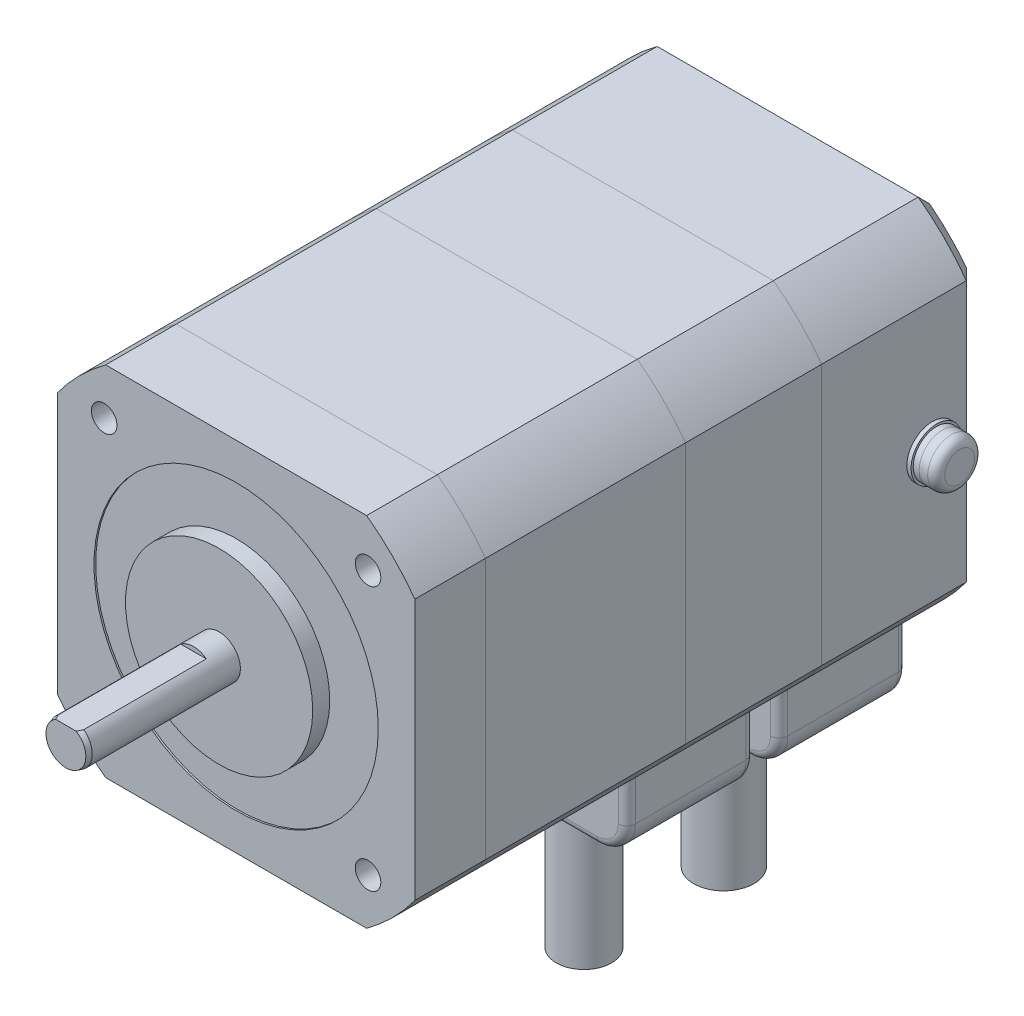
ISO-10303-21;
HEADER;
FILE_DESCRIPTION(('STEP AP214'),'2;1');
FILE_NAME('part.step','',(''),(''),'','','');
FILE_SCHEMA(('AUTOMOTIVE_DESIGN { 1 0 10303 214 1 1 1 1 }'));
ENDSEC;
DATA;
#1=APPLICATION_CONTEXT('core data for automotive mechanical design processes');
#2=APPLICATION_PROTOCOL_DEFINITION('international standard','automotive_design',2000,#1);
#3=PRODUCT_CONTEXT('',#1,'mechanical');
#4=PRODUCT('Part','Part','',(#3));
#5=PRODUCT_RELATED_PRODUCT_CATEGORY('part','',(#4));
#6=PRODUCT_DEFINITION_FORMATION('','',#4);
#7=PRODUCT_DEFINITION_CONTEXT('part definition',#1,'design');
#8=PRODUCT_DEFINITION('design','',#6,#7);
#9=PRODUCT_DEFINITION_SHAPE('','',#8);
#10=(LENGTH_UNIT() NAMED_UNIT(*) SI_UNIT(.MILLI.,.METRE.));
#11=(NAMED_UNIT(*) PLANE_ANGLE_UNIT() SI_UNIT($,.RADIAN.));
#12=(NAMED_UNIT(*) SI_UNIT($,.STERADIAN.) SOLID_ANGLE_UNIT());
#13=UNCERTAINTY_MEASURE_WITH_UNIT(LENGTH_MEASURE(1.E-05),#10,'distance_accuracy_value','');
#14=(GEOMETRIC_REPRESENTATION_CONTEXT(3) GLOBAL_UNCERTAINTY_ASSIGNED_CONTEXT((#13)) GLOBAL_UNIT_ASSIGNED_CONTEXT((#10,
#11,#12)) REPRESENTATION_CONTEXT('',''));
#15=CARTESIAN_POINT('',(0.,0.,0.));
#16=DIRECTION('',(0.,0.,1.));
#17=DIRECTION('',(1.,0.,0.));
#18=AXIS2_PLACEMENT_3D('',#15,#16,#17);
#19=CARTESIAN_POINT('',(0.,0.,-0.2));
#20=DIRECTION('',(0.,0.,1.));
#21=DIRECTION('',(1.,0.,0.));
#22=AXIS2_PLACEMENT_3D('',#19,#20,#21);
#23=CYLINDRICAL_SURFACE('',#22,16.7);
#24=CARTESIAN_POINT('',(0.,0.,-0.2));
#25=DIRECTION('',(0.,0.,1.));
#26=DIRECTION('',(1.,0.,0.));
#27=AXIS2_PLACEMENT_3D('',#24,#25,#26);
#28=CIRCLE('',#27,16.7);
#29=CARTESIAN_POINT('',(16.7,0.,-0.2));
#30=VERTEX_POINT('',#29);
#31=EDGE_CURVE('E54',#30,#30,#28,.T.);
#32=ORIENTED_EDGE('',*,*,#31,.F.);
#33=EDGE_LOOP('',(#32));
#34=FACE_BOUND('',#33,.T.);
#35=CARTESIAN_POINT('',(0.,0.,0.));
#36=DIRECTION('',(0.,0.,1.));
#37=DIRECTION('',(1.,0.,0.));
#38=AXIS2_PLACEMENT_3D('',#35,#36,#37);
#39=CIRCLE('',#38,16.7);
#40=CARTESIAN_POINT('',(16.7,0.,0.));
#41=VERTEX_POINT('',#40);
#42=EDGE_CURVE('E175',#41,#41,#39,.T.);
#43=ORIENTED_EDGE('',*,*,#42,.T.);
#44=EDGE_LOOP('',(#43));
#45=FACE_BOUND('',#44,.T.);
#46=ADVANCED_FACE('F50',(#34,#45),#23,.F.);
#47=CARTESIAN_POINT('',(0.,0.,-0.2));
#48=DIRECTION('',(0.,0.,1.));
#49=DIRECTION('',(1.,0.,0.));
#50=AXIS2_PLACEMENT_3D('',#47,#48,#49);
#51=PLANE('',#50);
#52=ORIENTED_EDGE('',*,*,#31,.T.);
#53=EDGE_LOOP('',(#52));
#54=FACE_BOUND('',#53,.T.);
#55=ADVANCED_FACE('F52',(#54),#51,.T.);
#56=CARTESIAN_POINT('',(0.,-57.3414213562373,-8.3));
#57=DIRECTION('',(0.,0.,1.));
#58=DIRECTION('',(1.,0.,0.));
#59=AXIS2_PLACEMENT_3D('',#56,#57,#58);
#60=PLANE('',#59);
#61=DIRECTION('',(0.,1.,0.));
#62=VECTOR('',#61,1.);
#63=CARTESIAN_POINT('',(21.,-57.3414213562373,-8.3));
#64=LINE('',#63,#62);
#65=CARTESIAN_POINT('',(21.,-15.3297097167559,-8.3));
#66=VERTEX_POINT('',#65);
#67=CARTESIAN_POINT('',(21.,15.3297097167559,-8.3));
#68=VERTEX_POINT('',#67);
#69=EDGE_CURVE('E125',#66,#68,#64,.T.);
#70=ORIENTED_EDGE('',*,*,#69,.F.);
#71=CARTESIAN_POINT('',(0.,0.,-8.3));
#72=DIRECTION('',(0.,0.,1.));
#73=DIRECTION('',(1.,0.,0.));
#74=AXIS2_PLACEMENT_3D('',#71,#72,#73);
#75=CIRCLE('',#74,26.);
#76=CARTESIAN_POINT('',(15.3297097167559,-21.,-8.3));
#77=VERTEX_POINT('',#76);
#78=EDGE_CURVE('E130',#77,#66,#75,.T.);
#79=ORIENTED_EDGE('',*,*,#78,.F.);
#80=DIRECTION('',(1.,0.,0.));
#81=VECTOR('',#80,1.);
#82=CARTESIAN_POINT('',(0.,-21.,-8.3));
#83=LINE('',#82,#81);
#84=CARTESIAN_POINT('',(-15.3297097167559,-21.,-8.3));
#85=VERTEX_POINT('',#84);
#86=EDGE_CURVE('E153',#85,#77,#83,.T.);
#87=ORIENTED_EDGE('',*,*,#86,.F.);
#88=CARTESIAN_POINT('',(-21.,-15.3297097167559,-8.3));
#89=VERTEX_POINT('',#88);
#90=EDGE_CURVE('E136',#89,#85,#75,.T.);
#91=ORIENTED_EDGE('',*,*,#90,.F.);
#92=DIRECTION('',(0.,1.,0.));
#93=VECTOR('',#92,1.);
#94=CARTESIAN_POINT('',(-21.,-57.3414213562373,-8.3));
#95=LINE('',#94,#93);
#96=CARTESIAN_POINT('',(-21.,15.3297097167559,-8.3));
#97=VERTEX_POINT('',#96);
#98=EDGE_CURVE('E115',#89,#97,#95,.T.);
#99=ORIENTED_EDGE('',*,*,#98,.T.);
#100=CARTESIAN_POINT('',(-15.3297097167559,21.,-8.3));
#101=VERTEX_POINT('',#100);
#102=EDGE_CURVE('E111',#101,#97,#75,.T.);
#103=ORIENTED_EDGE('',*,*,#102,.F.);
#104=DIRECTION('',(1.,0.,0.));
#105=VECTOR('',#104,1.);
#106=CARTESIAN_POINT('',(0.,21.,-8.3));
#107=LINE('',#106,#105);
#108=CARTESIAN_POINT('',(15.3297097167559,21.,-8.3));
#109=VERTEX_POINT('',#108);
#110=EDGE_CURVE('E104',#101,#109,#107,.T.);
#111=ORIENTED_EDGE('',*,*,#110,.T.);
#112=EDGE_CURVE('E109',#68,#109,#75,.T.);
#113=ORIENTED_EDGE('',*,*,#112,.F.);
#114=EDGE_LOOP('',(#70,#79,#87,#91,#99,#103,#111,#113));
#115=FACE_BOUND('',#114,.T.);
#116=ADVANCED_FACE('F107',(#115),#60,.F.);
#117=CARTESIAN_POINT('',(15.5,15.5,-4.5));
#118=DIRECTION('',(0.,0.,1.));
#119=DIRECTION('',(1.,0.,0.));
#120=AXIS2_PLACEMENT_3D('',#117,#118,#119);
#121=PLANE('',#120);
#122=CARTESIAN_POINT('',(15.5,15.5,-4.5));
#123=DIRECTION('',(0.,0.,1.));
#124=DIRECTION('',(1.,0.,0.));
#125=AXIS2_PLACEMENT_3D('',#122,#123,#124);
#126=CIRCLE('',#125,1.5);
#127=CARTESIAN_POINT('',(17.,15.5,-4.5));
#128=VERTEX_POINT('',#127);
#129=EDGE_CURVE('E114',#128,#128,#126,.T.);
#130=ORIENTED_EDGE('',*,*,#129,.T.);
#131=EDGE_LOOP('',(#130));
#132=FACE_BOUND('',#131,.T.);
#133=ADVANCED_FACE('F262',(#132),#121,.T.);
#134=CARTESIAN_POINT('',(15.4999999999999,-15.5000000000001,-4.5));
#135=DIRECTION('',(0.,0.,1.));
#136=DIRECTION('',(1.,0.,0.));
#137=AXIS2_PLACEMENT_3D('',#134,#135,#136);
#138=PLANE('',#137);
#139=CARTESIAN_POINT('',(15.4999999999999,-15.5000000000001,-4.5));
#140=DIRECTION('',(0.,0.,1.));
#141=DIRECTION('',(1.,0.,0.));
#142=AXIS2_PLACEMENT_3D('',#139,#140,#141);
#143=CIRCLE('',#142,1.5);
#144=CARTESIAN_POINT('',(16.9999999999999,-15.5000000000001,-4.5));
#145=VERTEX_POINT('',#144);
#146=EDGE_CURVE('E190',#145,#145,#143,.T.);
#147=ORIENTED_EDGE('',*,*,#146,.T.);
#148=EDGE_LOOP('',(#147));
#149=FACE_BOUND('',#148,.T.);
#150=ADVANCED_FACE('F254',(#149),#138,.T.);
#151=CARTESIAN_POINT('',(-15.5000000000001,-15.4999999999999,-4.5));
#152=DIRECTION('',(0.,0.,1.));
#153=DIRECTION('',(1.,0.,0.));
#154=AXIS2_PLACEMENT_3D('',#151,#152,#153);
#155=PLANE('',#154);
#156=CARTESIAN_POINT('',(-15.5000000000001,-15.4999999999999,-4.5));
#157=DIRECTION('',(0.,0.,1.));
#158=DIRECTION('',(1.,0.,0.));
#159=AXIS2_PLACEMENT_3D('',#156,#157,#158);
#160=CIRCLE('',#159,1.5);
#161=CARTESIAN_POINT('',(-14.0000000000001,-15.4999999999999,-4.5));
#162=VERTEX_POINT('',#161);
#163=EDGE_CURVE('E184',#162,#162,#160,.T.);
#164=ORIENTED_EDGE('',*,*,#163,.T.);
#165=EDGE_LOOP('',(#164));
#166=FACE_BOUND('',#165,.T.);
#167=ADVANCED_FACE('F245',(#166),#155,.T.);
#168=CARTESIAN_POINT('',(-15.4999999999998,15.5000000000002,-4.5));
#169=DIRECTION('',(0.,0.,1.));
#170=DIRECTION('',(1.,0.,0.));
#171=AXIS2_PLACEMENT_3D('',#168,#169,#170);
#172=PLANE('',#171);
#173=CARTESIAN_POINT('',(-15.4999999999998,15.5000000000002,-4.5));
#174=DIRECTION('',(0.,0.,1.));
#175=DIRECTION('',(1.,0.,0.));
#176=AXIS2_PLACEMENT_3D('',#173,#174,#175);
#177=CIRCLE('',#176,1.5);
#178=CARTESIAN_POINT('',(-13.9999999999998,15.5000000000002,-4.5));
#179=VERTEX_POINT('',#178);
#180=EDGE_CURVE('E135',#179,#179,#177,.T.);
#181=ORIENTED_EDGE('',*,*,#180,.T.);
#182=EDGE_LOOP('',(#181));
#183=FACE_BOUND('',#182,.T.);
#184=ADVANCED_FACE('F242',(#183),#172,.T.);
#185=CARTESIAN_POINT('',(0.,0.,-8.3));
#186=DIRECTION('',(0.,0.,1.));
#187=DIRECTION('',(1.,0.,0.));
#188=AXIS2_PLACEMENT_3D('',#185,#186,#187);
#189=CYLINDRICAL_SURFACE('',#188,26.);
#190=CARTESIAN_POINT('',(0.,0.,0.));
#191=DIRECTION('',(0.,0.,1.));
#192=DIRECTION('',(1.,0.,0.));
#193=AXIS2_PLACEMENT_3D('',#190,#191,#192);
#194=CIRCLE('',#193,26.);
#195=CARTESIAN_POINT('',(15.3297097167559,-21.,0.));
#196=VERTEX_POINT('',#195);
#197=CARTESIAN_POINT('',(21.,-15.3297097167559,0.));
#198=VERTEX_POINT('',#197);
#199=EDGE_CURVE('E12',#196,#198,#194,.T.);
#200=ORIENTED_EDGE('',*,*,#199,.F.);
#201=DIRECTION('',(0.,0.,1.));
#202=VECTOR('',#201,1.);
#203=CARTESIAN_POINT('',(15.3297097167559,-21.,-8.3));
#204=LINE('',#203,#202);
#205=EDGE_CURVE('E147',#77,#196,#204,.T.);
#206=ORIENTED_EDGE('',*,*,#205,.F.);
#207=ORIENTED_EDGE('',*,*,#78,.T.);
#208=DIRECTION('',(0.,0.,1.));
#209=VECTOR('',#208,1.);
#210=CARTESIAN_POINT('',(21.,-15.3297097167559,-8.3));
#211=LINE('',#210,#209);
#212=EDGE_CURVE('E134',#66,#198,#211,.T.);
#213=ORIENTED_EDGE('',*,*,#212,.T.);
#214=EDGE_LOOP('',(#200,#206,#207,#213));
#215=FACE_BOUND('',#214,.T.);
#216=ADVANCED_FACE('F209',(#215),#189,.T.);
#217=CARTESIAN_POINT('',(0.,-21.,-8.3));
#218=DIRECTION('',(0.,-1.,0.));
#219=DIRECTION('',(0.,0.,-1.));
#220=AXIS2_PLACEMENT_3D('',#217,#218,#219);
#221=PLANE('',#220);
#222=DIRECTION('',(1.,0.,0.));
#223=VECTOR('',#222,1.);
#224=CARTESIAN_POINT('',(0.,-21.,0.));
#225=LINE('',#224,#223);
#226=CARTESIAN_POINT('',(-15.3297097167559,-21.,0.));
#227=VERTEX_POINT('',#226);
#228=EDGE_CURVE('E60',#227,#196,#225,.T.);
#229=ORIENTED_EDGE('',*,*,#228,.F.);
#230=DIRECTION('',(0.,0.,1.));
#231=VECTOR('',#230,1.);
#232=CARTESIAN_POINT('',(-15.3297097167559,-21.,-8.3));
#233=LINE('',#232,#231);
#234=EDGE_CURVE('E146',#85,#227,#233,.T.);
#235=ORIENTED_EDGE('',*,*,#234,.F.);
#236=ORIENTED_EDGE('',*,*,#86,.T.);
#237=ORIENTED_EDGE('',*,*,#205,.T.);
#238=EDGE_LOOP('',(#229,#235,#236,#237));
#239=FACE_BOUND('',#238,.T.);
#240=ADVANCED_FACE('F210',(#239),#221,.T.);
#241=CARTESIAN_POINT('',(-21.,-15.3297097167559,0.));
#242=VERTEX_POINT('',#241);
#243=EDGE_CURVE('E62',#242,#227,#194,.T.);
#244=ORIENTED_EDGE('',*,*,#243,.F.);
#245=DIRECTION('',(0.,0.,1.));
#246=VECTOR('',#245,1.);
#247=CARTESIAN_POINT('',(-21.,-15.3297097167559,-8.3));
#248=LINE('',#247,#246);
#249=EDGE_CURVE('E138',#89,#242,#248,.T.);
#250=ORIENTED_EDGE('',*,*,#249,.F.);
#251=ORIENTED_EDGE('',*,*,#90,.T.);
#252=ORIENTED_EDGE('',*,*,#234,.T.);
#253=EDGE_LOOP('',(#244,#250,#251,#252));
#254=FACE_BOUND('',#253,.T.);
#255=ADVANCED_FACE('F213',(#254),#189,.T.);
#256=CARTESIAN_POINT('',(-21.,-57.3414213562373,-8.3));
#257=DIRECTION('',(1.,0.,0.));
#258=DIRECTION('',(0.,0.,-1.));
#259=AXIS2_PLACEMENT_3D('',#256,#257,#258);
#260=PLANE('',#259);
#261=DIRECTION('',(0.,1.,0.));
#262=VECTOR('',#261,1.);
#263=CARTESIAN_POINT('',(-21.,-57.3414213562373,0.));
#264=LINE('',#263,#262);
#265=CARTESIAN_POINT('',(-21.,15.3297097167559,0.));
#266=VERTEX_POINT('',#265);
#267=EDGE_CURVE('E143',#242,#266,#264,.T.);
#268=ORIENTED_EDGE('',*,*,#267,.T.);
#269=DIRECTION('',(0.,0.,1.));
#270=VECTOR('',#269,1.);
#271=CARTESIAN_POINT('',(-21.,15.3297097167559,-8.3));
#272=LINE('',#271,#270);
#273=EDGE_CURVE('E137',#97,#266,#272,.T.);
#274=ORIENTED_EDGE('',*,*,#273,.F.);
#275=ORIENTED_EDGE('',*,*,#98,.F.);
#276=ORIENTED_EDGE('',*,*,#249,.T.);
#277=EDGE_LOOP('',(#268,#274,#275,#276));
#278=FACE_BOUND('',#277,.T.);
#279=ADVANCED_FACE('F226',(#278),#260,.F.);
#280=CARTESIAN_POINT('',(-15.3297097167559,21.,0.));
#281=VERTEX_POINT('',#280);
#282=EDGE_CURVE('E167',#281,#266,#194,.T.);
#283=ORIENTED_EDGE('',*,*,#282,.F.);
#284=DIRECTION('',(0.,0.,1.));
#285=VECTOR('',#284,1.);
#286=CARTESIAN_POINT('',(-15.3297097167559,21.,-8.3));
#287=LINE('',#286,#285);
#288=EDGE_CURVE('E128',#101,#281,#287,.T.);
#289=ORIENTED_EDGE('',*,*,#288,.F.);
#290=ORIENTED_EDGE('',*,*,#102,.T.);
#291=ORIENTED_EDGE('',*,*,#273,.T.);
#292=EDGE_LOOP('',(#283,#289,#290,#291));
#293=FACE_BOUND('',#292,.T.);
#294=ADVANCED_FACE('F224',(#293),#189,.T.);
#295=CARTESIAN_POINT('',(0.,21.,-8.3));
#296=DIRECTION('',(0.,-1.,0.));
#297=DIRECTION('',(0.,0.,-1.));
#298=AXIS2_PLACEMENT_3D('',#295,#296,#297);
#299=PLANE('',#298);
#300=DIRECTION('',(1.,0.,0.));
#301=VECTOR('',#300,1.);
#302=CARTESIAN_POINT('',(0.,21.,0.));
#303=LINE('',#302,#301);
#304=CARTESIAN_POINT('',(15.3297097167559,21.,0.));
#305=VERTEX_POINT('',#304);
#306=EDGE_CURVE('E122',#281,#305,#303,.T.);
#307=ORIENTED_EDGE('',*,*,#306,.T.);
#308=DIRECTION('',(0.,0.,1.));
#309=VECTOR('',#308,1.);
#310=CARTESIAN_POINT('',(15.3297097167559,21.,-8.3));
#311=LINE('',#310,#309);
#312=EDGE_CURVE('E119',#109,#305,#311,.T.);
#313=ORIENTED_EDGE('',*,*,#312,.F.);
#314=ORIENTED_EDGE('',*,*,#110,.F.);
#315=ORIENTED_EDGE('',*,*,#288,.T.);
#316=EDGE_LOOP('',(#307,#313,#314,#315));
#317=FACE_BOUND('',#316,.T.);
#318=ADVANCED_FACE('F120',(#317),#299,.F.);
#319=CARTESIAN_POINT('',(21.,15.3297097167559,0.));
#320=VERTEX_POINT('',#319);
#321=EDGE_CURVE('E63',#320,#305,#194,.T.);
#322=ORIENTED_EDGE('',*,*,#321,.F.);
#323=DIRECTION('',(0.,0.,1.));
#324=VECTOR('',#323,1.);
#325=CARTESIAN_POINT('',(21.,15.3297097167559,-8.3));
#326=LINE('',#325,#324);
#327=EDGE_CURVE('E71',#68,#320,#326,.T.);
#328=ORIENTED_EDGE('',*,*,#327,.F.);
#329=ORIENTED_EDGE('',*,*,#112,.T.);
#330=ORIENTED_EDGE('',*,*,#312,.T.);
#331=EDGE_LOOP('',(#322,#328,#329,#330));
#332=FACE_BOUND('',#331,.T.);
#333=ADVANCED_FACE('F127',(#332),#189,.T.);
#334=CARTESIAN_POINT('',(21.,-57.3414213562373,-8.3));
#335=DIRECTION('',(1.,0.,0.));
#336=DIRECTION('',(0.,0.,-1.));
#337=AXIS2_PLACEMENT_3D('',#334,#335,#336);
#338=PLANE('',#337);
#339=DIRECTION('',(0.,1.,0.));
#340=VECTOR('',#339,1.);
#341=CARTESIAN_POINT('',(21.,-57.3414213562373,0.));
#342=LINE('',#341,#340);
#343=EDGE_CURVE('E168',#198,#320,#342,.T.);
#344=ORIENTED_EDGE('',*,*,#343,.F.);
#345=ORIENTED_EDGE('',*,*,#212,.F.);
#346=ORIENTED_EDGE('',*,*,#69,.T.);
#347=ORIENTED_EDGE('',*,*,#327,.T.);
#348=EDGE_LOOP('',(#344,#345,#346,#347));
#349=FACE_BOUND('',#348,.T.);
#350=ADVANCED_FACE('F203',(#349),#338,.T.);
#351=CARTESIAN_POINT('',(15.5,15.5,-4.5));
#352=DIRECTION('',(0.,0.,1.));
#353=DIRECTION('',(1.,0.,0.));
#354=AXIS2_PLACEMENT_3D('',#351,#352,#353);
#355=CYLINDRICAL_SURFACE('',#354,1.5);
#356=ORIENTED_EDGE('',*,*,#129,.F.);
#357=EDGE_LOOP('',(#356));
#358=FACE_BOUND('',#357,.T.);
#359=CARTESIAN_POINT('',(15.5,15.5,0.));
#360=DIRECTION('',(0.,0.,1.));
#361=DIRECTION('',(1.,0.,0.));
#362=AXIS2_PLACEMENT_3D('',#359,#360,#361);
#363=CIRCLE('',#362,1.5);
#364=CARTESIAN_POINT('',(17.,15.5,0.));
#365=VERTEX_POINT('',#364);
#366=EDGE_CURVE('E198',#365,#365,#363,.T.);
#367=ORIENTED_EDGE('',*,*,#366,.T.);
#368=EDGE_LOOP('',(#367));
#369=FACE_BOUND('',#368,.T.);
#370=ADVANCED_FACE('F266',(#358,#369),#355,.F.);
#371=CARTESIAN_POINT('',(15.4999999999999,-15.5000000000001,-4.5));
#372=DIRECTION('',(0.,0.,1.));
#373=DIRECTION('',(1.,0.,0.));
#374=AXIS2_PLACEMENT_3D('',#371,#372,#373);
#375=CYLINDRICAL_SURFACE('',#374,1.5);
#376=ORIENTED_EDGE('',*,*,#146,.F.);
#377=EDGE_LOOP('',(#376));
#378=FACE_BOUND('',#377,.T.);
#379=CARTESIAN_POINT('',(15.4999999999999,-15.5000000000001,0.));
#380=DIRECTION('',(0.,0.,1.));
#381=DIRECTION('',(1.,0.,0.));
#382=AXIS2_PLACEMENT_3D('',#379,#380,#381);
#383=CIRCLE('',#382,1.5);
#384=CARTESIAN_POINT('',(16.9999999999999,-15.5000000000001,0.));
#385=VERTEX_POINT('',#384);
#386=EDGE_CURVE('E193',#385,#385,#383,.T.);
#387=ORIENTED_EDGE('',*,*,#386,.T.);
#388=EDGE_LOOP('',(#387));
#389=FACE_BOUND('',#388,.T.);
#390=ADVANCED_FACE('F258',(#378,#389),#375,.F.);
#391=CARTESIAN_POINT('',(-15.5000000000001,-15.4999999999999,-4.5));
#392=DIRECTION('',(0.,0.,1.));
#393=DIRECTION('',(1.,0.,0.));
#394=AXIS2_PLACEMENT_3D('',#391,#392,#393);
#395=CYLINDRICAL_SURFACE('',#394,1.5);
#396=ORIENTED_EDGE('',*,*,#163,.F.);
#397=EDGE_LOOP('',(#396));
#398=FACE_BOUND('',#397,.T.);
#399=CARTESIAN_POINT('',(-15.5000000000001,-15.4999999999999,0.));
#400=DIRECTION('',(0.,0.,1.));
#401=DIRECTION('',(1.,0.,0.));
#402=AXIS2_PLACEMENT_3D('',#399,#400,#401);
#403=CIRCLE('',#402,1.5);
#404=CARTESIAN_POINT('',(-14.0000000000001,-15.4999999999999,0.));
#405=VERTEX_POINT('',#404);
#406=EDGE_CURVE('E187',#405,#405,#403,.T.);
#407=ORIENTED_EDGE('',*,*,#406,.T.);
#408=EDGE_LOOP('',(#407));
#409=FACE_BOUND('',#408,.T.);
#410=ADVANCED_FACE('F250',(#398,#409),#395,.F.);
#411=CARTESIAN_POINT('',(-15.4999999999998,15.5000000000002,-4.5));
#412=DIRECTION('',(0.,0.,1.));
#413=DIRECTION('',(1.,0.,0.));
#414=AXIS2_PLACEMENT_3D('',#411,#412,#413);
#415=CYLINDRICAL_SURFACE('',#414,1.5);
#416=ORIENTED_EDGE('',*,*,#180,.F.);
#417=EDGE_LOOP('',(#416));
#418=FACE_BOUND('',#417,.T.);
#419=CARTESIAN_POINT('',(-15.4999999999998,15.5000000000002,0.));
#420=DIRECTION('',(0.,0.,1.));
#421=DIRECTION('',(1.,0.,0.));
#422=AXIS2_PLACEMENT_3D('',#419,#420,#421);
#423=CIRCLE('',#422,1.5);
#424=CARTESIAN_POINT('',(-13.9999999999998,15.5000000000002,0.));
#425=VERTEX_POINT('',#424);
#426=EDGE_CURVE('E170',#425,#425,#423,.T.);
#427=ORIENTED_EDGE('',*,*,#426,.T.);
#428=EDGE_LOOP('',(#427));
#429=FACE_BOUND('',#428,.T.);
#430=ADVANCED_FACE('F247',(#418,#429),#415,.F.);
#431=CARTESIAN_POINT('',(0.,-57.3414213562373,0.));
#432=DIRECTION('',(0.,0.,1.));
#433=DIRECTION('',(1.,0.,0.));
#434=AXIS2_PLACEMENT_3D('',#431,#432,#433);
#435=PLANE('',#434);
#436=ORIENTED_EDGE('',*,*,#42,.F.);
#437=EDGE_LOOP('',(#436));
#438=FACE_BOUND('',#437,.T.);
#439=ORIENTED_EDGE('',*,*,#426,.F.);
#440=EDGE_LOOP('',(#439));
#441=FACE_BOUND('',#440,.T.);
#442=ORIENTED_EDGE('',*,*,#406,.F.);
#443=EDGE_LOOP('',(#442));
#444=FACE_BOUND('',#443,.T.);
#445=ORIENTED_EDGE('',*,*,#386,.F.);
#446=EDGE_LOOP('',(#445));
#447=FACE_BOUND('',#446,.T.);
#448=ORIENTED_EDGE('',*,*,#366,.F.);
#449=EDGE_LOOP('',(#448));
#450=FACE_BOUND('',#449,.T.);
#451=ORIENTED_EDGE('',*,*,#343,.T.);
#452=ORIENTED_EDGE('',*,*,#321,.T.);
#453=ORIENTED_EDGE('',*,*,#306,.F.);
#454=ORIENTED_EDGE('',*,*,#282,.T.);
#455=ORIENTED_EDGE('',*,*,#267,.F.);
#456=ORIENTED_EDGE('',*,*,#243,.T.);
#457=ORIENTED_EDGE('',*,*,#228,.T.);
#458=ORIENTED_EDGE('',*,*,#199,.T.);
#459=EDGE_LOOP('',(#451,#452,#453,#454,#455,#456,#457,#458));
#460=FACE_BOUND('',#459,.T.);
#461=ADVANCED_FACE('F222',(#438,#441,#444,#447,#450,#460),#435,.T.);
#462=CLOSED_SHELL('',(#46,#55,#116,#133,#150,#167,#184,#216,#240,#255,#279,#294,#318,#333,#350,
#370,#390,#410,#430,#461));
#463=MANIFOLD_SOLID_BREP('B2',#462);
#464=CARTESIAN_POINT('',(0.,-51.,-40.87));
#465=DIRECTION('',(0.,1.,0.));
#466=DIRECTION('',(-1.,0.,0.));
#467=AXIS2_PLACEMENT_3D('',#464,#465,#466);
#468=CYLINDRICAL_SURFACE('',#467,3.25);
#469=CARTESIAN_POINT('',(0.,-51.,-40.87));
#470=DIRECTION('',(0.,-1.,0.));
#471=DIRECTION('',(1.,0.,0.));
#472=AXIS2_PLACEMENT_3D('',#469,#470,#471);
#473=CIRCLE('',#472,3.25);
#474=CARTESIAN_POINT('',(3.25000000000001,-51.,-40.87));
#475=VERTEX_POINT('',#474);
#476=EDGE_CURVE('E49',#475,#475,#473,.T.);
#477=ORIENTED_EDGE('',*,*,#476,.F.);
#478=EDGE_LOOP('',(#477));
#479=FACE_BOUND('',#478,.T.);
#480=CARTESIAN_POINT('',(0.,-31.,-40.87));
#481=DIRECTION('',(0.,-1.,0.));
#482=DIRECTION('',(1.,0.,0.));
#483=AXIS2_PLACEMENT_3D('',#480,#481,#482);
#484=CIRCLE('',#483,3.25);
#485=CARTESIAN_POINT('',(3.25000000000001,-31.,-40.87));
#486=VERTEX_POINT('',#485);
#487=EDGE_CURVE('E440',#486,#486,#484,.T.);
#488=ORIENTED_EDGE('',*,*,#487,.T.);
#489=EDGE_LOOP('',(#488));
#490=FACE_BOUND('',#489,.T.);
#491=ADVANCED_FACE('F437',(#479,#490),#468,.T.);
#492=CARTESIAN_POINT('',(0.,-51.,-40.87));
#493=DIRECTION('',(0.,-1.,0.));
#494=DIRECTION('',(1.,0.,0.));
#495=AXIS2_PLACEMENT_3D('',#492,#493,#494);
#496=PLANE('',#495);
#497=ORIENTED_EDGE('',*,*,#476,.T.);
#498=EDGE_LOOP('',(#497));
#499=FACE_BOUND('',#498,.T.);
#500=ADVANCED_FACE('F452',(#499),#496,.T.);
#501=CARTESIAN_POINT('',(0.,-31.,-40.87));
#502=DIRECTION('',(0.,-1.,0.));
#503=DIRECTION('',(1.,0.,0.));
#504=AXIS2_PLACEMENT_3D('',#501,#502,#503);
#505=PLANE('',#504);
#506=ORIENTED_EDGE('',*,*,#487,.F.);
#507=EDGE_LOOP('',(#506));
#508=FACE_BOUND('',#507,.T.);
#509=ADVANCED_FACE('F450',(#508),#505,.F.);
#510=CLOSED_SHELL('',(#491,#500,#509));
#511=MANIFOLD_SOLID_BREP('B6',#510);
#512=CARTESIAN_POINT('',(0.,-51.,-57.3));
#513=DIRECTION('',(0.,1.,0.));
#514=DIRECTION('',(0.,0.,1.));
#515=AXIS2_PLACEMENT_3D('',#512,#513,#514);
#516=CYLINDRICAL_SURFACE('',#515,3.55);
#517=CARTESIAN_POINT('',(0.,-51.,-57.3));
#518=DIRECTION('',(0.,-1.,0.));
#519=DIRECTION('',(0.,0.,-1.));
#520=AXIS2_PLACEMENT_3D('',#517,#518,#519);
#521=CIRCLE('',#520,3.55);
#522=CARTESIAN_POINT('',(0.,-51.,-60.85));
#523=VERTEX_POINT('',#522);
#524=EDGE_CURVE('E436',#523,#523,#521,.T.);
#525=ORIENTED_EDGE('',*,*,#524,.F.);
#526=EDGE_LOOP('',(#525));
#527=FACE_BOUND('',#526,.T.);
#528=CARTESIAN_POINT('',(0.,-31.,-57.3));
#529=DIRECTION('',(0.,-1.,0.));
#530=DIRECTION('',(0.,0.,-1.));
#531=AXIS2_PLACEMENT_3D('',#528,#529,#530);
#532=CIRCLE('',#531,3.55);
#533=CARTESIAN_POINT('',(0.,-31.,-60.85));
#534=VERTEX_POINT('',#533);
#535=EDGE_CURVE('E489',#534,#534,#532,.T.);
#536=ORIENTED_EDGE('',*,*,#535,.T.);
#537=EDGE_LOOP('',(#536));
#538=FACE_BOUND('',#537,.T.);
#539=ADVANCED_FACE('F486',(#527,#538),#516,.T.);
#540=CARTESIAN_POINT('',(0.,-51.,-57.3));
#541=DIRECTION('',(0.,-1.,0.));
#542=DIRECTION('',(0.,0.,-1.));
#543=AXIS2_PLACEMENT_3D('',#540,#541,#542);
#544=PLANE('',#543);
#545=ORIENTED_EDGE('',*,*,#524,.T.);
#546=EDGE_LOOP('',(#545));
#547=FACE_BOUND('',#546,.T.);
#548=ADVANCED_FACE('F501',(#547),#544,.T.);
#549=CARTESIAN_POINT('',(0.,-31.,-57.3));
#550=DIRECTION('',(0.,-1.,0.));
#551=DIRECTION('',(0.,0.,-1.));
#552=AXIS2_PLACEMENT_3D('',#549,#550,#551);
#553=PLANE('',#552);
#554=ORIENTED_EDGE('',*,*,#535,.F.);
#555=EDGE_LOOP('',(#554));
#556=FACE_BOUND('',#555,.T.);
#557=ADVANCED_FACE('F499',(#556),#553,.F.);
#558=CLOSED_SHELL('',(#539,#548,#557));
#559=MANIFOLD_SOLID_BREP('B44',#558);
#560=CARTESIAN_POINT('',(24.2,0.,-60.8));
#561=DIRECTION('',(-1.,0.,0.));
#562=DIRECTION('',(0.,-1.,0.));
#563=AXIS2_PLACEMENT_3D('',#560,#561,#562);
#564=CYLINDRICAL_SURFACE('',#563,2.75);
#565=CARTESIAN_POINT('',(23.2,0.,-60.8));
#566=DIRECTION('',(1.,0.,0.));
#567=DIRECTION('',(0.,1.,0.));
#568=AXIS2_PLACEMENT_3D('',#565,#566,#567);
#569=CIRCLE('',#568,2.75);
#570=CARTESIAN_POINT('',(23.2,2.75000000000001,-60.8));
#571=VERTEX_POINT('',#570);
#572=EDGE_CURVE('E485',#571,#571,#569,.F.);
#573=ORIENTED_EDGE('',*,*,#572,.T.);
#574=EDGE_LOOP('',(#573));
#575=FACE_BOUND('',#574,.T.);
#576=CARTESIAN_POINT('',(22.2,0.,-60.8));
#577=DIRECTION('',(1.,0.,0.));
#578=DIRECTION('',(0.,1.,0.));
#579=AXIS2_PLACEMENT_3D('',#576,#577,#578);
#580=CIRCLE('',#579,2.75);
#581=CARTESIAN_POINT('',(22.2,2.75000000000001,-60.8));
#582=VERTEX_POINT('',#581);
#583=EDGE_CURVE('E546',#582,#582,#580,.T.);
#584=ORIENTED_EDGE('',*,*,#583,.T.);
#585=EDGE_LOOP('',(#584));
#586=FACE_BOUND('',#585,.T.);
#587=ADVANCED_FACE('F535',(#575,#586),#564,.T.);
#588=CARTESIAN_POINT('',(24.2,0.,-60.8));
#589=DIRECTION('',(1.,0.,0.));
#590=DIRECTION('',(0.,1.,0.));
#591=AXIS2_PLACEMENT_3D('',#588,#589,#590);
#592=PLANE('',#591);
#593=CARTESIAN_POINT('',(24.2,0.,-60.8));
#594=DIRECTION('',(1.,0.,0.));
#595=DIRECTION('',(0.,1.,0.));
#596=AXIS2_PLACEMENT_3D('',#593,#594,#595);
#597=CIRCLE('',#596,1.75);
#598=CARTESIAN_POINT('',(24.2,1.75000000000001,-60.8));
#599=VERTEX_POINT('',#598);
#600=EDGE_CURVE('E542',#599,#599,#597,.T.);
#601=ORIENTED_EDGE('',*,*,#600,.T.);
#602=EDGE_LOOP('',(#601));
#603=FACE_BOUND('',#602,.T.);
#604=ADVANCED_FACE('F556',(#603),#592,.T.);
#605=CARTESIAN_POINT('',(22.2,0.,-60.8));
#606=DIRECTION('',(1.,0.,0.));
#607=DIRECTION('',(0.,1.,0.));
#608=AXIS2_PLACEMENT_3D('',#605,#606,#607);
#609=PLANE('',#608);
#610=ORIENTED_EDGE('',*,*,#583,.F.);
#611=EDGE_LOOP('',(#610));
#612=FACE_BOUND('',#611,.T.);
#613=ADVANCED_FACE('F554',(#612),#609,.F.);
#614=CARTESIAN_POINT('',(23.2,0.,-60.8));
#615=DIRECTION('',(1.,0.,0.));
#616=DIRECTION('',(0.,1.,0.));
#617=AXIS2_PLACEMENT_3D('',#614,#615,#616);
#618=TOROIDAL_SURFACE('',#617,1.75,1.);
#619=ORIENTED_EDGE('',*,*,#572,.F.);
#620=EDGE_LOOP('',(#619));
#621=FACE_BOUND('',#620,.T.);
#622=ORIENTED_EDGE('',*,*,#600,.F.);
#623=EDGE_LOOP('',(#622));
#624=FACE_BOUND('',#623,.T.);
#625=ADVANCED_FACE('F537',(#621,#624),#618,.T.);
#626=CLOSED_SHELL('',(#587,#604,#613,#625));
#627=MANIFOLD_SOLID_BREP('B431',#626);
#628=CARTESIAN_POINT('',(22.2,0.,-60.8));
#629=DIRECTION('',(-1.,0.,0.));
#630=DIRECTION('',(0.,-1.,0.));
#631=AXIS2_PLACEMENT_3D('',#628,#629,#630);
#632=CYLINDRICAL_SURFACE('',#631,2.75);
#633=CARTESIAN_POINT('',(22.2,0.,-60.8));
#634=DIRECTION('',(1.,0.,0.));
#635=DIRECTION('',(0.,1.,0.));
#636=AXIS2_PLACEMENT_3D('',#633,#634,#635);
#637=CIRCLE('',#636,2.75);
#638=CARTESIAN_POINT('',(22.2,2.75000000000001,-60.8));
#639=VERTEX_POINT('',#638);
#640=EDGE_CURVE('E534',#639,#639,#637,.T.);
#641=ORIENTED_EDGE('',*,*,#640,.F.);
#642=EDGE_LOOP('',(#641));
#643=FACE_BOUND('',#642,.T.);
#644=CARTESIAN_POINT('',(21.5,0.,-60.8));
#645=DIRECTION('',(1.,0.,0.));
#646=DIRECTION('',(0.,1.,0.));
#647=AXIS2_PLACEMENT_3D('',#644,#645,#646);
#648=CIRCLE('',#647,2.75);
#649=CARTESIAN_POINT('',(21.5,2.75000000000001,-60.8));
#650=VERTEX_POINT('',#649);
#651=EDGE_CURVE('E602',#650,#650,#648,.T.);
#652=ORIENTED_EDGE('',*,*,#651,.T.);
#653=EDGE_LOOP('',(#652));
#654=FACE_BOUND('',#653,.T.);
#655=ADVANCED_FACE('F599',(#643,#654),#632,.T.);
#656=CARTESIAN_POINT('',(22.2,0.,-60.8));
#657=DIRECTION('',(1.,0.,0.));
#658=DIRECTION('',(0.,1.,0.));
#659=AXIS2_PLACEMENT_3D('',#656,#657,#658);
#660=PLANE('',#659);
#661=ORIENTED_EDGE('',*,*,#640,.T.);
#662=EDGE_LOOP('',(#661));
#663=FACE_BOUND('',#662,.T.);
#664=ADVANCED_FACE('F614',(#663),#660,.T.);
#665=CARTESIAN_POINT('',(21.5,0.,-60.8));
#666=DIRECTION('',(1.,0.,0.));
#667=DIRECTION('',(0.,1.,0.));
#668=AXIS2_PLACEMENT_3D('',#665,#666,#667);
#669=PLANE('',#668);
#670=ORIENTED_EDGE('',*,*,#651,.F.);
#671=EDGE_LOOP('',(#670));
#672=FACE_BOUND('',#671,.T.);
#673=ADVANCED_FACE('F612',(#672),#669,.F.);
#674=CLOSED_SHELL('',(#655,#664,#673));
#675=MANIFOLD_SOLID_BREP('B480',#674);
#676=CARTESIAN_POINT('',(21.5,0.,-60.8));
#677=DIRECTION('',(-1.,0.,0.));
#678=DIRECTION('',(0.,-1.,0.));
#679=AXIS2_PLACEMENT_3D('',#676,#677,#678);
#680=CYLINDRICAL_SURFACE('',#679,3.);
#681=CARTESIAN_POINT('',(21.5,0.,-60.8));
#682=DIRECTION('',(1.,0.,0.));
#683=DIRECTION('',(0.,1.,0.));
#684=AXIS2_PLACEMENT_3D('',#681,#682,#683);
#685=CIRCLE('',#684,3.);
#686=CARTESIAN_POINT('',(21.5,3.,-60.8));
#687=VERTEX_POINT('',#686);
#688=EDGE_CURVE('E598',#687,#687,#685,.T.);
#689=ORIENTED_EDGE('',*,*,#688,.F.);
#690=EDGE_LOOP('',(#689));
#691=FACE_BOUND('',#690,.T.);
#692=CARTESIAN_POINT('',(21.,0.,-60.8));
#693=DIRECTION('',(1.,0.,0.));
#694=DIRECTION('',(0.,1.,0.));
#695=AXIS2_PLACEMENT_3D('',#692,#693,#694);
#696=CIRCLE('',#695,3.);
#697=CARTESIAN_POINT('',(21.,3.,-60.8));
#698=VERTEX_POINT('',#697);
#699=EDGE_CURVE('E653',#698,#698,#696,.T.);
#700=ORIENTED_EDGE('',*,*,#699,.T.);
#701=EDGE_LOOP('',(#700));
#702=FACE_BOUND('',#701,.T.);
#703=ADVANCED_FACE('F650',(#691,#702),#680,.T.);
#704=CARTESIAN_POINT('',(21.5,0.,-60.8));
#705=DIRECTION('',(1.,0.,0.));
#706=DIRECTION('',(0.,1.,0.));
#707=AXIS2_PLACEMENT_3D('',#704,#705,#706);
#708=PLANE('',#707);
#709=ORIENTED_EDGE('',*,*,#688,.T.);
#710=EDGE_LOOP('',(#709));
#711=FACE_BOUND('',#710,.T.);
#712=ADVANCED_FACE('F665',(#711),#708,.T.);
#713=CARTESIAN_POINT('',(21.,0.,-60.8));
#714=DIRECTION('',(1.,0.,0.));
#715=DIRECTION('',(0.,1.,0.));
#716=AXIS2_PLACEMENT_3D('',#713,#714,#715);
#717=PLANE('',#716);
#718=ORIENTED_EDGE('',*,*,#699,.F.);
#719=EDGE_LOOP('',(#718));
#720=FACE_BOUND('',#719,.T.);
#721=ADVANCED_FACE('F663',(#720),#717,.F.);
#722=CLOSED_SHELL('',(#703,#712,#721));
#723=MANIFOLD_SOLID_BREP('B529',#722);
#724=CARTESIAN_POINT('',(-14.,-31.,-49.8));
#725=DIRECTION('',(1.,0.,0.));
#726=DIRECTION('',(0.,0.,-1.));
#727=AXIS2_PLACEMENT_3D('',#724,#725,#726);
#728=PLANE('',#727);
#729=DIRECTION('',(0.,0.,-1.));
#730=VECTOR('',#729,1.);
#731=CARTESIAN_POINT('',(-14.,-21.,-49.8));
#732=LINE('',#731,#730);
#733=CARTESIAN_POINT('',(-14.,-21.,-50.8));
#734=VERTEX_POINT('',#733);
#735=CARTESIAN_POINT('',(-14.,-21.,-63.8));
#736=VERTEX_POINT('',#735);
#737=EDGE_CURVE('E819',#734,#736,#732,.T.);
#738=ORIENTED_EDGE('',*,*,#737,.T.);
#739=DIRECTION('',(0.,1.,0.));
#740=VECTOR('',#739,1.);
#741=CARTESIAN_POINT('',(-14.,-31.,-63.8));
#742=LINE('',#741,#740);
#743=CARTESIAN_POINT('',(-14.,-27.5,-63.8));
#744=VERTEX_POINT('',#743);
#745=EDGE_CURVE('E797',#736,#744,#742,.F.);
#746=ORIENTED_EDGE('',*,*,#745,.T.);
#747=DIRECTION('',(0.,0.,-1.));
#748=VECTOR('',#747,1.);
#749=CARTESIAN_POINT('',(-14.,-27.5,-49.8));
#750=LINE('',#749,#748);
#751=CARTESIAN_POINT('',(-14.,-27.5,-50.8));
#752=VERTEX_POINT('',#751);
#753=EDGE_CURVE('E834',#744,#752,#750,.F.);
#754=ORIENTED_EDGE('',*,*,#753,.T.);
#755=DIRECTION('',(0.,1.,0.));
#756=VECTOR('',#755,1.);
#757=CARTESIAN_POINT('',(-14.,-31.,-50.8));
#758=LINE('',#757,#756);
#759=EDGE_CURVE('E802',#752,#734,#758,.T.);
#760=ORIENTED_EDGE('',*,*,#759,.T.);
#761=EDGE_LOOP('',(#738,#746,#754,#760));
#762=FACE_BOUND('',#761,.T.);
#763=ADVANCED_FACE('F701',(#762),#728,.F.);
#764=CARTESIAN_POINT('',(-14.,-31.,-64.8));
#765=DIRECTION('',(0.,0.,1.));
#766=DIRECTION('',(1.,0.,0.));
#767=AXIS2_PLACEMENT_3D('',#764,#765,#766);
#768=PLANE('',#767);
#769=CARTESIAN_POINT('',(-10.5,-27.5,-64.8));
#770=DIRECTION('',(0.,0.,1.));
#771=DIRECTION('',(1.,0.,0.));
#772=AXIS2_PLACEMENT_3D('',#769,#770,#771);
#773=CIRCLE('',#772,2.5);
#774=CARTESIAN_POINT('',(-10.5,-30.,-64.8));
#775=VERTEX_POINT('',#774);
#776=CARTESIAN_POINT('',(-13.,-27.5,-64.8));
#777=VERTEX_POINT('',#776);
#778=EDGE_CURVE('E811',#775,#777,#773,.F.);
#779=ORIENTED_EDGE('',*,*,#778,.T.);
#780=DIRECTION('',(0.,1.,0.));
#781=VECTOR('',#780,1.);
#782=CARTESIAN_POINT('',(-13.,-31.,-64.8));
#783=LINE('',#782,#781);
#784=CARTESIAN_POINT('',(-13.,-21.,-64.8));
#785=VERTEX_POINT('',#784);
#786=EDGE_CURVE('E796',#777,#785,#783,.T.);
#787=ORIENTED_EDGE('',*,*,#786,.T.);
#788=DIRECTION('',(1.,0.,0.));
#789=VECTOR('',#788,1.);
#790=CARTESIAN_POINT('',(-14.,-21.,-64.8));
#791=LINE('',#790,#789);
#792=CARTESIAN_POINT('',(13.,-21.,-64.8));
#793=VERTEX_POINT('',#792);
#794=EDGE_CURVE('E808',#785,#793,#791,.T.);
#795=ORIENTED_EDGE('',*,*,#794,.T.);
#796=DIRECTION('',(0.,1.,0.));
#797=VECTOR('',#796,1.);
#798=CARTESIAN_POINT('',(13.,-31.,-64.8));
#799=LINE('',#798,#797);
#800=CARTESIAN_POINT('',(13.,-27.5,-64.8));
#801=VERTEX_POINT('',#800);
#802=EDGE_CURVE('E844',#793,#801,#799,.F.);
#803=ORIENTED_EDGE('',*,*,#802,.T.);
#804=CARTESIAN_POINT('',(10.5,-27.5,-64.8));
#805=DIRECTION('',(0.,0.,1.));
#806=DIRECTION('',(1.,0.,0.));
#807=AXIS2_PLACEMENT_3D('',#804,#805,#806);
#808=CIRCLE('',#807,2.5);
#809=CARTESIAN_POINT('',(10.5,-30.,-64.8));
#810=VERTEX_POINT('',#809);
#811=EDGE_CURVE('E842',#801,#810,#808,.F.);
#812=ORIENTED_EDGE('',*,*,#811,.T.);
#813=DIRECTION('',(1.,0.,0.));
#814=VECTOR('',#813,1.);
#815=CARTESIAN_POINT('',(-10.5,-30.,-64.8));
#816=LINE('',#815,#814);
#817=EDGE_CURVE('E840',#810,#775,#816,.F.);
#818=ORIENTED_EDGE('',*,*,#817,.T.);
#819=EDGE_LOOP('',(#779,#787,#795,#803,#812,#818));
#820=FACE_BOUND('',#819,.T.);
#821=ADVANCED_FACE('F807',(#820),#768,.F.);
#822=CARTESIAN_POINT('',(14.,-31.,-49.8));
#823=DIRECTION('',(-1.,0.,0.));
#824=DIRECTION('',(0.,0.,1.));
#825=AXIS2_PLACEMENT_3D('',#822,#823,#824);
#826=PLANE('',#825);
#827=DIRECTION('',(0.,0.,1.));
#828=VECTOR('',#827,1.);
#829=CARTESIAN_POINT('',(14.,-27.5,-64.8));
#830=LINE('',#829,#828);
#831=CARTESIAN_POINT('',(14.,-27.5,-50.8));
#832=VERTEX_POINT('',#831);
#833=CARTESIAN_POINT('',(14.,-27.5,-63.8));
#834=VERTEX_POINT('',#833);
#835=EDGE_CURVE('E837',#832,#834,#830,.F.);
#836=ORIENTED_EDGE('',*,*,#835,.T.);
#837=DIRECTION('',(0.,1.,0.));
#838=VECTOR('',#837,1.);
#839=CARTESIAN_POINT('',(14.,-31.,-63.8));
#840=LINE('',#839,#838);
#841=CARTESIAN_POINT('',(14.,-21.,-63.8));
#842=VERTEX_POINT('',#841);
#843=EDGE_CURVE('E859',#834,#842,#840,.T.);
#844=ORIENTED_EDGE('',*,*,#843,.T.);
#845=DIRECTION('',(0.,0.,1.));
#846=VECTOR('',#845,1.);
#847=CARTESIAN_POINT('',(14.,-21.,-49.8));
#848=LINE('',#847,#846);
#849=CARTESIAN_POINT('',(14.,-21.,-50.8));
#850=VERTEX_POINT('',#849);
#851=EDGE_CURVE('E818',#842,#850,#848,.T.);
#852=ORIENTED_EDGE('',*,*,#851,.T.);
#853=DIRECTION('',(0.,1.,0.));
#854=VECTOR('',#853,1.);
#855=CARTESIAN_POINT('',(14.,-31.,-50.8));
#856=LINE('',#855,#854);
#857=EDGE_CURVE('E857',#850,#832,#856,.F.);
#858=ORIENTED_EDGE('',*,*,#857,.T.);
#859=EDGE_LOOP('',(#836,#844,#852,#858));
#860=FACE_BOUND('',#859,.T.);
#861=ADVANCED_FACE('F912',(#860),#826,.F.);
#862=CARTESIAN_POINT('',(-14.,-31.,-49.8));
#863=DIRECTION('',(0.,0.,-1.));
#864=DIRECTION('',(-1.,0.,0.));
#865=AXIS2_PLACEMENT_3D('',#862,#863,#864);
#866=PLANE('',#865);
#867=CARTESIAN_POINT('',(10.5,-27.5,-49.8));
#868=DIRECTION('',(0.,0.,-1.));
#869=DIRECTION('',(-1.,0.,0.));
#870=AXIS2_PLACEMENT_3D('',#867,#868,#869);
#871=CIRCLE('',#870,2.5);
#872=CARTESIAN_POINT('',(10.5,-30.,-49.8));
#873=VERTEX_POINT('',#872);
#874=CARTESIAN_POINT('',(13.,-27.5,-49.8));
#875=VERTEX_POINT('',#874);
#876=EDGE_CURVE('E718',#873,#875,#871,.F.);
#877=ORIENTED_EDGE('',*,*,#876,.T.);
#878=DIRECTION('',(0.,1.,0.));
#879=VECTOR('',#878,1.);
#880=CARTESIAN_POINT('',(13.,-31.,-49.8));
#881=LINE('',#880,#879);
#882=CARTESIAN_POINT('',(13.,-21.,-49.8));
#883=VERTEX_POINT('',#882);
#884=EDGE_CURVE('E871',#875,#883,#881,.T.);
#885=ORIENTED_EDGE('',*,*,#884,.T.);
#886=DIRECTION('',(-1.,0.,0.));
#887=VECTOR('',#886,1.);
#888=CARTESIAN_POINT('',(-14.,-21.,-49.8));
#889=LINE('',#888,#887);
#890=CARTESIAN_POINT('',(-13.,-21.,-49.8));
#891=VERTEX_POINT('',#890);
#892=EDGE_CURVE('E822',#883,#891,#889,.T.);
#893=ORIENTED_EDGE('',*,*,#892,.T.);
#894=DIRECTION('',(0.,1.,0.));
#895=VECTOR('',#894,1.);
#896=CARTESIAN_POINT('',(-13.,-31.,-49.8));
#897=LINE('',#896,#895);
#898=CARTESIAN_POINT('',(-13.,-27.5,-49.8));
#899=VERTEX_POINT('',#898);
#900=EDGE_CURVE('E725',#891,#899,#897,.F.);
#901=ORIENTED_EDGE('',*,*,#900,.T.);
#902=CARTESIAN_POINT('',(-10.5,-27.5,-49.8));
#903=DIRECTION('',(0.,0.,-1.));
#904=DIRECTION('',(-1.,0.,0.));
#905=AXIS2_PLACEMENT_3D('',#902,#903,#904);
#906=CIRCLE('',#905,2.5);
#907=CARTESIAN_POINT('',(-10.5,-30.,-49.8));
#908=VERTEX_POINT('',#907);
#909=EDGE_CURVE('E867',#899,#908,#906,.F.);
#910=ORIENTED_EDGE('',*,*,#909,.T.);
#911=DIRECTION('',(-1.,0.,0.));
#912=VECTOR('',#911,1.);
#913=CARTESIAN_POINT('',(10.5,-30.,-49.8));
#914=LINE('',#913,#912);
#915=EDGE_CURVE('E865',#908,#873,#914,.F.);
#916=ORIENTED_EDGE('',*,*,#915,.T.);
#917=EDGE_LOOP('',(#877,#885,#893,#901,#910,#916));
#918=FACE_BOUND('',#917,.T.);
#919=ADVANCED_FACE('F906',(#918),#866,.F.);
#920=CARTESIAN_POINT('',(-14.,-31.,-64.8));
#921=DIRECTION('',(0.,-1.,0.));
#922=DIRECTION('',(0.,0.,-1.));
#923=AXIS2_PLACEMENT_3D('',#920,#921,#922);
#924=PLANE('',#923);
#925=DIRECTION('',(0.,0.,-1.));
#926=VECTOR('',#925,1.);
#927=CARTESIAN_POINT('',(-10.5,-31.,-64.8));
#928=LINE('',#927,#926);
#929=CARTESIAN_POINT('',(-10.5,-31.,-50.8));
#930=VERTEX_POINT('',#929);
#931=CARTESIAN_POINT('',(-10.5,-31.,-63.8));
#932=VERTEX_POINT('',#931);
#933=EDGE_CURVE('E831',#930,#932,#928,.T.);
#934=ORIENTED_EDGE('',*,*,#933,.T.);
#935=DIRECTION('',(1.,0.,0.));
#936=VECTOR('',#935,1.);
#937=CARTESIAN_POINT('',(10.5,-31.,-63.8));
#938=LINE('',#937,#936);
#939=CARTESIAN_POINT('',(10.5,-31.,-63.8));
#940=VERTEX_POINT('',#939);
#941=EDGE_CURVE('E648',#932,#940,#938,.T.);
#942=ORIENTED_EDGE('',*,*,#941,.T.);
#943=DIRECTION('',(0.,0.,1.));
#944=VECTOR('',#943,1.);
#945=CARTESIAN_POINT('',(10.5,-31.,-49.8));
#946=LINE('',#945,#944);
#947=CARTESIAN_POINT('',(10.5,-31.,-50.8));
#948=VERTEX_POINT('',#947);
#949=EDGE_CURVE('E828',#940,#948,#946,.T.);
#950=ORIENTED_EDGE('',*,*,#949,.T.);
#951=DIRECTION('',(-1.,0.,0.));
#952=VECTOR('',#951,1.);
#953=CARTESIAN_POINT('',(-10.5,-31.,-50.8));
#954=LINE('',#953,#952);
#955=EDGE_CURVE('E710',#948,#930,#954,.T.);
#956=ORIENTED_EDGE('',*,*,#955,.T.);
#957=EDGE_LOOP('',(#934,#942,#950,#956));
#958=FACE_BOUND('',#957,.T.);
#959=ADVANCED_FACE('F935',(#958),#924,.T.);
#960=CARTESIAN_POINT('',(-14.,-21.,-64.8));
#961=DIRECTION('',(0.,-1.,0.));
#962=DIRECTION('',(0.,0.,-1.));
#963=AXIS2_PLACEMENT_3D('',#960,#961,#962);
#964=PLANE('',#963);
#965=ORIENTED_EDGE('',*,*,#794,.F.);
#966=CARTESIAN_POINT('',(-13.,-21.,-63.8));
#967=DIRECTION('',(0.,-1.,0.));
#968=DIRECTION('',(0.,0.,-1.));
#969=AXIS2_PLACEMENT_3D('',#966,#967,#968);
#970=CIRCLE('',#969,1.);
#971=EDGE_CURVE('E792',#785,#736,#970,.F.);
#972=ORIENTED_EDGE('',*,*,#971,.T.);
#973=ORIENTED_EDGE('',*,*,#737,.F.);
#974=CARTESIAN_POINT('',(-13.,-21.,-50.8));
#975=DIRECTION('',(0.,-1.,0.));
#976=DIRECTION('',(0.,0.,-1.));
#977=AXIS2_PLACEMENT_3D('',#974,#975,#976);
#978=CIRCLE('',#977,1.);
#979=EDGE_CURVE('E813',#734,#891,#978,.F.);
#980=ORIENTED_EDGE('',*,*,#979,.T.);
#981=ORIENTED_EDGE('',*,*,#892,.F.);
#982=CARTESIAN_POINT('',(13.,-21.,-50.8));
#983=DIRECTION('',(0.,-1.,0.));
#984=DIRECTION('',(0.,0.,-1.));
#985=AXIS2_PLACEMENT_3D('',#982,#983,#984);
#986=CIRCLE('',#985,1.);
#987=EDGE_CURVE('E848',#883,#850,#986,.F.);
#988=ORIENTED_EDGE('',*,*,#987,.T.);
#989=ORIENTED_EDGE('',*,*,#851,.F.);
#990=CARTESIAN_POINT('',(13.,-21.,-63.8));
#991=DIRECTION('',(0.,-1.,0.));
#992=DIRECTION('',(0.,0.,-1.));
#993=AXIS2_PLACEMENT_3D('',#990,#991,#992);
#994=CIRCLE('',#993,1.);
#995=EDGE_CURVE('E803',#842,#793,#994,.F.);
#996=ORIENTED_EDGE('',*,*,#995,.T.);
#997=EDGE_LOOP('',(#965,#972,#973,#980,#981,#988,#989,#996));
#998=FACE_BOUND('',#997,.T.);
#999=ADVANCED_FACE('F815',(#998),#964,.F.);
#1000=CARTESIAN_POINT('',(-10.5,-27.5,-64.8));
#1001=DIRECTION('',(0.,0.,1.));
#1002=DIRECTION('',(1.,0.,0.));
#1003=AXIS2_PLACEMENT_3D('',#1000,#1001,#1002);
#1004=CYLINDRICAL_SURFACE('',#1003,3.5);
#1005=ORIENTED_EDGE('',*,*,#753,.F.);
#1006=CARTESIAN_POINT('',(-10.5,-27.5,-63.8));
#1007=DIRECTION('',(0.,0.,1.));
#1008=DIRECTION('',(1.,0.,0.));
#1009=AXIS2_PLACEMENT_3D('',#1006,#1007,#1008);
#1010=CIRCLE('',#1009,3.5);
#1011=EDGE_CURVE('E855',#744,#932,#1010,.T.);
#1012=ORIENTED_EDGE('',*,*,#1011,.T.);
#1013=ORIENTED_EDGE('',*,*,#933,.F.);
#1014=CARTESIAN_POINT('',(-10.5,-27.5,-50.8));
#1015=DIRECTION('',(0.,0.,-1.));
#1016=DIRECTION('',(-1.,0.,0.));
#1017=AXIS2_PLACEMENT_3D('',#1014,#1015,#1016);
#1018=CIRCLE('',#1017,3.5);
#1019=EDGE_CURVE('E853',#930,#752,#1018,.T.);
#1020=ORIENTED_EDGE('',*,*,#1019,.T.);
#1021=EDGE_LOOP('',(#1005,#1012,#1013,#1020));
#1022=FACE_BOUND('',#1021,.T.);
#1023=ADVANCED_FACE('F933',(#1022),#1004,.T.);
#1024=CARTESIAN_POINT('',(10.5,-27.5,-64.8));
#1025=DIRECTION('',(0.,0.,-1.));
#1026=DIRECTION('',(-1.,0.,0.));
#1027=AXIS2_PLACEMENT_3D('',#1024,#1025,#1026);
#1028=CYLINDRICAL_SURFACE('',#1027,3.5);
#1029=ORIENTED_EDGE('',*,*,#949,.F.);
#1030=CARTESIAN_POINT('',(10.5,-27.5,-63.8));
#1031=DIRECTION('',(0.,0.,1.));
#1032=DIRECTION('',(1.,0.,0.));
#1033=AXIS2_PLACEMENT_3D('',#1030,#1031,#1032);
#1034=CIRCLE('',#1033,3.5);
#1035=EDGE_CURVE('E863',#940,#834,#1034,.T.);
#1036=ORIENTED_EDGE('',*,*,#1035,.T.);
#1037=ORIENTED_EDGE('',*,*,#835,.F.);
#1038=CARTESIAN_POINT('',(10.5,-27.5,-50.8));
#1039=DIRECTION('',(0.,0.,-1.));
#1040=DIRECTION('',(-1.,0.,0.));
#1041=AXIS2_PLACEMENT_3D('',#1038,#1039,#1040);
#1042=CIRCLE('',#1041,3.5);
#1043=EDGE_CURVE('E861',#832,#948,#1042,.T.);
#1044=ORIENTED_EDGE('',*,*,#1043,.T.);
#1045=EDGE_LOOP('',(#1029,#1036,#1037,#1044));
#1046=FACE_BOUND('',#1045,.T.);
#1047=ADVANCED_FACE('F943',(#1046),#1028,.T.);
#1048=CARTESIAN_POINT('',(13.,-31.,-63.8));
#1049=DIRECTION('',(0.,1.,0.));
#1050=DIRECTION('',(-1.,0.,0.));
#1051=AXIS2_PLACEMENT_3D('',#1048,#1049,#1050);
#1052=CYLINDRICAL_SURFACE('',#1051,1.);
#1053=ORIENTED_EDGE('',*,*,#995,.F.);
#1054=ORIENTED_EDGE('',*,*,#843,.F.);
#1055=CARTESIAN_POINT('',(13.,-27.5,-63.8));
#1056=DIRECTION('',(0.,-1.,0.));
#1057=DIRECTION('',(0.,0.,-1.));
#1058=AXIS2_PLACEMENT_3D('',#1055,#1056,#1057);
#1059=CIRCLE('',#1058,1.);
#1060=EDGE_CURVE('E824',#801,#834,#1059,.T.);
#1061=ORIENTED_EDGE('',*,*,#1060,.F.);
#1062=ORIENTED_EDGE('',*,*,#802,.F.);
#1063=EDGE_LOOP('',(#1053,#1054,#1061,#1062));
#1064=FACE_BOUND('',#1063,.T.);
#1065=ADVANCED_FACE('F917',(#1064),#1052,.T.);
#1066=CARTESIAN_POINT('',(10.5,-27.5,-63.8));
#1067=DIRECTION('',(0.,0.,1.));
#1068=DIRECTION('',(1.,0.,0.));
#1069=AXIS2_PLACEMENT_3D('',#1066,#1067,#1068);
#1070=TOROIDAL_SURFACE('',#1069,2.5,1.);
#1071=ORIENTED_EDGE('',*,*,#1060,.T.);
#1072=ORIENTED_EDGE('',*,*,#1035,.F.);
#1073=CARTESIAN_POINT('',(10.5,-30.,-63.8));
#1074=DIRECTION('',(-1.,0.,0.));
#1075=DIRECTION('',(0.,0.,1.));
#1076=AXIS2_PLACEMENT_3D('',#1073,#1074,#1075);
#1077=CIRCLE('',#1076,1.);
#1078=EDGE_CURVE('E879',#810,#940,#1077,.T.);
#1079=ORIENTED_EDGE('',*,*,#1078,.F.);
#1080=ORIENTED_EDGE('',*,*,#811,.F.);
#1081=EDGE_LOOP('',(#1071,#1072,#1079,#1080));
#1082=FACE_BOUND('',#1081,.T.);
#1083=ADVANCED_FACE('F921',(#1082),#1070,.T.);
#1084=CARTESIAN_POINT('',(-14.,-30.,-63.8));
#1085=DIRECTION('',(-1.,0.,0.));
#1086=DIRECTION('',(0.,0.,1.));
#1087=AXIS2_PLACEMENT_3D('',#1084,#1085,#1086);
#1088=CYLINDRICAL_SURFACE('',#1087,1.);
#1089=ORIENTED_EDGE('',*,*,#1078,.T.);
#1090=ORIENTED_EDGE('',*,*,#941,.F.);
#1091=CARTESIAN_POINT('',(-10.5,-30.,-63.8));
#1092=DIRECTION('',(-1.,0.,0.));
#1093=DIRECTION('',(0.,0.,1.));
#1094=AXIS2_PLACEMENT_3D('',#1091,#1092,#1093);
#1095=CIRCLE('',#1094,1.);
#1096=EDGE_CURVE('E876',#775,#932,#1095,.T.);
#1097=ORIENTED_EDGE('',*,*,#1096,.F.);
#1098=ORIENTED_EDGE('',*,*,#817,.F.);
#1099=EDGE_LOOP('',(#1089,#1090,#1097,#1098));
#1100=FACE_BOUND('',#1099,.T.);
#1101=ADVANCED_FACE('F927',(#1100),#1088,.T.);
#1102=CARTESIAN_POINT('',(-10.5,-27.5,-63.8));
#1103=DIRECTION('',(0.,0.,1.));
#1104=DIRECTION('',(1.,0.,0.));
#1105=AXIS2_PLACEMENT_3D('',#1102,#1103,#1104);
#1106=TOROIDAL_SURFACE('',#1105,2.5,1.);
#1107=ORIENTED_EDGE('',*,*,#1096,.T.);
#1108=ORIENTED_EDGE('',*,*,#1011,.F.);
#1109=CARTESIAN_POINT('',(-13.,-27.5,-63.8));
#1110=DIRECTION('',(0.,1.,0.));
#1111=DIRECTION('',(0.,0.,1.));
#1112=AXIS2_PLACEMENT_3D('',#1109,#1110,#1111);
#1113=CIRCLE('',#1112,1.);
#1114=EDGE_CURVE('E874',#777,#744,#1113,.T.);
#1115=ORIENTED_EDGE('',*,*,#1114,.F.);
#1116=ORIENTED_EDGE('',*,*,#778,.F.);
#1117=EDGE_LOOP('',(#1107,#1108,#1115,#1116));
#1118=FACE_BOUND('',#1117,.T.);
#1119=ADVANCED_FACE('F930',(#1118),#1106,.T.);
#1120=CARTESIAN_POINT('',(-13.,-31.,-63.8));
#1121=DIRECTION('',(0.,1.,0.));
#1122=DIRECTION('',(-1.,0.,0.));
#1123=AXIS2_PLACEMENT_3D('',#1120,#1121,#1122);
#1124=CYLINDRICAL_SURFACE('',#1123,1.);
#1125=ORIENTED_EDGE('',*,*,#1114,.T.);
#1126=ORIENTED_EDGE('',*,*,#745,.F.);
#1127=ORIENTED_EDGE('',*,*,#971,.F.);
#1128=ORIENTED_EDGE('',*,*,#786,.F.);
#1129=EDGE_LOOP('',(#1125,#1126,#1127,#1128));
#1130=FACE_BOUND('',#1129,.T.);
#1131=ADVANCED_FACE('F795',(#1130),#1124,.T.);
#1132=CARTESIAN_POINT('',(-13.,-31.,-50.8));
#1133=DIRECTION('',(0.,1.,0.));
#1134=DIRECTION('',(-1.,0.,0.));
#1135=AXIS2_PLACEMENT_3D('',#1132,#1133,#1134);
#1136=CYLINDRICAL_SURFACE('',#1135,1.);
#1137=ORIENTED_EDGE('',*,*,#979,.F.);
#1138=ORIENTED_EDGE('',*,*,#759,.F.);
#1139=CARTESIAN_POINT('',(-13.,-27.5,-50.8));
#1140=DIRECTION('',(0.,-1.,0.));
#1141=DIRECTION('',(0.,0.,-1.));
#1142=AXIS2_PLACEMENT_3D('',#1139,#1140,#1141);
#1143=CIRCLE('',#1142,1.);
#1144=EDGE_CURVE('E705',#899,#752,#1143,.T.);
#1145=ORIENTED_EDGE('',*,*,#1144,.F.);
#1146=ORIENTED_EDGE('',*,*,#900,.F.);
#1147=EDGE_LOOP('',(#1137,#1138,#1145,#1146));
#1148=FACE_BOUND('',#1147,.T.);
#1149=ADVANCED_FACE('F703',(#1148),#1136,.T.);
#1150=CARTESIAN_POINT('',(-10.5,-27.5,-50.8));
#1151=DIRECTION('',(0.,0.,-1.));
#1152=DIRECTION('',(-1.,0.,0.));
#1153=AXIS2_PLACEMENT_3D('',#1150,#1151,#1152);
#1154=TOROIDAL_SURFACE('',#1153,2.5,1.);
#1155=ORIENTED_EDGE('',*,*,#1144,.T.);
#1156=ORIENTED_EDGE('',*,*,#1019,.F.);
#1157=CARTESIAN_POINT('',(-10.5,-30.,-50.8));
#1158=DIRECTION('',(1.,0.,0.));
#1159=DIRECTION('',(0.,0.,-1.));
#1160=AXIS2_PLACEMENT_3D('',#1157,#1158,#1159);
#1161=CIRCLE('',#1160,1.);
#1162=EDGE_CURVE('E889',#908,#930,#1161,.T.);
#1163=ORIENTED_EDGE('',*,*,#1162,.F.);
#1164=ORIENTED_EDGE('',*,*,#909,.F.);
#1165=EDGE_LOOP('',(#1155,#1156,#1163,#1164));
#1166=FACE_BOUND('',#1165,.T.);
#1167=ADVANCED_FACE('F899',(#1166),#1154,.T.);
#1168=CARTESIAN_POINT('',(-14.,-30.,-50.8));
#1169=DIRECTION('',(1.,0.,0.));
#1170=DIRECTION('',(0.,0.,-1.));
#1171=AXIS2_PLACEMENT_3D('',#1168,#1169,#1170);
#1172=CYLINDRICAL_SURFACE('',#1171,1.);
#1173=ORIENTED_EDGE('',*,*,#1162,.T.);
#1174=ORIENTED_EDGE('',*,*,#955,.F.);
#1175=CARTESIAN_POINT('',(10.5,-30.,-50.8));
#1176=DIRECTION('',(1.,0.,0.));
#1177=DIRECTION('',(0.,0.,-1.));
#1178=AXIS2_PLACEMENT_3D('',#1175,#1176,#1177);
#1179=CIRCLE('',#1178,1.);
#1180=EDGE_CURVE('E887',#873,#948,#1179,.T.);
#1181=ORIENTED_EDGE('',*,*,#1180,.F.);
#1182=ORIENTED_EDGE('',*,*,#915,.F.);
#1183=EDGE_LOOP('',(#1173,#1174,#1181,#1182));
#1184=FACE_BOUND('',#1183,.T.);
#1185=ADVANCED_FACE('F938',(#1184),#1172,.T.);
#1186=CARTESIAN_POINT('',(10.5,-27.5,-50.8));
#1187=DIRECTION('',(0.,0.,-1.));
#1188=DIRECTION('',(-1.,0.,0.));
#1189=AXIS2_PLACEMENT_3D('',#1186,#1187,#1188);
#1190=TOROIDAL_SURFACE('',#1189,2.5,1.);
#1191=ORIENTED_EDGE('',*,*,#1180,.T.);
#1192=ORIENTED_EDGE('',*,*,#1043,.F.);
#1193=CARTESIAN_POINT('',(13.,-27.5,-50.8));
#1194=DIRECTION('',(0.,1.,0.));
#1195=DIRECTION('',(0.,0.,1.));
#1196=AXIS2_PLACEMENT_3D('',#1193,#1194,#1195);
#1197=CIRCLE('',#1196,1.);
#1198=EDGE_CURVE('E884',#875,#832,#1197,.T.);
#1199=ORIENTED_EDGE('',*,*,#1198,.F.);
#1200=ORIENTED_EDGE('',*,*,#876,.F.);
#1201=EDGE_LOOP('',(#1191,#1192,#1199,#1200));
#1202=FACE_BOUND('',#1201,.T.);
#1203=ADVANCED_FACE('F941',(#1202),#1190,.T.);
#1204=CARTESIAN_POINT('',(13.,-31.,-50.8));
#1205=DIRECTION('',(0.,1.,0.));
#1206=DIRECTION('',(-1.,0.,0.));
#1207=AXIS2_PLACEMENT_3D('',#1204,#1205,#1206);
#1208=CYLINDRICAL_SURFACE('',#1207,1.);
#1209=ORIENTED_EDGE('',*,*,#1198,.T.);
#1210=ORIENTED_EDGE('',*,*,#857,.F.);
#1211=ORIENTED_EDGE('',*,*,#987,.F.);
#1212=ORIENTED_EDGE('',*,*,#884,.F.);
#1213=EDGE_LOOP('',(#1209,#1210,#1211,#1212));
#1214=FACE_BOUND('',#1213,.T.);
#1215=ADVANCED_FACE('F909',(#1214),#1208,.T.);
#1216=CLOSED_SHELL('',(#763,#821,#861,#919,#959,#999,#1023,#1047,#1065,#1083,#1101,#1119,#1131,
#1149,#1167,#1185,#1203,#1215));
#1217=MANIFOLD_SOLID_BREP('B593',#1216);
#1218=CARTESIAN_POINT('',(-14.,-31.,-31.9));
#1219=DIRECTION('',(1.,0.,0.));
#1220=DIRECTION('',(0.,1.,0.));
#1221=AXIS2_PLACEMENT_3D('',#1218,#1219,#1220);
#1222=PLANE('',#1221);
#1223=DIRECTION('',(0.,0.,-1.));
#1224=VECTOR('',#1223,1.);
#1225=CARTESIAN_POINT('',(-14.,-21.,-31.9));
#1226=LINE('',#1225,#1224);
#1227=CARTESIAN_POINT('',(-14.,-21.,-32.9));
#1228=VERTEX_POINT('',#1227);
#1229=CARTESIAN_POINT('',(-14.,-21.,-45.9));
#1230=VERTEX_POINT('',#1229);
#1231=EDGE_CURVE('E1225',#1228,#1230,#1226,.T.);
#1232=ORIENTED_EDGE('',*,*,#1231,.T.);
#1233=DIRECTION('',(0.,1.,0.));
#1234=VECTOR('',#1233,1.);
#1235=CARTESIAN_POINT('',(-14.,-31.,-45.9));
#1236=LINE('',#1235,#1234);
#1237=CARTESIAN_POINT('',(-14.,-27.5,-45.9));
#1238=VERTEX_POINT('',#1237);
#1239=EDGE_CURVE('E1203',#1230,#1238,#1236,.F.);
#1240=ORIENTED_EDGE('',*,*,#1239,.T.);
#1241=DIRECTION('',(0.,0.,-1.));
#1242=VECTOR('',#1241,1.);
#1243=CARTESIAN_POINT('',(-14.,-27.5,-31.9));
#1244=LINE('',#1243,#1242);
#1245=CARTESIAN_POINT('',(-14.,-27.5,-32.9));
#1246=VERTEX_POINT('',#1245);
#1247=EDGE_CURVE('E1240',#1238,#1246,#1244,.F.);
#1248=ORIENTED_EDGE('',*,*,#1247,.T.);
#1249=DIRECTION('',(0.,1.,0.));
#1250=VECTOR('',#1249,1.);
#1251=CARTESIAN_POINT('',(-14.,-31.,-32.9));
#1252=LINE('',#1251,#1250);
#1253=EDGE_CURVE('E1208',#1246,#1228,#1252,.T.);
#1254=ORIENTED_EDGE('',*,*,#1253,.T.);
#1255=EDGE_LOOP('',(#1232,#1240,#1248,#1254));
#1256=FACE_BOUND('',#1255,.T.);
#1257=ADVANCED_FACE('F1107',(#1256),#1222,.F.);
#1258=CARTESIAN_POINT('',(-14.,-31.,-46.9));
#1259=DIRECTION('',(0.,0.,1.));
#1260=DIRECTION('',(1.,0.,0.));
#1261=AXIS2_PLACEMENT_3D('',#1258,#1259,#1260);
#1262=PLANE('',#1261);
#1263=CARTESIAN_POINT('',(-10.5,-27.5,-46.9));
#1264=DIRECTION('',(0.,0.,1.));
#1265=DIRECTION('',(1.,0.,0.));
#1266=AXIS2_PLACEMENT_3D('',#1263,#1264,#1265);
#1267=CIRCLE('',#1266,2.5);
#1268=CARTESIAN_POINT('',(-10.5,-30.,-46.9));
#1269=VERTEX_POINT('',#1268);
#1270=CARTESIAN_POINT('',(-13.,-27.5,-46.9));
#1271=VERTEX_POINT('',#1270);
#1272=EDGE_CURVE('E1217',#1269,#1271,#1267,.F.);
#1273=ORIENTED_EDGE('',*,*,#1272,.T.);
#1274=DIRECTION('',(0.,1.,0.));
#1275=VECTOR('',#1274,1.);
#1276=CARTESIAN_POINT('',(-13.,-31.,-46.9));
#1277=LINE('',#1276,#1275);
#1278=CARTESIAN_POINT('',(-13.,-21.,-46.9));
#1279=VERTEX_POINT('',#1278);
#1280=EDGE_CURVE('E1202',#1271,#1279,#1277,.T.);
#1281=ORIENTED_EDGE('',*,*,#1280,.T.);
#1282=DIRECTION('',(1.,0.,0.));
#1283=VECTOR('',#1282,1.);
#1284=CARTESIAN_POINT('',(-14.,-21.,-46.9));
#1285=LINE('',#1284,#1283);
#1286=CARTESIAN_POINT('',(13.,-21.,-46.9));
#1287=VERTEX_POINT('',#1286);
#1288=EDGE_CURVE('E1214',#1279,#1287,#1285,.T.);
#1289=ORIENTED_EDGE('',*,*,#1288,.T.);
#1290=DIRECTION('',(0.,1.,0.));
#1291=VECTOR('',#1290,1.);
#1292=CARTESIAN_POINT('',(13.,-31.,-46.9));
#1293=LINE('',#1292,#1291);
#1294=CARTESIAN_POINT('',(13.,-27.5,-46.9));
#1295=VERTEX_POINT('',#1294);
#1296=EDGE_CURVE('E1250',#1287,#1295,#1293,.F.);
#1297=ORIENTED_EDGE('',*,*,#1296,.T.);
#1298=CARTESIAN_POINT('',(10.5,-27.5,-46.9));
#1299=DIRECTION('',(0.,0.,1.));
#1300=DIRECTION('',(1.,0.,0.));
#1301=AXIS2_PLACEMENT_3D('',#1298,#1299,#1300);
#1302=CIRCLE('',#1301,2.5);
#1303=CARTESIAN_POINT('',(10.5,-30.,-46.9));
#1304=VERTEX_POINT('',#1303);
#1305=EDGE_CURVE('E1248',#1295,#1304,#1302,.F.);
#1306=ORIENTED_EDGE('',*,*,#1305,.T.);
#1307=DIRECTION('',(1.,0.,0.));
#1308=VECTOR('',#1307,1.);
#1309=CARTESIAN_POINT('',(-10.5,-30.,-46.9));
#1310=LINE('',#1309,#1308);
#1311=EDGE_CURVE('E1246',#1304,#1269,#1310,.F.);
#1312=ORIENTED_EDGE('',*,*,#1311,.T.);
#1313=EDGE_LOOP('',(#1273,#1281,#1289,#1297,#1306,#1312));
#1314=FACE_BOUND('',#1313,.T.);
#1315=ADVANCED_FACE('F1213',(#1314),#1262,.F.);
#1316=CARTESIAN_POINT('',(14.,-31.,-31.9));
#1317=DIRECTION('',(-1.,0.,0.));
#1318=DIRECTION('',(0.,0.,1.));
#1319=AXIS2_PLACEMENT_3D('',#1316,#1317,#1318);
#1320=PLANE('',#1319);
#1321=DIRECTION('',(0.,0.,1.));
#1322=VECTOR('',#1321,1.);
#1323=CARTESIAN_POINT('',(14.,-27.5,-46.9));
#1324=LINE('',#1323,#1322);
#1325=CARTESIAN_POINT('',(14.,-27.5,-32.9));
#1326=VERTEX_POINT('',#1325);
#1327=CARTESIAN_POINT('',(14.,-27.5,-45.9));
#1328=VERTEX_POINT('',#1327);
#1329=EDGE_CURVE('E1243',#1326,#1328,#1324,.F.);
#1330=ORIENTED_EDGE('',*,*,#1329,.T.);
#1331=DIRECTION('',(0.,1.,0.));
#1332=VECTOR('',#1331,1.);
#1333=CARTESIAN_POINT('',(14.,-31.,-45.9));
#1334=LINE('',#1333,#1332);
#1335=CARTESIAN_POINT('',(14.,-21.,-45.9));
#1336=VERTEX_POINT('',#1335);
#1337=EDGE_CURVE('E1265',#1328,#1336,#1334,.T.);
#1338=ORIENTED_EDGE('',*,*,#1337,.T.);
#1339=DIRECTION('',(0.,0.,1.));
#1340=VECTOR('',#1339,1.);
#1341=CARTESIAN_POINT('',(14.,-21.,-31.9));
#1342=LINE('',#1341,#1340);
#1343=CARTESIAN_POINT('',(14.,-21.,-32.9));
#1344=VERTEX_POINT('',#1343);
#1345=EDGE_CURVE('E1224',#1336,#1344,#1342,.T.);
#1346=ORIENTED_EDGE('',*,*,#1345,.T.);
#1347=DIRECTION('',(0.,1.,0.));
#1348=VECTOR('',#1347,1.);
#1349=CARTESIAN_POINT('',(14.,-31.,-32.9));
#1350=LINE('',#1349,#1348);
#1351=EDGE_CURVE('E1263',#1344,#1326,#1350,.F.);
#1352=ORIENTED_EDGE('',*,*,#1351,.T.);
#1353=EDGE_LOOP('',(#1330,#1338,#1346,#1352));
#1354=FACE_BOUND('',#1353,.T.);
#1355=ADVANCED_FACE('F1318',(#1354),#1320,.F.);
#1356=CARTESIAN_POINT('',(-14.,-31.,-31.9));
#1357=DIRECTION('',(0.,0.,-1.));
#1358=DIRECTION('',(-1.,0.,0.));
#1359=AXIS2_PLACEMENT_3D('',#1356,#1357,#1358);
#1360=PLANE('',#1359);
#1361=CARTESIAN_POINT('',(10.5,-27.5,-31.9));
#1362=DIRECTION('',(0.,0.,-1.));
#1363=DIRECTION('',(-1.,0.,0.));
#1364=AXIS2_PLACEMENT_3D('',#1361,#1362,#1363);
#1365=CIRCLE('',#1364,2.5);
#1366=CARTESIAN_POINT('',(10.5,-30.,-31.9));
#1367=VERTEX_POINT('',#1366);
#1368=CARTESIAN_POINT('',(13.,-27.5,-31.9));
#1369=VERTEX_POINT('',#1368);
#1370=EDGE_CURVE('E1124',#1367,#1369,#1365,.F.);
#1371=ORIENTED_EDGE('',*,*,#1370,.T.);
#1372=DIRECTION('',(0.,1.,0.));
#1373=VECTOR('',#1372,1.);
#1374=CARTESIAN_POINT('',(13.,-31.,-31.9));
#1375=LINE('',#1374,#1373);
#1376=CARTESIAN_POINT('',(13.,-21.,-31.9));
#1377=VERTEX_POINT('',#1376);
#1378=EDGE_CURVE('E1277',#1369,#1377,#1375,.T.);
#1379=ORIENTED_EDGE('',*,*,#1378,.T.);
#1380=DIRECTION('',(-1.,0.,0.));
#1381=VECTOR('',#1380,1.);
#1382=CARTESIAN_POINT('',(-14.,-21.,-31.9));
#1383=LINE('',#1382,#1381);
#1384=CARTESIAN_POINT('',(-13.,-21.,-31.9));
#1385=VERTEX_POINT('',#1384);
#1386=EDGE_CURVE('E1228',#1377,#1385,#1383,.T.);
#1387=ORIENTED_EDGE('',*,*,#1386,.T.);
#1388=DIRECTION('',(0.,1.,0.));
#1389=VECTOR('',#1388,1.);
#1390=CARTESIAN_POINT('',(-13.,-31.,-31.9));
#1391=LINE('',#1390,#1389);
#1392=CARTESIAN_POINT('',(-13.,-27.5,-31.9));
#1393=VERTEX_POINT('',#1392);
#1394=EDGE_CURVE('E1131',#1385,#1393,#1391,.F.);
#1395=ORIENTED_EDGE('',*,*,#1394,.T.);
#1396=CARTESIAN_POINT('',(-10.5,-27.5,-31.9));
#1397=DIRECTION('',(0.,0.,-1.));
#1398=DIRECTION('',(-1.,0.,0.));
#1399=AXIS2_PLACEMENT_3D('',#1396,#1397,#1398);
#1400=CIRCLE('',#1399,2.5);
#1401=CARTESIAN_POINT('',(-10.5,-30.,-31.9));
#1402=VERTEX_POINT('',#1401);
#1403=EDGE_CURVE('E1273',#1393,#1402,#1400,.F.);
#1404=ORIENTED_EDGE('',*,*,#1403,.T.);
#1405=DIRECTION('',(-1.,0.,0.));
#1406=VECTOR('',#1405,1.);
#1407=CARTESIAN_POINT('',(10.5,-30.,-31.9));
#1408=LINE('',#1407,#1406);
#1409=EDGE_CURVE('E1271',#1402,#1367,#1408,.F.);
#1410=ORIENTED_EDGE('',*,*,#1409,.T.);
#1411=EDGE_LOOP('',(#1371,#1379,#1387,#1395,#1404,#1410));
#1412=FACE_BOUND('',#1411,.T.);
#1413=ADVANCED_FACE('F1312',(#1412),#1360,.F.);
#1414=CARTESIAN_POINT('',(-14.,-31.,-46.9));
#1415=DIRECTION('',(0.,-1.,0.));
#1416=DIRECTION('',(1.,0.,0.));
#1417=AXIS2_PLACEMENT_3D('',#1414,#1415,#1416);
#1418=PLANE('',#1417);
#1419=DIRECTION('',(0.,0.,-1.));
#1420=VECTOR('',#1419,1.);
#1421=CARTESIAN_POINT('',(-10.5,-31.,-46.9));
#1422=LINE('',#1421,#1420);
#1423=CARTESIAN_POINT('',(-10.5,-31.,-32.9));
#1424=VERTEX_POINT('',#1423);
#1425=CARTESIAN_POINT('',(-10.5,-31.,-45.9));
#1426=VERTEX_POINT('',#1425);
#1427=EDGE_CURVE('E1237',#1424,#1426,#1422,.T.);
#1428=ORIENTED_EDGE('',*,*,#1427,.T.);
#1429=DIRECTION('',(1.,0.,0.));
#1430=VECTOR('',#1429,1.);
#1431=CARTESIAN_POINT('',(10.5,-31.,-45.9));
#1432=LINE('',#1431,#1430);
#1433=CARTESIAN_POINT('',(10.5,-31.,-45.9));
#1434=VERTEX_POINT('',#1433);
#1435=EDGE_CURVE('E699',#1426,#1434,#1432,.T.);
#1436=ORIENTED_EDGE('',*,*,#1435,.T.);
#1437=DIRECTION('',(0.,0.,1.));
#1438=VECTOR('',#1437,1.);
#1439=CARTESIAN_POINT('',(10.5,-31.,-31.9));
#1440=LINE('',#1439,#1438);
#1441=CARTESIAN_POINT('',(10.5,-31.,-32.9));
#1442=VERTEX_POINT('',#1441);
#1443=EDGE_CURVE('E1234',#1434,#1442,#1440,.T.);
#1444=ORIENTED_EDGE('',*,*,#1443,.T.);
#1445=DIRECTION('',(-1.,0.,0.));
#1446=VECTOR('',#1445,1.);
#1447=CARTESIAN_POINT('',(-10.5,-31.,-32.9));
#1448=LINE('',#1447,#1446);
#1449=EDGE_CURVE('E1116',#1442,#1424,#1448,.T.);
#1450=ORIENTED_EDGE('',*,*,#1449,.T.);
#1451=EDGE_LOOP('',(#1428,#1436,#1444,#1450));
#1452=FACE_BOUND('',#1451,.T.);
#1453=ADVANCED_FACE('F1341',(#1452),#1418,.T.);
#1454=CARTESIAN_POINT('',(-14.,-21.,-46.9));
#1455=DIRECTION('',(0.,-1.,0.));
#1456=DIRECTION('',(1.,0.,0.));
#1457=AXIS2_PLACEMENT_3D('',#1454,#1455,#1456);
#1458=PLANE('',#1457);
#1459=ORIENTED_EDGE('',*,*,#1288,.F.);
#1460=CARTESIAN_POINT('',(-13.,-21.,-45.9));
#1461=DIRECTION('',(0.,-1.,0.));
#1462=DIRECTION('',(1.,0.,0.));
#1463=AXIS2_PLACEMENT_3D('',#1460,#1461,#1462);
#1464=CIRCLE('',#1463,1.);
#1465=EDGE_CURVE('E1198',#1279,#1230,#1464,.F.);
#1466=ORIENTED_EDGE('',*,*,#1465,.T.);
#1467=ORIENTED_EDGE('',*,*,#1231,.F.);
#1468=CARTESIAN_POINT('',(-13.,-21.,-32.9));
#1469=DIRECTION('',(0.,-1.,0.));
#1470=DIRECTION('',(1.,0.,0.));
#1471=AXIS2_PLACEMENT_3D('',#1468,#1469,#1470);
#1472=CIRCLE('',#1471,1.);
#1473=EDGE_CURVE('E1219',#1228,#1385,#1472,.F.);
#1474=ORIENTED_EDGE('',*,*,#1473,.T.);
#1475=ORIENTED_EDGE('',*,*,#1386,.F.);
#1476=CARTESIAN_POINT('',(13.,-21.,-32.9));
#1477=DIRECTION('',(0.,-1.,0.));
#1478=DIRECTION('',(1.,0.,0.));
#1479=AXIS2_PLACEMENT_3D('',#1476,#1477,#1478);
#1480=CIRCLE('',#1479,1.);
#1481=EDGE_CURVE('E1254',#1377,#1344,#1480,.F.);
#1482=ORIENTED_EDGE('',*,*,#1481,.T.);
#1483=ORIENTED_EDGE('',*,*,#1345,.F.);
#1484=CARTESIAN_POINT('',(13.,-21.,-45.9));
#1485=DIRECTION('',(0.,-1.,0.));
#1486=DIRECTION('',(1.,0.,0.));
#1487=AXIS2_PLACEMENT_3D('',#1484,#1485,#1486);
#1488=CIRCLE('',#1487,1.);
#1489=EDGE_CURVE('E1209',#1336,#1287,#1488,.F.);
#1490=ORIENTED_EDGE('',*,*,#1489,.T.);
#1491=EDGE_LOOP('',(#1459,#1466,#1467,#1474,#1475,#1482,#1483,#1490));
#1492=FACE_BOUND('',#1491,.T.);
#1493=ADVANCED_FACE('F1221',(#1492),#1458,.F.);
#1494=CARTESIAN_POINT('',(-10.5,-27.5,-46.9));
#1495=DIRECTION('',(0.,0.,1.));
#1496=DIRECTION('',(1.,0.,0.));
#1497=AXIS2_PLACEMENT_3D('',#1494,#1495,#1496);
#1498=CYLINDRICAL_SURFACE('',#1497,3.5);
#1499=ORIENTED_EDGE('',*,*,#1247,.F.);
#1500=CARTESIAN_POINT('',(-10.5,-27.5,-45.9));
#1501=DIRECTION('',(0.,0.,1.));
#1502=DIRECTION('',(1.,0.,0.));
#1503=AXIS2_PLACEMENT_3D('',#1500,#1501,#1502);
#1504=CIRCLE('',#1503,3.5);
#1505=EDGE_CURVE('E1261',#1238,#1426,#1504,.T.);
#1506=ORIENTED_EDGE('',*,*,#1505,.T.);
#1507=ORIENTED_EDGE('',*,*,#1427,.F.);
#1508=CARTESIAN_POINT('',(-10.5,-27.5,-32.9));
#1509=DIRECTION('',(0.,0.,-1.));
#1510=DIRECTION('',(-1.,0.,0.));
#1511=AXIS2_PLACEMENT_3D('',#1508,#1509,#1510);
#1512=CIRCLE('',#1511,3.5);
#1513=EDGE_CURVE('E1259',#1424,#1246,#1512,.T.);
#1514=ORIENTED_EDGE('',*,*,#1513,.T.);
#1515=EDGE_LOOP('',(#1499,#1506,#1507,#1514));
#1516=FACE_BOUND('',#1515,.T.);
#1517=ADVANCED_FACE('F1339',(#1516),#1498,.T.);
#1518=CARTESIAN_POINT('',(10.5,-27.5,-46.9));
#1519=DIRECTION('',(0.,0.,-1.));
#1520=DIRECTION('',(-1.,0.,0.));
#1521=AXIS2_PLACEMENT_3D('',#1518,#1519,#1520);
#1522=CYLINDRICAL_SURFACE('',#1521,3.5);
#1523=ORIENTED_EDGE('',*,*,#1443,.F.);
#1524=CARTESIAN_POINT('',(10.5,-27.5,-45.9));
#1525=DIRECTION('',(0.,0.,1.));
#1526=DIRECTION('',(1.,0.,0.));
#1527=AXIS2_PLACEMENT_3D('',#1524,#1525,#1526);
#1528=CIRCLE('',#1527,3.5);
#1529=EDGE_CURVE('E1269',#1434,#1328,#1528,.T.);
#1530=ORIENTED_EDGE('',*,*,#1529,.T.);
#1531=ORIENTED_EDGE('',*,*,#1329,.F.);
#1532=CARTESIAN_POINT('',(10.5,-27.5,-32.9));
#1533=DIRECTION('',(0.,0.,-1.));
#1534=DIRECTION('',(-1.,0.,0.));
#1535=AXIS2_PLACEMENT_3D('',#1532,#1533,#1534);
#1536=CIRCLE('',#1535,3.5);
#1537=EDGE_CURVE('E1267',#1326,#1442,#1536,.T.);
#1538=ORIENTED_EDGE('',*,*,#1537,.T.);
#1539=EDGE_LOOP('',(#1523,#1530,#1531,#1538));
#1540=FACE_BOUND('',#1539,.T.);
#1541=ADVANCED_FACE('F1349',(#1540),#1522,.T.);
#1542=CARTESIAN_POINT('',(13.,-31.,-45.9));
#1543=DIRECTION('',(0.,1.,0.));
#1544=DIRECTION('',(-1.,0.,0.));
#1545=AXIS2_PLACEMENT_3D('',#1542,#1543,#1544);
#1546=CYLINDRICAL_SURFACE('',#1545,1.);
#1547=ORIENTED_EDGE('',*,*,#1489,.F.);
#1548=ORIENTED_EDGE('',*,*,#1337,.F.);
#1549=CARTESIAN_POINT('',(13.,-27.5,-45.9));
#1550=DIRECTION('',(0.,-1.,0.));
#1551=DIRECTION('',(0.,0.,-1.));
#1552=AXIS2_PLACEMENT_3D('',#1549,#1550,#1551);
#1553=CIRCLE('',#1552,1.);
#1554=EDGE_CURVE('E1230',#1295,#1328,#1553,.T.);
#1555=ORIENTED_EDGE('',*,*,#1554,.F.);
#1556=ORIENTED_EDGE('',*,*,#1296,.F.);
#1557=EDGE_LOOP('',(#1547,#1548,#1555,#1556));
#1558=FACE_BOUND('',#1557,.T.);
#1559=ADVANCED_FACE('F1323',(#1558),#1546,.T.);
#1560=CARTESIAN_POINT('',(10.5,-27.5,-45.9));
#1561=DIRECTION('',(0.,0.,1.));
#1562=DIRECTION('',(1.,0.,0.));
#1563=AXIS2_PLACEMENT_3D('',#1560,#1561,#1562);
#1564=TOROIDAL_SURFACE('',#1563,2.5,1.);
#1565=ORIENTED_EDGE('',*,*,#1554,.T.);
#1566=ORIENTED_EDGE('',*,*,#1529,.F.);
#1567=CARTESIAN_POINT('',(10.5,-30.,-45.9));
#1568=DIRECTION('',(-1.,0.,0.));
#1569=DIRECTION('',(0.,0.,1.));
#1570=AXIS2_PLACEMENT_3D('',#1567,#1568,#1569);
#1571=CIRCLE('',#1570,1.);
#1572=EDGE_CURVE('E1285',#1304,#1434,#1571,.T.);
#1573=ORIENTED_EDGE('',*,*,#1572,.F.);
#1574=ORIENTED_EDGE('',*,*,#1305,.F.);
#1575=EDGE_LOOP('',(#1565,#1566,#1573,#1574));
#1576=FACE_BOUND('',#1575,.T.);
#1577=ADVANCED_FACE('F1327',(#1576),#1564,.T.);
#1578=CARTESIAN_POINT('',(-14.,-30.,-45.9));
#1579=DIRECTION('',(-1.,0.,0.));
#1580=DIRECTION('',(0.,-1.,0.));
#1581=AXIS2_PLACEMENT_3D('',#1578,#1579,#1580);
#1582=CYLINDRICAL_SURFACE('',#1581,1.);
#1583=ORIENTED_EDGE('',*,*,#1572,.T.);
#1584=ORIENTED_EDGE('',*,*,#1435,.F.);
#1585=CARTESIAN_POINT('',(-10.5,-30.,-45.9));
#1586=DIRECTION('',(-1.,0.,0.));
#1587=DIRECTION('',(0.,0.,1.));
#1588=AXIS2_PLACEMENT_3D('',#1585,#1586,#1587);
#1589=CIRCLE('',#1588,1.);
#1590=EDGE_CURVE('E1282',#1269,#1426,#1589,.T.);
#1591=ORIENTED_EDGE('',*,*,#1590,.F.);
#1592=ORIENTED_EDGE('',*,*,#1311,.F.);
#1593=EDGE_LOOP('',(#1583,#1584,#1591,#1592));
#1594=FACE_BOUND('',#1593,.T.);
#1595=ADVANCED_FACE('F1333',(#1594),#1582,.T.);
#1596=CARTESIAN_POINT('',(-10.5,-27.5,-45.9));
#1597=DIRECTION('',(0.,0.,1.));
#1598=DIRECTION('',(1.,0.,0.));
#1599=AXIS2_PLACEMENT_3D('',#1596,#1597,#1598);
#1600=TOROIDAL_SURFACE('',#1599,2.5,1.);
#1601=ORIENTED_EDGE('',*,*,#1590,.T.);
#1602=ORIENTED_EDGE('',*,*,#1505,.F.);
#1603=CARTESIAN_POINT('',(-13.,-27.5,-45.9));
#1604=DIRECTION('',(0.,1.,0.));
#1605=DIRECTION('',(0.,0.,1.));
#1606=AXIS2_PLACEMENT_3D('',#1603,#1604,#1605);
#1607=CIRCLE('',#1606,1.);
#1608=EDGE_CURVE('E1280',#1271,#1238,#1607,.T.);
#1609=ORIENTED_EDGE('',*,*,#1608,.F.);
#1610=ORIENTED_EDGE('',*,*,#1272,.F.);
#1611=EDGE_LOOP('',(#1601,#1602,#1609,#1610));
#1612=FACE_BOUND('',#1611,.T.);
#1613=ADVANCED_FACE('F1336',(#1612),#1600,.T.);
#1614=CARTESIAN_POINT('',(-13.,-31.,-45.9));
#1615=DIRECTION('',(0.,1.,0.));
#1616=DIRECTION('',(-1.,0.,0.));
#1617=AXIS2_PLACEMENT_3D('',#1614,#1615,#1616);
#1618=CYLINDRICAL_SURFACE('',#1617,1.);
#1619=ORIENTED_EDGE('',*,*,#1608,.T.);
#1620=ORIENTED_EDGE('',*,*,#1239,.F.);
#1621=ORIENTED_EDGE('',*,*,#1465,.F.);
#1622=ORIENTED_EDGE('',*,*,#1280,.F.);
#1623=EDGE_LOOP('',(#1619,#1620,#1621,#1622));
#1624=FACE_BOUND('',#1623,.T.);
#1625=ADVANCED_FACE('F1201',(#1624),#1618,.T.);
#1626=CARTESIAN_POINT('',(-13.,-31.,-32.9));
#1627=DIRECTION('',(0.,1.,0.));
#1628=DIRECTION('',(-1.,0.,0.));
#1629=AXIS2_PLACEMENT_3D('',#1626,#1627,#1628);
#1630=CYLINDRICAL_SURFACE('',#1629,1.);
#1631=ORIENTED_EDGE('',*,*,#1473,.F.);
#1632=ORIENTED_EDGE('',*,*,#1253,.F.);
#1633=CARTESIAN_POINT('',(-13.,-27.5,-32.9));
#1634=DIRECTION('',(0.,-1.,0.));
#1635=DIRECTION('',(0.,0.,-1.));
#1636=AXIS2_PLACEMENT_3D('',#1633,#1634,#1635);
#1637=CIRCLE('',#1636,1.);
#1638=EDGE_CURVE('E1111',#1393,#1246,#1637,.T.);
#1639=ORIENTED_EDGE('',*,*,#1638,.F.);
#1640=ORIENTED_EDGE('',*,*,#1394,.F.);
#1641=EDGE_LOOP('',(#1631,#1632,#1639,#1640));
#1642=FACE_BOUND('',#1641,.T.);
#1643=ADVANCED_FACE('F1109',(#1642),#1630,.T.);
#1644=CARTESIAN_POINT('',(-10.5,-27.5,-32.9));
#1645=DIRECTION('',(0.,0.,-1.));
#1646=DIRECTION('',(-1.,0.,0.));
#1647=AXIS2_PLACEMENT_3D('',#1644,#1645,#1646);
#1648=TOROIDAL_SURFACE('',#1647,2.5,1.);
#1649=ORIENTED_EDGE('',*,*,#1638,.T.);
#1650=ORIENTED_EDGE('',*,*,#1513,.F.);
#1651=CARTESIAN_POINT('',(-10.5,-30.,-32.9));
#1652=DIRECTION('',(1.,0.,0.));
#1653=DIRECTION('',(0.,0.,-1.));
#1654=AXIS2_PLACEMENT_3D('',#1651,#1652,#1653);
#1655=CIRCLE('',#1654,1.);
#1656=EDGE_CURVE('E1295',#1402,#1424,#1655,.T.);
#1657=ORIENTED_EDGE('',*,*,#1656,.F.);
#1658=ORIENTED_EDGE('',*,*,#1403,.F.);
#1659=EDGE_LOOP('',(#1649,#1650,#1657,#1658));
#1660=FACE_BOUND('',#1659,.T.);
#1661=ADVANCED_FACE('F1305',(#1660),#1648,.T.);
#1662=CARTESIAN_POINT('',(-14.,-30.,-32.9));
#1663=DIRECTION('',(1.,0.,0.));
#1664=DIRECTION('',(0.,1.,0.));
#1665=AXIS2_PLACEMENT_3D('',#1662,#1663,#1664);
#1666=CYLINDRICAL_SURFACE('',#1665,1.);
#1667=ORIENTED_EDGE('',*,*,#1656,.T.);
#1668=ORIENTED_EDGE('',*,*,#1449,.F.);
#1669=CARTESIAN_POINT('',(10.5,-30.,-32.9));
#1670=DIRECTION('',(1.,0.,0.));
#1671=DIRECTION('',(0.,0.,-1.));
#1672=AXIS2_PLACEMENT_3D('',#1669,#1670,#1671);
#1673=CIRCLE('',#1672,1.);
#1674=EDGE_CURVE('E1293',#1367,#1442,#1673,.T.);
#1675=ORIENTED_EDGE('',*,*,#1674,.F.);
#1676=ORIENTED_EDGE('',*,*,#1409,.F.);
#1677=EDGE_LOOP('',(#1667,#1668,#1675,#1676));
#1678=FACE_BOUND('',#1677,.T.);
#1679=ADVANCED_FACE('F1344',(#1678),#1666,.T.);
#1680=CARTESIAN_POINT('',(10.5,-27.5,-32.9));
#1681=DIRECTION('',(0.,0.,-1.));
#1682=DIRECTION('',(-1.,0.,0.));
#1683=AXIS2_PLACEMENT_3D('',#1680,#1681,#1682);
#1684=TOROIDAL_SURFACE('',#1683,2.5,1.);
#1685=ORIENTED_EDGE('',*,*,#1674,.T.);
#1686=ORIENTED_EDGE('',*,*,#1537,.F.);
#1687=CARTESIAN_POINT('',(13.,-27.5,-32.9));
#1688=DIRECTION('',(0.,1.,0.));
#1689=DIRECTION('',(0.,0.,1.));
#1690=AXIS2_PLACEMENT_3D('',#1687,#1688,#1689);
#1691=CIRCLE('',#1690,1.);
#1692=EDGE_CURVE('E1290',#1369,#1326,#1691,.T.);
#1693=ORIENTED_EDGE('',*,*,#1692,.F.);
#1694=ORIENTED_EDGE('',*,*,#1370,.F.);
#1695=EDGE_LOOP('',(#1685,#1686,#1693,#1694));
#1696=FACE_BOUND('',#1695,.T.);
#1697=ADVANCED_FACE('F1347',(#1696),#1684,.T.);
#1698=CARTESIAN_POINT('',(13.,-31.,-32.9));
#1699=DIRECTION('',(0.,1.,0.));
#1700=DIRECTION('',(-1.,0.,0.));
#1701=AXIS2_PLACEMENT_3D('',#1698,#1699,#1700);
#1702=CYLINDRICAL_SURFACE('',#1701,1.);
#1703=ORIENTED_EDGE('',*,*,#1692,.T.);
#1704=ORIENTED_EDGE('',*,*,#1351,.F.);
#1705=ORIENTED_EDGE('',*,*,#1481,.F.);
#1706=ORIENTED_EDGE('',*,*,#1378,.F.);
#1707=EDGE_LOOP('',(#1703,#1704,#1705,#1706));
#1708=FACE_BOUND('',#1707,.T.);
#1709=ADVANCED_FACE('F1315',(#1708),#1702,.T.);
#1710=CLOSED_SHELL('',(#1257,#1315,#1355,#1413,#1453,#1493,#1517,#1541,#1559,#1577,#1595,#1613,
#1625,#1643,#1661,#1679,#1697,#1709));
#1711=MANIFOLD_SOLID_BREP('B642',#1710);
#1712=CARTESIAN_POINT('',(0.,0.,-66.8));
#1713=DIRECTION('',(0.,0.,1.));
#1714=DIRECTION('',(1.,0.,0.));
#1715=AXIS2_PLACEMENT_3D('',#1712,#1713,#1714);
#1716=CYLINDRICAL_SURFACE('',#1715,26.);
#1717=DIRECTION('',(0.,0.,1.));
#1718=VECTOR('',#1717,1.);
#1719=CARTESIAN_POINT('',(21.,15.3297097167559,-66.8));
#1720=LINE('',#1719,#1718);
#1721=CARTESIAN_POINT('',(21.,15.3297097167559,-64.8));
#1722=VERTEX_POINT('',#1721);
#1723=CARTESIAN_POINT('',(21.,15.3297097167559,-47.8));
#1724=VERTEX_POINT('',#1723);
#1725=EDGE_CURVE('E1606',#1722,#1724,#1720,.T.);
#1726=ORIENTED_EDGE('',*,*,#1725,.F.);
#1727=CARTESIAN_POINT('',(0.,0.,-64.8));
#1728=DIRECTION('',(0.,0.,-1.));
#1729=DIRECTION('',(-1.,0.,0.));
#1730=AXIS2_PLACEMENT_3D('',#1727,#1728,#1729);
#1731=CIRCLE('',#1730,26.);
#1732=CARTESIAN_POINT('',(15.3297097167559,21.,-64.8));
#1733=VERTEX_POINT('',#1732);
#1734=EDGE_CURVE('E1105',#1722,#1733,#1731,.F.);
#1735=ORIENTED_EDGE('',*,*,#1734,.T.);
#1736=DIRECTION('',(0.,0.,1.));
#1737=VECTOR('',#1736,1.);
#1738=CARTESIAN_POINT('',(15.3297097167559,21.,-66.8));
#1739=LINE('',#1738,#1737);
#1740=CARTESIAN_POINT('',(15.3297097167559,21.,-47.8));
#1741=VERTEX_POINT('',#1740);
#1742=EDGE_CURVE('E1627',#1733,#1741,#1739,.T.);
#1743=ORIENTED_EDGE('',*,*,#1742,.T.);
#1744=CARTESIAN_POINT('',(0.,0.,-47.8));
#1745=DIRECTION('',(0.,0.,-1.));
#1746=DIRECTION('',(-1.,0.,0.));
#1747=AXIS2_PLACEMENT_3D('',#1744,#1745,#1746);
#1748=CIRCLE('',#1747,26.);
#1749=EDGE_CURVE('E1621',#1741,#1724,#1748,.T.);
#1750=ORIENTED_EDGE('',*,*,#1749,.T.);
#1751=EDGE_LOOP('',(#1726,#1735,#1743,#1750));
#1752=FACE_BOUND('',#1751,.T.);
#1753=ADVANCED_FACE('F1513',(#1752),#1716,.T.);
#1754=CARTESIAN_POINT('',(21.,15.3297097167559,-66.8));
#1755=DIRECTION('',(-1.,0.,0.));
#1756=DIRECTION('',(0.,-1.,0.));
#1757=AXIS2_PLACEMENT_3D('',#1754,#1755,#1756);
#1758=PLANE('',#1757);
#1759=DIRECTION('',(0.,0.,1.));
#1760=VECTOR('',#1759,1.);
#1761=CARTESIAN_POINT('',(21.,-15.3297097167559,-66.8));
#1762=LINE('',#1761,#1760);
#1763=CARTESIAN_POINT('',(21.,-15.3297097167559,-64.8));
#1764=VERTEX_POINT('',#1763);
#1765=CARTESIAN_POINT('',(21.,-15.3297097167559,-47.8));
#1766=VERTEX_POINT('',#1765);
#1767=EDGE_CURVE('E1615',#1764,#1766,#1762,.T.);
#1768=ORIENTED_EDGE('',*,*,#1767,.F.);
#1769=DIRECTION('',(0.,1.,0.));
#1770=VECTOR('',#1769,1.);
#1771=CARTESIAN_POINT('',(21.,15.3297097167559,-64.8));
#1772=LINE('',#1771,#1770);
#1773=EDGE_CURVE('E1527',#1764,#1722,#1772,.T.);
#1774=ORIENTED_EDGE('',*,*,#1773,.T.);
#1775=ORIENTED_EDGE('',*,*,#1725,.T.);
#1776=DIRECTION('',(0.,-1.,0.));
#1777=VECTOR('',#1776,1.);
#1778=CARTESIAN_POINT('',(21.,15.3297097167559,-47.8));
#1779=LINE('',#1778,#1777);
#1780=EDGE_CURVE('E1609',#1724,#1766,#1779,.T.);
#1781=ORIENTED_EDGE('',*,*,#1780,.T.);
#1782=EDGE_LOOP('',(#1768,#1774,#1775,#1781));
#1783=FACE_BOUND('',#1782,.T.);
#1784=ADVANCED_FACE('F1608',(#1783),#1758,.F.);
#1785=CARTESIAN_POINT('',(0.,0.,-66.8));
#1786=DIRECTION('',(0.,0.,1.));
#1787=DIRECTION('',(1.,0.,0.));
#1788=AXIS2_PLACEMENT_3D('',#1785,#1786,#1787);
#1789=CYLINDRICAL_SURFACE('',#1788,26.);
#1790=DIRECTION('',(0.,0.,1.));
#1791=VECTOR('',#1790,1.);
#1792=CARTESIAN_POINT('',(15.3297097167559,-21.,-66.8));
#1793=LINE('',#1792,#1791);
#1794=CARTESIAN_POINT('',(15.3297097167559,-21.,-64.8));
#1795=VERTEX_POINT('',#1794);
#1796=CARTESIAN_POINT('',(15.3297097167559,-21.,-47.8));
#1797=VERTEX_POINT('',#1796);
#1798=EDGE_CURVE('E1657',#1795,#1797,#1793,.T.);
#1799=ORIENTED_EDGE('',*,*,#1798,.F.);
#1800=CARTESIAN_POINT('',(0.,0.,-64.8));
#1801=DIRECTION('',(0.,0.,-1.));
#1802=DIRECTION('',(-1.,0.,0.));
#1803=AXIS2_PLACEMENT_3D('',#1800,#1801,#1802);
#1804=CIRCLE('',#1803,26.);
#1805=EDGE_CURVE('E1542',#1795,#1764,#1804,.F.);
#1806=ORIENTED_EDGE('',*,*,#1805,.T.);
#1807=ORIENTED_EDGE('',*,*,#1767,.T.);
#1808=CARTESIAN_POINT('',(0.,0.,-47.8));
#1809=DIRECTION('',(0.,0.,-1.));
#1810=DIRECTION('',(-1.,0.,0.));
#1811=AXIS2_PLACEMENT_3D('',#1808,#1809,#1810);
#1812=CIRCLE('',#1811,26.);
#1813=EDGE_CURVE('E1624',#1766,#1797,#1812,.T.);
#1814=ORIENTED_EDGE('',*,*,#1813,.T.);
#1815=EDGE_LOOP('',(#1799,#1806,#1807,#1814));
#1816=FACE_BOUND('',#1815,.T.);
#1817=ADVANCED_FACE('F1773',(#1816),#1789,.T.);
#1818=CARTESIAN_POINT('',(15.3297097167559,-21.,-66.8));
#1819=DIRECTION('',(0.,1.,0.));
#1820=DIRECTION('',(-1.,0.,0.));
#1821=AXIS2_PLACEMENT_3D('',#1818,#1819,#1820);
#1822=PLANE('',#1821);
#1823=DIRECTION('',(0.,0.,1.));
#1824=VECTOR('',#1823,1.);
#1825=CARTESIAN_POINT('',(-15.3297097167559,-21.,-66.8));
#1826=LINE('',#1825,#1824);
#1827=CARTESIAN_POINT('',(-15.3297097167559,-21.,-64.8));
#1828=VERTEX_POINT('',#1827);
#1829=CARTESIAN_POINT('',(-15.3297097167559,-21.,-47.8));
#1830=VERTEX_POINT('',#1829);
#1831=EDGE_CURVE('E1655',#1828,#1830,#1826,.T.);
#1832=ORIENTED_EDGE('',*,*,#1831,.F.);
#1833=DIRECTION('',(1.,0.,0.));
#1834=VECTOR('',#1833,1.);
#1835=CARTESIAN_POINT('',(15.3297097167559,-21.,-64.8));
#1836=LINE('',#1835,#1834);
#1837=EDGE_CURVE('E1685',#1828,#1795,#1836,.T.);
#1838=ORIENTED_EDGE('',*,*,#1837,.T.);
#1839=ORIENTED_EDGE('',*,*,#1798,.T.);
#1840=DIRECTION('',(-1.,0.,0.));
#1841=VECTOR('',#1840,1.);
#1842=CARTESIAN_POINT('',(15.3297097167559,-21.,-47.8));
#1843=LINE('',#1842,#1841);
#1844=EDGE_CURVE('E1634',#1797,#1830,#1843,.T.);
#1845=ORIENTED_EDGE('',*,*,#1844,.T.);
#1846=EDGE_LOOP('',(#1832,#1838,#1839,#1845));
#1847=FACE_BOUND('',#1846,.T.);
#1848=ADVANCED_FACE('F1778',(#1847),#1822,.F.);
#1849=CARTESIAN_POINT('',(0.,0.,-66.8));
#1850=DIRECTION('',(0.,0.,1.));
#1851=DIRECTION('',(1.,0.,0.));
#1852=AXIS2_PLACEMENT_3D('',#1849,#1850,#1851);
#1853=CYLINDRICAL_SURFACE('',#1852,26.);
#1854=DIRECTION('',(0.,0.,1.));
#1855=VECTOR('',#1854,1.);
#1856=CARTESIAN_POINT('',(-21.,-15.3297097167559,-66.8));
#1857=LINE('',#1856,#1855);
#1858=CARTESIAN_POINT('',(-21.,-15.3297097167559,-64.8));
#1859=VERTEX_POINT('',#1858);
#1860=CARTESIAN_POINT('',(-21.,-15.3297097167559,-47.8));
#1861=VERTEX_POINT('',#1860);
#1862=EDGE_CURVE('E1653',#1859,#1861,#1857,.T.);
#1863=ORIENTED_EDGE('',*,*,#1862,.F.);
#1864=CARTESIAN_POINT('',(0.,0.,-64.8));
#1865=DIRECTION('',(0.,0.,-1.));
#1866=DIRECTION('',(-1.,0.,0.));
#1867=AXIS2_PLACEMENT_3D('',#1864,#1865,#1866);
#1868=CIRCLE('',#1867,26.);
#1869=EDGE_CURVE('E1683',#1859,#1828,#1868,.F.);
#1870=ORIENTED_EDGE('',*,*,#1869,.T.);
#1871=ORIENTED_EDGE('',*,*,#1831,.T.);
#1872=CARTESIAN_POINT('',(0.,0.,-47.8));
#1873=DIRECTION('',(0.,0.,-1.));
#1874=DIRECTION('',(-1.,0.,0.));
#1875=AXIS2_PLACEMENT_3D('',#1872,#1873,#1874);
#1876=CIRCLE('',#1875,26.);
#1877=EDGE_CURVE('E1637',#1830,#1861,#1876,.T.);
#1878=ORIENTED_EDGE('',*,*,#1877,.T.);
#1879=EDGE_LOOP('',(#1863,#1870,#1871,#1878));
#1880=FACE_BOUND('',#1879,.T.);
#1881=ADVANCED_FACE('F1781',(#1880),#1853,.T.);
#1882=CARTESIAN_POINT('',(-21.,-15.3297097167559,-66.8));
#1883=DIRECTION('',(1.,0.,0.));
#1884=DIRECTION('',(0.,0.,-1.));
#1885=AXIS2_PLACEMENT_3D('',#1882,#1883,#1884);
#1886=PLANE('',#1885);
#1887=DIRECTION('',(0.,0.,1.));
#1888=VECTOR('',#1887,1.);
#1889=CARTESIAN_POINT('',(-21.,15.3297097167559,-66.8));
#1890=LINE('',#1889,#1888);
#1891=CARTESIAN_POINT('',(-21.,15.3297097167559,-64.8));
#1892=VERTEX_POINT('',#1891);
#1893=CARTESIAN_POINT('',(-21.,15.3297097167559,-47.8));
#1894=VERTEX_POINT('',#1893);
#1895=EDGE_CURVE('E1651',#1892,#1894,#1890,.T.);
#1896=ORIENTED_EDGE('',*,*,#1895,.F.);
#1897=DIRECTION('',(0.,-1.,0.));
#1898=VECTOR('',#1897,1.);
#1899=CARTESIAN_POINT('',(-21.,-15.3297097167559,-64.8));
#1900=LINE('',#1899,#1898);
#1901=EDGE_CURVE('E1681',#1892,#1859,#1900,.T.);
#1902=ORIENTED_EDGE('',*,*,#1901,.T.);
#1903=ORIENTED_EDGE('',*,*,#1862,.T.);
#1904=DIRECTION('',(0.,1.,0.));
#1905=VECTOR('',#1904,1.);
#1906=CARTESIAN_POINT('',(-21.,-15.3297097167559,-47.8));
#1907=LINE('',#1906,#1905);
#1908=EDGE_CURVE('E1640',#1861,#1894,#1907,.T.);
#1909=ORIENTED_EDGE('',*,*,#1908,.T.);
#1910=EDGE_LOOP('',(#1896,#1902,#1903,#1909));
#1911=FACE_BOUND('',#1910,.T.);
#1912=ADVANCED_FACE('F1785',(#1911),#1886,.F.);
#1913=CARTESIAN_POINT('',(0.,0.,-66.8));
#1914=DIRECTION('',(0.,0.,1.));
#1915=DIRECTION('',(1.,0.,0.));
#1916=AXIS2_PLACEMENT_3D('',#1913,#1914,#1915);
#1917=CYLINDRICAL_SURFACE('',#1916,26.);
#1918=DIRECTION('',(0.,0.,1.));
#1919=VECTOR('',#1918,1.);
#1920=CARTESIAN_POINT('',(-15.3297097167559,21.,-66.8));
#1921=LINE('',#1920,#1919);
#1922=CARTESIAN_POINT('',(-15.3297097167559,21.,-64.8));
#1923=VERTEX_POINT('',#1922);
#1924=CARTESIAN_POINT('',(-15.3297097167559,21.,-47.8));
#1925=VERTEX_POINT('',#1924);
#1926=EDGE_CURVE('E1649',#1923,#1925,#1921,.T.);
#1927=ORIENTED_EDGE('',*,*,#1926,.F.);
#1928=CARTESIAN_POINT('',(0.,0.,-64.8));
#1929=DIRECTION('',(0.,0.,-1.));
#1930=DIRECTION('',(-1.,0.,0.));
#1931=AXIS2_PLACEMENT_3D('',#1928,#1929,#1930);
#1932=CIRCLE('',#1931,26.);
#1933=EDGE_CURVE('E1679',#1923,#1892,#1932,.F.);
#1934=ORIENTED_EDGE('',*,*,#1933,.T.);
#1935=ORIENTED_EDGE('',*,*,#1895,.T.);
#1936=CARTESIAN_POINT('',(0.,0.,-47.8));
#1937=DIRECTION('',(0.,0.,-1.));
#1938=DIRECTION('',(-1.,0.,0.));
#1939=AXIS2_PLACEMENT_3D('',#1936,#1937,#1938);
#1940=CIRCLE('',#1939,26.);
#1941=EDGE_CURVE('E1643',#1894,#1925,#1940,.T.);
#1942=ORIENTED_EDGE('',*,*,#1941,.T.);
#1943=EDGE_LOOP('',(#1927,#1934,#1935,#1942));
#1944=FACE_BOUND('',#1943,.T.);
#1945=ADVANCED_FACE('F1789',(#1944),#1917,.T.);
#1946=CARTESIAN_POINT('',(-15.3297097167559,21.,-66.8));
#1947=DIRECTION('',(0.,-1.,0.));
#1948=DIRECTION('',(1.,0.,0.));
#1949=AXIS2_PLACEMENT_3D('',#1946,#1947,#1948);
#1950=PLANE('',#1949);
#1951=ORIENTED_EDGE('',*,*,#1742,.F.);
#1952=DIRECTION('',(-1.,0.,0.));
#1953=VECTOR('',#1952,1.);
#1954=CARTESIAN_POINT('',(-15.3297097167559,21.,-64.8));
#1955=LINE('',#1954,#1953);
#1956=EDGE_CURVE('E1676',#1733,#1923,#1955,.T.);
#1957=ORIENTED_EDGE('',*,*,#1956,.T.);
#1958=ORIENTED_EDGE('',*,*,#1926,.T.);
#1959=DIRECTION('',(1.,0.,0.));
#1960=VECTOR('',#1959,1.);
#1961=CARTESIAN_POINT('',(-15.3297097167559,21.,-47.8));
#1962=LINE('',#1961,#1960);
#1963=EDGE_CURVE('E1646',#1925,#1741,#1962,.T.);
#1964=ORIENTED_EDGE('',*,*,#1963,.T.);
#1965=EDGE_LOOP('',(#1951,#1957,#1958,#1964));
#1966=FACE_BOUND('',#1965,.T.);
#1967=ADVANCED_FACE('F1793',(#1966),#1950,.F.);
#1968=CARTESIAN_POINT('',(0.,0.,-66.8));
#1969=DIRECTION('',(0.,0.,-1.));
#1970=DIRECTION('',(-1.,0.,0.));
#1971=AXIS2_PLACEMENT_3D('',#1968,#1969,#1970);
#1972=PLANE('',#1971);
#1973=CARTESIAN_POINT('',(0.,0.,-66.8));
#1974=DIRECTION('',(0.,0.,-1.));
#1975=DIRECTION('',(-1.,0.,0.));
#1976=AXIS2_PLACEMENT_3D('',#1973,#1974,#1975);
#1977=CIRCLE('',#1976,24.);
#1978=CARTESIAN_POINT('',(-19.,14.6628782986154,-66.8));
#1979=VERTEX_POINT('',#1978);
#1980=CARTESIAN_POINT('',(-14.6628782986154,18.9999999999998,-66.8));
#1981=VERTEX_POINT('',#1980);
#1982=EDGE_CURVE('E1671',#1979,#1981,#1977,.T.);
#1983=ORIENTED_EDGE('',*,*,#1982,.T.);
#1984=DIRECTION('',(1.,0.,0.));
#1985=VECTOR('',#1984,1.);
#1986=CARTESIAN_POINT('',(15.3297097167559,19.,-66.8));
#1987=LINE('',#1986,#1985);
#1988=CARTESIAN_POINT('',(14.6628782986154,18.9999999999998,-66.8));
#1989=VERTEX_POINT('',#1988);
#1990=EDGE_CURVE('E1673',#1981,#1989,#1987,.T.);
#1991=ORIENTED_EDGE('',*,*,#1990,.T.);
#1992=CARTESIAN_POINT('',(0.,0.,-66.8));
#1993=DIRECTION('',(0.,0.,-1.));
#1994=DIRECTION('',(-1.,0.,0.));
#1995=AXIS2_PLACEMENT_3D('',#1992,#1993,#1994);
#1996=CIRCLE('',#1995,24.);
#1997=CARTESIAN_POINT('',(18.9999999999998,14.6628782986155,-66.8));
#1998=VERTEX_POINT('',#1997);
#1999=EDGE_CURVE('E1614',#1989,#1998,#1996,.T.);
#2000=ORIENTED_EDGE('',*,*,#1999,.T.);
#2001=DIRECTION('',(0.,-1.,0.));
#2002=VECTOR('',#2001,1.);
#2003=CARTESIAN_POINT('',(19.,-15.3297097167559,-66.8));
#2004=LINE('',#2003,#2002);
#2005=CARTESIAN_POINT('',(19.,-14.6628782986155,-66.8));
#2006=VERTEX_POINT('',#2005);
#2007=EDGE_CURVE('E1661',#1998,#2006,#2004,.T.);
#2008=ORIENTED_EDGE('',*,*,#2007,.T.);
#2009=CARTESIAN_POINT('',(0.,0.,-66.8));
#2010=DIRECTION('',(0.,0.,-1.));
#2011=DIRECTION('',(-1.,0.,0.));
#2012=AXIS2_PLACEMENT_3D('',#2009,#2010,#2011);
#2013=CIRCLE('',#2012,24.);
#2014=CARTESIAN_POINT('',(14.6628782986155,-18.9999999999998,-66.8));
#2015=VERTEX_POINT('',#2014);
#2016=EDGE_CURVE('E1663',#2006,#2015,#2013,.T.);
#2017=ORIENTED_EDGE('',*,*,#2016,.T.);
#2018=DIRECTION('',(-1.,0.,0.));
#2019=VECTOR('',#2018,1.);
#2020=CARTESIAN_POINT('',(-15.3297097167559,-19.,-66.8));
#2021=LINE('',#2020,#2019);
#2022=CARTESIAN_POINT('',(-14.6628782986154,-19.,-66.8));
#2023=VERTEX_POINT('',#2022);
#2024=EDGE_CURVE('E1665',#2015,#2023,#2021,.T.);
#2025=ORIENTED_EDGE('',*,*,#2024,.T.);
#2026=CARTESIAN_POINT('',(0.,0.,-66.8));
#2027=DIRECTION('',(0.,0.,-1.));
#2028=DIRECTION('',(-1.,0.,0.));
#2029=AXIS2_PLACEMENT_3D('',#2026,#2027,#2028);
#2030=CIRCLE('',#2029,24.);
#2031=CARTESIAN_POINT('',(-18.9999999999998,-14.6628782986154,-66.8));
#2032=VERTEX_POINT('',#2031);
#2033=EDGE_CURVE('E1667',#2023,#2032,#2030,.T.);
#2034=ORIENTED_EDGE('',*,*,#2033,.T.);
#2035=DIRECTION('',(0.,1.,0.));
#2036=VECTOR('',#2035,1.);
#2037=CARTESIAN_POINT('',(-19.,15.3297097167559,-66.8));
#2038=LINE('',#2037,#2036);
#2039=EDGE_CURVE('E1669',#2032,#1979,#2038,.T.);
#2040=ORIENTED_EDGE('',*,*,#2039,.T.);
#2041=EDGE_LOOP('',(#1983,#1991,#2000,#2008,#2017,#2025,#2034,#2040));
#2042=FACE_BOUND('',#2041,.T.);
#2043=ADVANCED_FACE('F1797',(#2042),#1972,.T.);
#2044=CARTESIAN_POINT('',(0.,0.,-47.8));
#2045=DIRECTION('',(0.,0.,-1.));
#2046=DIRECTION('',(-1.,0.,0.));
#2047=AXIS2_PLACEMENT_3D('',#2044,#2045,#2046);
#2048=PLANE('',#2047);
#2049=ORIENTED_EDGE('',*,*,#1749,.F.);
#2050=ORIENTED_EDGE('',*,*,#1963,.F.);
#2051=ORIENTED_EDGE('',*,*,#1941,.F.);
#2052=ORIENTED_EDGE('',*,*,#1908,.F.);
#2053=ORIENTED_EDGE('',*,*,#1877,.F.);
#2054=ORIENTED_EDGE('',*,*,#1844,.F.);
#2055=ORIENTED_EDGE('',*,*,#1813,.F.);
#2056=ORIENTED_EDGE('',*,*,#1780,.F.);
#2057=EDGE_LOOP('',(#2049,#2050,#2051,#2052,#2053,#2054,#2055,#2056));
#2058=FACE_BOUND('',#2057,.T.);
#2059=ADVANCED_FACE('F1619',(#2058),#2048,.F.);
#2060=CARTESIAN_POINT('',(0.,-19.,-66.8));
#2061=DIRECTION('',(0.,-0.70710678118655,-0.707106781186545));
#2062=DIRECTION('',(0.,0.707106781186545,-0.70710678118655));
#2063=AXIS2_PLACEMENT_3D('',#2060,#2061,#2062);
#2064=PLANE('',#2063);
#2065=CARTESIAN_POINT('',(15.3297097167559,-21.,-64.8));
#2066=CARTESIAN_POINT('',(15.2209117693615,-20.6662765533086,-65.1337234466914));
#2067=CARTESIAN_POINT('',(15.1109435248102,-20.3327482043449,-65.4672517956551));
#2068=CARTESIAN_POINT('',(14.8886663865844,-19.6660815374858,-66.1339184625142));
#2069=CARTESIAN_POINT('',(14.7763574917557,-19.3329432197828,-66.4670567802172));
#2070=CARTESIAN_POINT('',(14.6628782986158,-19.,-66.8));
#2071=B_SPLINE_CURVE_WITH_KNOTS('',3,(#2065,#2066,#2067,#2068,#2069,#2070),.UNSPECIFIED.,.F.,
.F.,(4,2,4),(0.,1.45298933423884,2.90597938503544),.UNSPECIFIED.);
#2072=EDGE_CURVE('E1631',#1795,#2015,#2071,.T.);
#2073=ORIENTED_EDGE('',*,*,#2072,.F.);
#2074=ORIENTED_EDGE('',*,*,#1837,.F.);
#2075=CARTESIAN_POINT('',(-15.3297097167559,-21.,-64.8));
#2076=CARTESIAN_POINT('',(-15.2209117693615,-20.6662765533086,-65.1337234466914));
#2077=CARTESIAN_POINT('',(-15.1109435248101,-20.3327482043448,-65.4672517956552));
#2078=CARTESIAN_POINT('',(-14.8886663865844,-19.6660815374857,-66.1339184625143));
#2079=CARTESIAN_POINT('',(-14.7763574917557,-19.3329432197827,-66.4670567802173));
#2080=CARTESIAN_POINT('',(-14.6628782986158,-18.9999999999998,-66.8000000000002));
#2081=B_SPLINE_CURVE_WITH_KNOTS('',3,(#2075,#2076,#2077,#2078,#2079,#2080),.UNSPECIFIED.,.F.,
.F.,(4,2,4),(0.,1.45298933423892,2.90597938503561),.UNSPECIFIED.);
#2082=EDGE_CURVE('E1518',#2023,#1828,#2081,.F.);
#2083=ORIENTED_EDGE('',*,*,#2082,.F.);
#2084=ORIENTED_EDGE('',*,*,#2024,.F.);
#2085=EDGE_LOOP('',(#2073,#2074,#2083,#2084));
#2086=FACE_BOUND('',#2085,.T.);
#2087=ADVANCED_FACE('F1515',(#2086),#2064,.T.);
#2088=CARTESIAN_POINT('',(0.,0.,-66.8));
#2089=DIRECTION('',(0.,0.,1.));
#2090=DIRECTION('',(1.,0.,0.));
#2091=AXIS2_PLACEMENT_3D('',#2088,#2089,#2090);
#2092=CONICAL_SURFACE('',#2091,24.,0.785398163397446);
#2093=ORIENTED_EDGE('',*,*,#2082,.T.);
#2094=ORIENTED_EDGE('',*,*,#1869,.F.);
#2095=CARTESIAN_POINT('',(-21.,-15.3297097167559,-64.8));
#2096=CARTESIAN_POINT('',(-20.6662765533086,-15.2209117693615,-65.1337234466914));
#2097=CARTESIAN_POINT('',(-20.3327482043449,-15.1109435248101,-65.4672517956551));
#2098=CARTESIAN_POINT('',(-19.6660815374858,-14.8886663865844,-66.1339184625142));
#2099=CARTESIAN_POINT('',(-19.3329432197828,-14.7763574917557,-66.4670567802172));
#2100=CARTESIAN_POINT('',(-19.,-14.6628782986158,-66.8));
#2101=B_SPLINE_CURVE_WITH_KNOTS('',3,(#2095,#2096,#2097,#2098,#2099,#2100),.UNSPECIFIED.,.F.,
.F.,(4,2,4),(0.,1.45298933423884,2.90597938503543),.UNSPECIFIED.);
#2102=EDGE_CURVE('E1748',#2032,#1859,#2101,.F.);
#2103=ORIENTED_EDGE('',*,*,#2102,.F.);
#2104=ORIENTED_EDGE('',*,*,#2033,.F.);
#2105=EDGE_LOOP('',(#2093,#2094,#2103,#2104));
#2106=FACE_BOUND('',#2105,.T.);
#2107=ADVANCED_FACE('F1758',(#2106),#2092,.T.);
#2108=CARTESIAN_POINT('',(0.,0.,-66.8));
#2109=DIRECTION('',(0.,0.,1.));
#2110=DIRECTION('',(1.,0.,0.));
#2111=AXIS2_PLACEMENT_3D('',#2108,#2109,#2110);
#2112=CONICAL_SURFACE('',#2111,24.,0.785398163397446);
#2113=ORIENTED_EDGE('',*,*,#2072,.T.);
#2114=ORIENTED_EDGE('',*,*,#2016,.F.);
#2115=CARTESIAN_POINT('',(21.,-15.3297097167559,-64.8));
#2116=CARTESIAN_POINT('',(20.6662765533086,-15.2209117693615,-65.1337234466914));
#2117=CARTESIAN_POINT('',(20.3327482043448,-15.1109435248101,-65.4672517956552));
#2118=CARTESIAN_POINT('',(19.6660815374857,-14.8886663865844,-66.1339184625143));
#2119=CARTESIAN_POINT('',(19.3329432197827,-14.7763574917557,-66.4670567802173));
#2120=CARTESIAN_POINT('',(18.9999999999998,-14.6628782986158,-66.8000000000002));
#2121=B_SPLINE_CURVE_WITH_KNOTS('',3,(#2115,#2116,#2117,#2118,#2119,#2120),.UNSPECIFIED.,.F.,
.F.,(4,2,4),(0.,1.45298933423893,2.90597938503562),.UNSPECIFIED.);
#2122=EDGE_CURVE('E1729',#1764,#2006,#2121,.T.);
#2123=ORIENTED_EDGE('',*,*,#2122,.F.);
#2124=ORIENTED_EDGE('',*,*,#1805,.F.);
#2125=EDGE_LOOP('',(#2113,#2114,#2123,#2124));
#2126=FACE_BOUND('',#2125,.T.);
#2127=ADVANCED_FACE('F1744',(#2126),#2112,.T.);
#2128=CARTESIAN_POINT('',(-19.,0.,-66.8));
#2129=DIRECTION('',(-0.70710678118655,0.,-0.707106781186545));
#2130=DIRECTION('',(-0.707106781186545,0.,0.70710678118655));
#2131=AXIS2_PLACEMENT_3D('',#2128,#2129,#2130);
#2132=PLANE('',#2131);
#2133=ORIENTED_EDGE('',*,*,#2102,.T.);
#2134=ORIENTED_EDGE('',*,*,#1901,.F.);
#2135=CARTESIAN_POINT('',(-21.,15.3297097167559,-64.8));
#2136=CARTESIAN_POINT('',(-20.6662765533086,15.2209117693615,-65.1337234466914));
#2137=CARTESIAN_POINT('',(-20.3327482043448,15.1109435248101,-65.4672517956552));
#2138=CARTESIAN_POINT('',(-19.6660815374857,14.8886663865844,-66.1339184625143));
#2139=CARTESIAN_POINT('',(-19.3329432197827,14.7763574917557,-66.4670567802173));
#2140=CARTESIAN_POINT('',(-18.9999999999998,14.6628782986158,-66.8000000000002));
#2141=B_SPLINE_CURVE_WITH_KNOTS('',3,(#2135,#2136,#2137,#2138,#2139,#2140),.UNSPECIFIED.,.F.,
.F.,(4,2,4),(0.,1.45298933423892,2.90597938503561),.UNSPECIFIED.);
#2142=EDGE_CURVE('E1722',#1979,#1892,#2141,.F.);
#2143=ORIENTED_EDGE('',*,*,#2142,.F.);
#2144=ORIENTED_EDGE('',*,*,#2039,.F.);
#2145=EDGE_LOOP('',(#2133,#2134,#2143,#2144));
#2146=FACE_BOUND('',#2145,.T.);
#2147=ADVANCED_FACE('F1741',(#2146),#2132,.T.);
#2148=CARTESIAN_POINT('',(19.,0.,-66.8));
#2149=DIRECTION('',(0.70710678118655,0.,-0.707106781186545));
#2150=DIRECTION('',(-0.707106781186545,0.,-0.70710678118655));
#2151=AXIS2_PLACEMENT_3D('',#2148,#2149,#2150);
#2152=PLANE('',#2151);
#2153=ORIENTED_EDGE('',*,*,#2122,.T.);
#2154=ORIENTED_EDGE('',*,*,#2007,.F.);
#2155=CARTESIAN_POINT('',(21.,15.3297097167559,-64.8));
#2156=CARTESIAN_POINT('',(20.6662765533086,15.2209117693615,-65.1337234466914));
#2157=CARTESIAN_POINT('',(20.3327482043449,15.1109435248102,-65.4672517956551));
#2158=CARTESIAN_POINT('',(19.6660815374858,14.8886663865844,-66.1339184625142));
#2159=CARTESIAN_POINT('',(19.3329432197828,14.7763574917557,-66.4670567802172));
#2160=CARTESIAN_POINT('',(19.,14.6628782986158,-66.8));
#2161=B_SPLINE_CURVE_WITH_KNOTS('',3,(#2155,#2156,#2157,#2158,#2159,#2160),.UNSPECIFIED.,.F.,
.F.,(4,2,4),(0.,1.45298933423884,2.90597938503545),.UNSPECIFIED.);
#2162=EDGE_CURVE('E1730',#1722,#1998,#2161,.T.);
#2163=ORIENTED_EDGE('',*,*,#2162,.F.);
#2164=ORIENTED_EDGE('',*,*,#1773,.F.);
#2165=EDGE_LOOP('',(#2153,#2154,#2163,#2164));
#2166=FACE_BOUND('',#2165,.T.);
#2167=ADVANCED_FACE('F1716',(#2166),#2152,.T.);
#2168=CARTESIAN_POINT('',(0.,0.,-66.8));
#2169=DIRECTION('',(0.,0.,1.));
#2170=DIRECTION('',(1.,0.,0.));
#2171=AXIS2_PLACEMENT_3D('',#2168,#2169,#2170);
#2172=CONICAL_SURFACE('',#2171,24.,0.785398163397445);
#2173=ORIENTED_EDGE('',*,*,#2142,.T.);
#2174=ORIENTED_EDGE('',*,*,#1933,.F.);
#2175=CARTESIAN_POINT('',(-15.3297097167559,21.,-64.8));
#2176=CARTESIAN_POINT('',(-15.2209117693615,20.6662765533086,-65.1337234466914));
#2177=CARTESIAN_POINT('',(-15.1109435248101,20.3327482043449,-65.4672517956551));
#2178=CARTESIAN_POINT('',(-14.8886663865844,19.6660815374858,-66.1339184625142));
#2179=CARTESIAN_POINT('',(-14.7763574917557,19.3329432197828,-66.4670567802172));
#2180=CARTESIAN_POINT('',(-14.6628782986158,19.,-66.8));
#2181=B_SPLINE_CURVE_WITH_KNOTS('',3,(#2175,#2176,#2177,#2178,#2179,#2180),.UNSPECIFIED.,.F.,
.F.,(4,2,4),(0.,1.45298933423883,2.90597938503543),.UNSPECIFIED.);
#2182=EDGE_CURVE('E1697',#1981,#1923,#2181,.F.);
#2183=ORIENTED_EDGE('',*,*,#2182,.F.);
#2184=ORIENTED_EDGE('',*,*,#1982,.F.);
#2185=EDGE_LOOP('',(#2173,#2174,#2183,#2184));
#2186=FACE_BOUND('',#2185,.T.);
#2187=ADVANCED_FACE('F1711',(#2186),#2172,.T.);
#2188=CARTESIAN_POINT('',(0.,0.,-66.8));
#2189=DIRECTION('',(0.,0.,1.));
#2190=DIRECTION('',(1.,0.,0.));
#2191=AXIS2_PLACEMENT_3D('',#2188,#2189,#2190);
#2192=CONICAL_SURFACE('',#2191,24.,0.785398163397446);
#2193=ORIENTED_EDGE('',*,*,#2162,.T.);
#2194=ORIENTED_EDGE('',*,*,#1999,.F.);
#2195=CARTESIAN_POINT('',(14.6628782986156,19.,-66.8));
#2196=CARTESIAN_POINT('',(14.7763574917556,19.3329432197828,-66.4670567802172));
#2197=CARTESIAN_POINT('',(14.8886663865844,19.6660815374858,-66.1339184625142));
#2198=CARTESIAN_POINT('',(15.1109435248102,20.3327482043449,-65.4672517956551));
#2199=CARTESIAN_POINT('',(15.2209117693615,20.6662765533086,-65.1337234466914));
#2200=CARTESIAN_POINT('',(15.3297097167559,21.,-64.8));
#2201=B_SPLINE_CURVE_WITH_KNOTS('',3,(#2195,#2196,#2197,#2198,#2199,#2200),.UNSPECIFIED.,.F.,
.F.,(4,2,4),(0.,1.4529900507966,2.90597938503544),.UNSPECIFIED.);
#2202=EDGE_CURVE('E1689',#1733,#1989,#2201,.F.);
#2203=ORIENTED_EDGE('',*,*,#2202,.F.);
#2204=ORIENTED_EDGE('',*,*,#1734,.F.);
#2205=EDGE_LOOP('',(#2193,#2194,#2203,#2204));
#2206=FACE_BOUND('',#2205,.T.);
#2207=ADVANCED_FACE('F1704',(#2206),#2192,.T.);
#2208=CARTESIAN_POINT('',(0.,19.,-66.8));
#2209=DIRECTION('',(0.,0.70710678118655,-0.707106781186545));
#2210=DIRECTION('',(0.,0.707106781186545,0.70710678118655));
#2211=AXIS2_PLACEMENT_3D('',#2208,#2209,#2210);
#2212=PLANE('',#2211);
#2213=ORIENTED_EDGE('',*,*,#2182,.T.);
#2214=ORIENTED_EDGE('',*,*,#1956,.F.);
#2215=ORIENTED_EDGE('',*,*,#2202,.T.);
#2216=ORIENTED_EDGE('',*,*,#1990,.F.);
#2217=EDGE_LOOP('',(#2213,#2214,#2215,#2216));
#2218=FACE_BOUND('',#2217,.T.);
#2219=ADVANCED_FACE('F1707',(#2218),#2212,.T.);
#2220=CLOSED_SHELL('',(#1753,#1784,#1817,#1848,#1881,#1912,#1945,#1967,#2043,#2059,#2087,#2107,
#2127,#2147,#2167,#2187,#2207,#2219));
#2221=MANIFOLD_SOLID_BREP('B693',#2220);
#2222=CARTESIAN_POINT('',(0.,0.,-47.8));
#2223=DIRECTION('',(0.,0.,1.));
#2224=DIRECTION('',(1.,0.,0.));
#2225=AXIS2_PLACEMENT_3D('',#2222,#2223,#2224);
#2226=CYLINDRICAL_SURFACE('',#2225,26.);
#2227=CARTESIAN_POINT('',(0.,0.,-31.8));
#2228=DIRECTION('',(0.,0.,-1.));
#2229=DIRECTION('',(-1.,0.,0.));
#2230=AXIS2_PLACEMENT_3D('',#2227,#2228,#2229);
#2231=CIRCLE('',#2230,26.);
#2232=CARTESIAN_POINT('',(15.3297097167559,21.,-31.8));
#2233=VERTEX_POINT('',#2232);
#2234=CARTESIAN_POINT('',(21.,15.3297097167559,-31.8));
#2235=VERTEX_POINT('',#2234);
#2236=EDGE_CURVE('E2055',#2233,#2235,#2231,.T.);
#2237=ORIENTED_EDGE('',*,*,#2236,.T.);
#2238=DIRECTION('',(0.,0.,1.));
#2239=VECTOR('',#2238,1.);
#2240=CARTESIAN_POINT('',(21.,15.3297097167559,-47.8));
#2241=LINE('',#2240,#2239);
#2242=CARTESIAN_POINT('',(21.,15.3297097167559,-47.8));
#2243=VERTEX_POINT('',#2242);
#2244=EDGE_CURVE('E1511',#2243,#2235,#2241,.T.);
#2245=ORIENTED_EDGE('',*,*,#2244,.F.);
#2246=CARTESIAN_POINT('',(0.,0.,-47.8));
#2247=DIRECTION('',(0.,0.,-1.));
#2248=DIRECTION('',(-1.,0.,0.));
#2249=AXIS2_PLACEMENT_3D('',#2246,#2247,#2248);
#2250=CIRCLE('',#2249,26.);
#2251=CARTESIAN_POINT('',(15.3297097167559,21.,-47.8));
#2252=VERTEX_POINT('',#2251);
#2253=EDGE_CURVE('E2069',#2252,#2243,#2250,.T.);
#2254=ORIENTED_EDGE('',*,*,#2253,.F.);
#2255=DIRECTION('',(0.,0.,1.));
#2256=VECTOR('',#2255,1.);
#2257=CARTESIAN_POINT('',(15.3297097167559,21.,-47.8));
#2258=LINE('',#2257,#2256);
#2259=EDGE_CURVE('E2051',#2252,#2233,#2258,.T.);
#2260=ORIENTED_EDGE('',*,*,#2259,.T.);
#2261=EDGE_LOOP('',(#2237,#2245,#2254,#2260));
#2262=FACE_BOUND('',#2261,.T.);
#2263=ADVANCED_FACE('F1959',(#2262),#2226,.T.);
#2264=CARTESIAN_POINT('',(21.,15.3297097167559,-47.8));
#2265=DIRECTION('',(-1.,0.,0.));
#2266=DIRECTION('',(0.,-1.,0.));
#2267=AXIS2_PLACEMENT_3D('',#2264,#2265,#2266);
#2268=PLANE('',#2267);
#2269=DIRECTION('',(0.,-1.,0.));
#2270=VECTOR('',#2269,1.);
#2271=CARTESIAN_POINT('',(21.,15.3297097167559,-31.8));
#2272=LINE('',#2271,#2270);
#2273=CARTESIAN_POINT('',(21.,-15.3297097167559,-31.8));
#2274=VERTEX_POINT('',#2273);
#2275=EDGE_CURVE('E2058',#2235,#2274,#2272,.T.);
#2276=ORIENTED_EDGE('',*,*,#2275,.T.);
#2277=DIRECTION('',(0.,0.,1.));
#2278=VECTOR('',#2277,1.);
#2279=CARTESIAN_POINT('',(21.,-15.3297097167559,-47.8));
#2280=LINE('',#2279,#2278);
#2281=CARTESIAN_POINT('',(21.,-15.3297097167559,-47.8));
#2282=VERTEX_POINT('',#2281);
#2283=EDGE_CURVE('E1967',#2282,#2274,#2280,.T.);
#2284=ORIENTED_EDGE('',*,*,#2283,.F.);
#2285=DIRECTION('',(0.,-1.,0.));
#2286=VECTOR('',#2285,1.);
#2287=CARTESIAN_POINT('',(21.,15.3297097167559,-47.8));
#2288=LINE('',#2287,#2286);
#2289=EDGE_CURVE('E2018',#2243,#2282,#2288,.T.);
#2290=ORIENTED_EDGE('',*,*,#2289,.F.);
#2291=ORIENTED_EDGE('',*,*,#2244,.T.);
#2292=EDGE_LOOP('',(#2276,#2284,#2290,#2291));
#2293=FACE_BOUND('',#2292,.T.);
#2294=ADVANCED_FACE('F2104',(#2293),#2268,.F.);
#2295=CARTESIAN_POINT('',(0.,0.,-47.8));
#2296=DIRECTION('',(0.,0.,1.));
#2297=DIRECTION('',(1.,0.,0.));
#2298=AXIS2_PLACEMENT_3D('',#2295,#2296,#2297);
#2299=CYLINDRICAL_SURFACE('',#2298,26.);
#2300=CARTESIAN_POINT('',(0.,0.,-31.8));
#2301=DIRECTION('',(0.,0.,-1.));
#2302=DIRECTION('',(-1.,0.,0.));
#2303=AXIS2_PLACEMENT_3D('',#2300,#2301,#2302);
#2304=CIRCLE('',#2303,26.);
#2305=CARTESIAN_POINT('',(15.3297097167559,-21.,-31.8));
#2306=VERTEX_POINT('',#2305);
#2307=EDGE_CURVE('E2060',#2274,#2306,#2304,.T.);
#2308=ORIENTED_EDGE('',*,*,#2307,.T.);
#2309=DIRECTION('',(0.,0.,1.));
#2310=VECTOR('',#2309,1.);
#2311=CARTESIAN_POINT('',(15.3297097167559,-21.,-47.8));
#2312=LINE('',#2311,#2310);
#2313=CARTESIAN_POINT('',(15.3297097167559,-21.,-47.8));
#2314=VERTEX_POINT('',#2313);
#2315=EDGE_CURVE('E2076',#2314,#2306,#2312,.T.);
#2316=ORIENTED_EDGE('',*,*,#2315,.F.);
#2317=CARTESIAN_POINT('',(0.,0.,-47.8));
#2318=DIRECTION('',(0.,0.,-1.));
#2319=DIRECTION('',(-1.,0.,0.));
#2320=AXIS2_PLACEMENT_3D('',#2317,#2318,#2319);
#2321=CIRCLE('',#2320,26.);
#2322=EDGE_CURVE('E2084',#2282,#2314,#2321,.T.);
#2323=ORIENTED_EDGE('',*,*,#2322,.F.);
#2324=ORIENTED_EDGE('',*,*,#2283,.T.);
#2325=EDGE_LOOP('',(#2308,#2316,#2323,#2324));
#2326=FACE_BOUND('',#2325,.T.);
#2327=ADVANCED_FACE('F2082',(#2326),#2299,.T.);
#2328=CARTESIAN_POINT('',(15.3297097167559,-21.,-47.8));
#2329=DIRECTION('',(0.,1.,0.));
#2330=DIRECTION('',(-1.,0.,0.));
#2331=AXIS2_PLACEMENT_3D('',#2328,#2329,#2330);
#2332=PLANE('',#2331);
#2333=DIRECTION('',(-1.,0.,0.));
#2334=VECTOR('',#2333,1.);
#2335=CARTESIAN_POINT('',(15.3297097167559,-21.,-31.8));
#2336=LINE('',#2335,#2334);
#2337=CARTESIAN_POINT('',(-15.3297097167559,-21.,-31.8));
#2338=VERTEX_POINT('',#2337);
#2339=EDGE_CURVE('E2062',#2306,#2338,#2336,.T.);
#2340=ORIENTED_EDGE('',*,*,#2339,.T.);
#2341=DIRECTION('',(0.,0.,1.));
#2342=VECTOR('',#2341,1.);
#2343=CARTESIAN_POINT('',(-15.3297097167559,-21.,-47.8));
#2344=LINE('',#2343,#2342);
#2345=CARTESIAN_POINT('',(-15.3297097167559,-21.,-47.8));
#2346=VERTEX_POINT('',#2345);
#2347=EDGE_CURVE('E2073',#2346,#2338,#2344,.T.);
#2348=ORIENTED_EDGE('',*,*,#2347,.F.);
#2349=DIRECTION('',(-1.,0.,0.));
#2350=VECTOR('',#2349,1.);
#2351=CARTESIAN_POINT('',(15.3297097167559,-21.,-47.8));
#2352=LINE('',#2351,#2350);
#2353=EDGE_CURVE('E2096',#2314,#2346,#2352,.T.);
#2354=ORIENTED_EDGE('',*,*,#2353,.F.);
#2355=ORIENTED_EDGE('',*,*,#2315,.T.);
#2356=EDGE_LOOP('',(#2340,#2348,#2354,#2355));
#2357=FACE_BOUND('',#2356,.T.);
#2358=ADVANCED_FACE('F2092',(#2357),#2332,.F.);
#2359=CARTESIAN_POINT('',(0.,0.,-47.8));
#2360=DIRECTION('',(0.,0.,1.));
#2361=DIRECTION('',(1.,0.,0.));
#2362=AXIS2_PLACEMENT_3D('',#2359,#2360,#2361);
#2363=CYLINDRICAL_SURFACE('',#2362,26.);
#2364=CARTESIAN_POINT('',(0.,0.,-31.8));
#2365=DIRECTION('',(0.,0.,-1.));
#2366=DIRECTION('',(-1.,0.,0.));
#2367=AXIS2_PLACEMENT_3D('',#2364,#2365,#2366);
#2368=CIRCLE('',#2367,26.);
#2369=CARTESIAN_POINT('',(-21.,-15.3297097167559,-31.8));
#2370=VERTEX_POINT('',#2369);
#2371=EDGE_CURVE('E2064',#2338,#2370,#2368,.T.);
#2372=ORIENTED_EDGE('',*,*,#2371,.T.);
#2373=DIRECTION('',(0.,0.,1.));
#2374=VECTOR('',#2373,1.);
#2375=CARTESIAN_POINT('',(-21.,-15.3297097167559,-47.8));
#2376=LINE('',#2375,#2374);
#2377=CARTESIAN_POINT('',(-21.,-15.3297097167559,-47.8));
#2378=VERTEX_POINT('',#2377);
#2379=EDGE_CURVE('E2046',#2378,#2370,#2376,.T.);
#2380=ORIENTED_EDGE('',*,*,#2379,.F.);
#2381=CARTESIAN_POINT('',(0.,0.,-47.8));
#2382=DIRECTION('',(0.,0.,-1.));
#2383=DIRECTION('',(-1.,0.,0.));
#2384=AXIS2_PLACEMENT_3D('',#2381,#2382,#2383);
#2385=CIRCLE('',#2384,26.);
#2386=EDGE_CURVE('E2037',#2346,#2378,#2385,.T.);
#2387=ORIENTED_EDGE('',*,*,#2386,.F.);
#2388=ORIENTED_EDGE('',*,*,#2347,.T.);
#2389=EDGE_LOOP('',(#2372,#2380,#2387,#2388));
#2390=FACE_BOUND('',#2389,.T.);
#2391=ADVANCED_FACE('F2095',(#2390),#2363,.T.);
#2392=CARTESIAN_POINT('',(-21.,-15.3297097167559,-47.8));
#2393=DIRECTION('',(1.,0.,0.));
#2394=DIRECTION('',(0.,0.,-1.));
#2395=AXIS2_PLACEMENT_3D('',#2392,#2393,#2394);
#2396=PLANE('',#2395);
#2397=DIRECTION('',(0.,1.,0.));
#2398=VECTOR('',#2397,1.);
#2399=CARTESIAN_POINT('',(-21.,-15.3297097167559,-31.8));
#2400=LINE('',#2399,#2398);
#2401=CARTESIAN_POINT('',(-21.,15.3297097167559,-31.8));
#2402=VERTEX_POINT('',#2401);
#2403=EDGE_CURVE('E2045',#2370,#2402,#2400,.T.);
#2404=ORIENTED_EDGE('',*,*,#2403,.T.);
#2405=DIRECTION('',(0.,0.,1.));
#2406=VECTOR('',#2405,1.);
#2407=CARTESIAN_POINT('',(-21.,15.3297097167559,-47.8));
#2408=LINE('',#2407,#2406);
#2409=CARTESIAN_POINT('',(-21.,15.3297097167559,-47.8));
#2410=VERTEX_POINT('',#2409);
#2411=EDGE_CURVE('E2042',#2410,#2402,#2408,.T.);
#2412=ORIENTED_EDGE('',*,*,#2411,.F.);
#2413=DIRECTION('',(0.,1.,0.));
#2414=VECTOR('',#2413,1.);
#2415=CARTESIAN_POINT('',(-21.,-15.3297097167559,-47.8));
#2416=LINE('',#2415,#2414);
#2417=EDGE_CURVE('E2031',#2378,#2410,#2416,.T.);
#2418=ORIENTED_EDGE('',*,*,#2417,.F.);
#2419=ORIENTED_EDGE('',*,*,#2379,.T.);
#2420=EDGE_LOOP('',(#2404,#2412,#2418,#2419));
#2421=FACE_BOUND('',#2420,.T.);
#2422=ADVANCED_FACE('F2043',(#2421),#2396,.F.);
#2423=CARTESIAN_POINT('',(0.,0.,-47.8));
#2424=DIRECTION('',(0.,0.,1.));
#2425=DIRECTION('',(1.,0.,0.));
#2426=AXIS2_PLACEMENT_3D('',#2423,#2424,#2425);
#2427=CYLINDRICAL_SURFACE('',#2426,26.);
#2428=CARTESIAN_POINT('',(0.,0.,-31.8));
#2429=DIRECTION('',(0.,0.,-1.));
#2430=DIRECTION('',(-1.,0.,0.));
#2431=AXIS2_PLACEMENT_3D('',#2428,#2429,#2430);
#2432=CIRCLE('',#2431,26.);
#2433=CARTESIAN_POINT('',(-15.3297097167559,21.,-31.8));
#2434=VERTEX_POINT('',#2433);
#2435=EDGE_CURVE('E2004',#2402,#2434,#2432,.T.);
#2436=ORIENTED_EDGE('',*,*,#2435,.T.);
#2437=DIRECTION('',(0.,0.,1.));
#2438=VECTOR('',#2437,1.);
#2439=CARTESIAN_POINT('',(-15.3297097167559,21.,-47.8));
#2440=LINE('',#2439,#2438);
#2441=CARTESIAN_POINT('',(-15.3297097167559,21.,-47.8));
#2442=VERTEX_POINT('',#2441);
#2443=EDGE_CURVE('E2047',#2442,#2434,#2440,.T.);
#2444=ORIENTED_EDGE('',*,*,#2443,.F.);
#2445=CARTESIAN_POINT('',(0.,0.,-47.8));
#2446=DIRECTION('',(0.,0.,-1.));
#2447=DIRECTION('',(-1.,0.,0.));
#2448=AXIS2_PLACEMENT_3D('',#2445,#2446,#2447);
#2449=CIRCLE('',#2448,26.);
#2450=EDGE_CURVE('E2035',#2410,#2442,#2449,.T.);
#2451=ORIENTED_EDGE('',*,*,#2450,.F.);
#2452=ORIENTED_EDGE('',*,*,#2411,.T.);
#2453=EDGE_LOOP('',(#2436,#2444,#2451,#2452));
#2454=FACE_BOUND('',#2453,.T.);
#2455=ADVANCED_FACE('F2049',(#2454),#2427,.T.);
#2456=CARTESIAN_POINT('',(-15.3297097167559,21.,-47.8));
#2457=DIRECTION('',(0.,-1.,0.));
#2458=DIRECTION('',(1.,0.,0.));
#2459=AXIS2_PLACEMENT_3D('',#2456,#2457,#2458);
#2460=PLANE('',#2459);
#2461=DIRECTION('',(1.,0.,0.));
#2462=VECTOR('',#2461,1.);
#2463=CARTESIAN_POINT('',(-15.3297097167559,21.,-31.8));
#2464=LINE('',#2463,#2462);
#2465=EDGE_CURVE('E2010',#2434,#2233,#2464,.T.);
#2466=ORIENTED_EDGE('',*,*,#2465,.T.);
#2467=ORIENTED_EDGE('',*,*,#2259,.F.);
#2468=DIRECTION('',(1.,0.,0.));
#2469=VECTOR('',#2468,1.);
#2470=CARTESIAN_POINT('',(-15.3297097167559,21.,-47.8));
#2471=LINE('',#2470,#2469);
#2472=EDGE_CURVE('E1975',#2442,#2252,#2471,.T.);
#2473=ORIENTED_EDGE('',*,*,#2472,.F.);
#2474=ORIENTED_EDGE('',*,*,#2443,.T.);
#2475=EDGE_LOOP('',(#2466,#2467,#2473,#2474));
#2476=FACE_BOUND('',#2475,.T.);
#2477=ADVANCED_FACE('F2120',(#2476),#2460,.F.);
#2478=CARTESIAN_POINT('',(0.,0.,-47.8));
#2479=DIRECTION('',(0.,0.,-1.));
#2480=DIRECTION('',(-1.,0.,0.));
#2481=AXIS2_PLACEMENT_3D('',#2478,#2479,#2480);
#2482=PLANE('',#2481);
#2483=ORIENTED_EDGE('',*,*,#2253,.T.);
#2484=ORIENTED_EDGE('',*,*,#2289,.T.);
#2485=ORIENTED_EDGE('',*,*,#2322,.T.);
#2486=ORIENTED_EDGE('',*,*,#2353,.T.);
#2487=ORIENTED_EDGE('',*,*,#2386,.T.);
#2488=ORIENTED_EDGE('',*,*,#2417,.T.);
#2489=ORIENTED_EDGE('',*,*,#2450,.T.);
#2490=ORIENTED_EDGE('',*,*,#2472,.T.);
#2491=EDGE_LOOP('',(#2483,#2484,#2485,#2486,#2487,#2488,#2489,#2490));
#2492=FACE_BOUND('',#2491,.T.);
#2493=ADVANCED_FACE('F2033',(#2492),#2482,.T.);
#2494=CARTESIAN_POINT('',(0.,0.,-31.8));
#2495=DIRECTION('',(0.,0.,-1.));
#2496=DIRECTION('',(-1.,0.,0.));
#2497=AXIS2_PLACEMENT_3D('',#2494,#2495,#2496);
#2498=PLANE('',#2497);
#2499=ORIENTED_EDGE('',*,*,#2236,.F.);
#2500=ORIENTED_EDGE('',*,*,#2465,.F.);
#2501=ORIENTED_EDGE('',*,*,#2435,.F.);
#2502=ORIENTED_EDGE('',*,*,#2403,.F.);
#2503=ORIENTED_EDGE('',*,*,#2371,.F.);
#2504=ORIENTED_EDGE('',*,*,#2339,.F.);
#2505=ORIENTED_EDGE('',*,*,#2307,.F.);
#2506=ORIENTED_EDGE('',*,*,#2275,.F.);
#2507=EDGE_LOOP('',(#2499,#2500,#2501,#2502,#2503,#2504,#2505,#2506));
#2508=FACE_BOUND('',#2507,.T.);
#2509=ADVANCED_FACE('F2088',(#2508),#2498,.F.);
#2510=CLOSED_SHELL('',(#2263,#2294,#2327,#2358,#2391,#2422,#2455,#2477,#2493,#2509));
#2511=MANIFOLD_SOLID_BREP('B1099',#2510);
#2512=CARTESIAN_POINT('',(0.,0.,-31.8));
#2513=DIRECTION('',(0.,0.,1.));
#2514=DIRECTION('',(1.,0.,0.));
#2515=AXIS2_PLACEMENT_3D('',#2512,#2513,#2514);
#2516=CYLINDRICAL_SURFACE('',#2515,26.);
#2517=CARTESIAN_POINT('',(0.,0.,-8.3));
#2518=DIRECTION('',(0.,0.,-1.));
#2519=DIRECTION('',(-1.,0.,0.));
#2520=AXIS2_PLACEMENT_3D('',#2517,#2518,#2519);
#2521=CIRCLE('',#2520,26.);
#2522=CARTESIAN_POINT('',(15.3297097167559,21.,-8.3));
#2523=VERTEX_POINT('',#2522);
#2524=CARTESIAN_POINT('',(21.,15.3297097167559,-8.3));
#2525=VERTEX_POINT('',#2524);
#2526=EDGE_CURVE('E2292',#2523,#2525,#2521,.T.);
#2527=ORIENTED_EDGE('',*,*,#2526,.T.);
#2528=DIRECTION('',(0.,0.,1.));
#2529=VECTOR('',#2528,1.);
#2530=CARTESIAN_POINT('',(21.,15.3297097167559,-31.8));
#2531=LINE('',#2530,#2529);
#2532=CARTESIAN_POINT('',(21.,15.3297097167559,-31.8));
#2533=VERTEX_POINT('',#2532);
#2534=EDGE_CURVE('E1957',#2533,#2525,#2531,.T.);
#2535=ORIENTED_EDGE('',*,*,#2534,.F.);
#2536=CARTESIAN_POINT('',(0.,0.,-31.8));
#2537=DIRECTION('',(0.,0.,-1.));
#2538=DIRECTION('',(-1.,0.,0.));
#2539=AXIS2_PLACEMENT_3D('',#2536,#2537,#2538);
#2540=CIRCLE('',#2539,26.);
#2541=CARTESIAN_POINT('',(15.3297097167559,21.,-31.8));
#2542=VERTEX_POINT('',#2541);
#2543=EDGE_CURVE('E2306',#2542,#2533,#2540,.T.);
#2544=ORIENTED_EDGE('',*,*,#2543,.F.);
#2545=DIRECTION('',(0.,0.,1.));
#2546=VECTOR('',#2545,1.);
#2547=CARTESIAN_POINT('',(15.3297097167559,21.,-31.8));
#2548=LINE('',#2547,#2546);
#2549=EDGE_CURVE('E2288',#2542,#2523,#2548,.T.);
#2550=ORIENTED_EDGE('',*,*,#2549,.T.);
#2551=EDGE_LOOP('',(#2527,#2535,#2544,#2550));
#2552=FACE_BOUND('',#2551,.T.);
#2553=ADVANCED_FACE('F2196',(#2552),#2516,.T.);
#2554=CARTESIAN_POINT('',(21.,15.3297097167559,-31.8));
#2555=DIRECTION('',(-1.,0.,0.));
#2556=DIRECTION('',(0.,0.,1.));
#2557=AXIS2_PLACEMENT_3D('',#2554,#2555,#2556);
#2558=PLANE('',#2557);
#2559=DIRECTION('',(0.,-1.,0.));
#2560=VECTOR('',#2559,1.);
#2561=CARTESIAN_POINT('',(21.,15.3297097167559,-8.3));
#2562=LINE('',#2561,#2560);
#2563=CARTESIAN_POINT('',(21.,-15.3297097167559,-8.3));
#2564=VERTEX_POINT('',#2563);
#2565=EDGE_CURVE('E2295',#2525,#2564,#2562,.T.);
#2566=ORIENTED_EDGE('',*,*,#2565,.T.);
#2567=DIRECTION('',(0.,0.,1.));
#2568=VECTOR('',#2567,1.);
#2569=CARTESIAN_POINT('',(21.,-15.3297097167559,-31.8));
#2570=LINE('',#2569,#2568);
#2571=CARTESIAN_POINT('',(21.,-15.3297097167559,-31.8));
#2572=VERTEX_POINT('',#2571);
#2573=EDGE_CURVE('E2204',#2572,#2564,#2570,.T.);
#2574=ORIENTED_EDGE('',*,*,#2573,.F.);
#2575=DIRECTION('',(0.,-1.,0.));
#2576=VECTOR('',#2575,1.);
#2577=CARTESIAN_POINT('',(21.,15.3297097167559,-31.8));
#2578=LINE('',#2577,#2576);
#2579=EDGE_CURVE('E2255',#2533,#2572,#2578,.T.);
#2580=ORIENTED_EDGE('',*,*,#2579,.F.);
#2581=ORIENTED_EDGE('',*,*,#2534,.T.);
#2582=EDGE_LOOP('',(#2566,#2574,#2580,#2581));
#2583=FACE_BOUND('',#2582,.T.);
#2584=ADVANCED_FACE('F2341',(#2583),#2558,.F.);
#2585=CARTESIAN_POINT('',(0.,0.,-31.8));
#2586=DIRECTION('',(0.,0.,1.));
#2587=DIRECTION('',(1.,0.,0.));
#2588=AXIS2_PLACEMENT_3D('',#2585,#2586,#2587);
#2589=CYLINDRICAL_SURFACE('',#2588,26.);
#2590=CARTESIAN_POINT('',(0.,0.,-8.3));
#2591=DIRECTION('',(0.,0.,-1.));
#2592=DIRECTION('',(-1.,0.,0.));
#2593=AXIS2_PLACEMENT_3D('',#2590,#2591,#2592);
#2594=CIRCLE('',#2593,26.);
#2595=CARTESIAN_POINT('',(15.3297097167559,-21.,-8.3));
#2596=VERTEX_POINT('',#2595);
#2597=EDGE_CURVE('E2297',#2564,#2596,#2594,.T.);
#2598=ORIENTED_EDGE('',*,*,#2597,.T.);
#2599=DIRECTION('',(0.,0.,1.));
#2600=VECTOR('',#2599,1.);
#2601=CARTESIAN_POINT('',(15.3297097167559,-21.,-31.8));
#2602=LINE('',#2601,#2600);
#2603=CARTESIAN_POINT('',(15.3297097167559,-21.,-31.8));
#2604=VERTEX_POINT('',#2603);
#2605=EDGE_CURVE('E2313',#2604,#2596,#2602,.T.);
#2606=ORIENTED_EDGE('',*,*,#2605,.F.);
#2607=CARTESIAN_POINT('',(0.,0.,-31.8));
#2608=DIRECTION('',(0.,0.,-1.));
#2609=DIRECTION('',(-1.,0.,0.));
#2610=AXIS2_PLACEMENT_3D('',#2607,#2608,#2609);
#2611=CIRCLE('',#2610,26.);
#2612=EDGE_CURVE('E2321',#2572,#2604,#2611,.T.);
#2613=ORIENTED_EDGE('',*,*,#2612,.F.);
#2614=ORIENTED_EDGE('',*,*,#2573,.T.);
#2615=EDGE_LOOP('',(#2598,#2606,#2613,#2614));
#2616=FACE_BOUND('',#2615,.T.);
#2617=ADVANCED_FACE('F2319',(#2616),#2589,.T.);
#2618=CARTESIAN_POINT('',(15.3297097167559,-21.,-31.8));
#2619=DIRECTION('',(0.,1.,0.));
#2620=DIRECTION('',(-1.,0.,0.));
#2621=AXIS2_PLACEMENT_3D('',#2618,#2619,#2620);
#2622=PLANE('',#2621);
#2623=DIRECTION('',(-1.,0.,0.));
#2624=VECTOR('',#2623,1.);
#2625=CARTESIAN_POINT('',(15.3297097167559,-21.,-8.3));
#2626=LINE('',#2625,#2624);
#2627=CARTESIAN_POINT('',(-15.3297097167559,-21.,-8.3));
#2628=VERTEX_POINT('',#2627);
#2629=EDGE_CURVE('E2299',#2596,#2628,#2626,.T.);
#2630=ORIENTED_EDGE('',*,*,#2629,.T.);
#2631=DIRECTION('',(0.,0.,1.));
#2632=VECTOR('',#2631,1.);
#2633=CARTESIAN_POINT('',(-15.3297097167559,-21.,-31.8));
#2634=LINE('',#2633,#2632);
#2635=CARTESIAN_POINT('',(-15.3297097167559,-21.,-31.8));
#2636=VERTEX_POINT('',#2635);
#2637=EDGE_CURVE('E2310',#2636,#2628,#2634,.T.);
#2638=ORIENTED_EDGE('',*,*,#2637,.F.);
#2639=DIRECTION('',(-1.,0.,0.));
#2640=VECTOR('',#2639,1.);
#2641=CARTESIAN_POINT('',(15.3297097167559,-21.,-31.8));
#2642=LINE('',#2641,#2640);
#2643=EDGE_CURVE('E2333',#2604,#2636,#2642,.T.);
#2644=ORIENTED_EDGE('',*,*,#2643,.F.);
#2645=ORIENTED_EDGE('',*,*,#2605,.T.);
#2646=EDGE_LOOP('',(#2630,#2638,#2644,#2645));
#2647=FACE_BOUND('',#2646,.T.);
#2648=ADVANCED_FACE('F2329',(#2647),#2622,.F.);
#2649=CARTESIAN_POINT('',(0.,0.,-31.8));
#2650=DIRECTION('',(0.,0.,1.));
#2651=DIRECTION('',(1.,0.,0.));
#2652=AXIS2_PLACEMENT_3D('',#2649,#2650,#2651);
#2653=CYLINDRICAL_SURFACE('',#2652,26.);
#2654=CARTESIAN_POINT('',(0.,0.,-8.3));
#2655=DIRECTION('',(0.,0.,-1.));
#2656=DIRECTION('',(-1.,0.,0.));
#2657=AXIS2_PLACEMENT_3D('',#2654,#2655,#2656);
#2658=CIRCLE('',#2657,26.);
#2659=CARTESIAN_POINT('',(-21.,-15.3297097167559,-8.3));
#2660=VERTEX_POINT('',#2659);
#2661=EDGE_CURVE('E2301',#2628,#2660,#2658,.T.);
#2662=ORIENTED_EDGE('',*,*,#2661,.T.);
#2663=DIRECTION('',(0.,0.,1.));
#2664=VECTOR('',#2663,1.);
#2665=CARTESIAN_POINT('',(-21.,-15.3297097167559,-31.8));
#2666=LINE('',#2665,#2664);
#2667=CARTESIAN_POINT('',(-21.,-15.3297097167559,-31.8));
#2668=VERTEX_POINT('',#2667);
#2669=EDGE_CURVE('E2283',#2668,#2660,#2666,.T.);
#2670=ORIENTED_EDGE('',*,*,#2669,.F.);
#2671=CARTESIAN_POINT('',(0.,0.,-31.8));
#2672=DIRECTION('',(0.,0.,-1.));
#2673=DIRECTION('',(-1.,0.,0.));
#2674=AXIS2_PLACEMENT_3D('',#2671,#2672,#2673);
#2675=CIRCLE('',#2674,26.);
#2676=EDGE_CURVE('E2274',#2636,#2668,#2675,.T.);
#2677=ORIENTED_EDGE('',*,*,#2676,.F.);
#2678=ORIENTED_EDGE('',*,*,#2637,.T.);
#2679=EDGE_LOOP('',(#2662,#2670,#2677,#2678));
#2680=FACE_BOUND('',#2679,.T.);
#2681=ADVANCED_FACE('F2332',(#2680),#2653,.T.);
#2682=CARTESIAN_POINT('',(-21.,-15.3297097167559,-31.8));
#2683=DIRECTION('',(1.,0.,0.));
#2684=DIRECTION('',(0.,0.,-1.));
#2685=AXIS2_PLACEMENT_3D('',#2682,#2683,#2684);
#2686=PLANE('',#2685);
#2687=DIRECTION('',(0.,1.,0.));
#2688=VECTOR('',#2687,1.);
#2689=CARTESIAN_POINT('',(-21.,-15.3297097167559,-8.3));
#2690=LINE('',#2689,#2688);
#2691=CARTESIAN_POINT('',(-21.,15.3297097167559,-8.3));
#2692=VERTEX_POINT('',#2691);
#2693=EDGE_CURVE('E2282',#2660,#2692,#2690,.T.);
#2694=ORIENTED_EDGE('',*,*,#2693,.T.);
#2695=DIRECTION('',(0.,0.,1.));
#2696=VECTOR('',#2695,1.);
#2697=CARTESIAN_POINT('',(-21.,15.3297097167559,-31.8));
#2698=LINE('',#2697,#2696);
#2699=CARTESIAN_POINT('',(-21.,15.3297097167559,-31.8));
#2700=VERTEX_POINT('',#2699);
#2701=EDGE_CURVE('E2279',#2700,#2692,#2698,.T.);
#2702=ORIENTED_EDGE('',*,*,#2701,.F.);
#2703=DIRECTION('',(0.,1.,0.));
#2704=VECTOR('',#2703,1.);
#2705=CARTESIAN_POINT('',(-21.,-15.3297097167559,-31.8));
#2706=LINE('',#2705,#2704);
#2707=EDGE_CURVE('E2268',#2668,#2700,#2706,.T.);
#2708=ORIENTED_EDGE('',*,*,#2707,.F.);
#2709=ORIENTED_EDGE('',*,*,#2669,.T.);
#2710=EDGE_LOOP('',(#2694,#2702,#2708,#2709));
#2711=FACE_BOUND('',#2710,.T.);
#2712=ADVANCED_FACE('F2280',(#2711),#2686,.F.);
#2713=CARTESIAN_POINT('',(0.,0.,-31.8));
#2714=DIRECTION('',(0.,0.,1.));
#2715=DIRECTION('',(1.,0.,0.));
#2716=AXIS2_PLACEMENT_3D('',#2713,#2714,#2715);
#2717=CYLINDRICAL_SURFACE('',#2716,26.);
#2718=CARTESIAN_POINT('',(0.,0.,-8.3));
#2719=DIRECTION('',(0.,0.,-1.));
#2720=DIRECTION('',(-1.,0.,0.));
#2721=AXIS2_PLACEMENT_3D('',#2718,#2719,#2720);
#2722=CIRCLE('',#2721,26.);
#2723=CARTESIAN_POINT('',(-15.3297097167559,21.,-8.3));
#2724=VERTEX_POINT('',#2723);
#2725=EDGE_CURVE('E2241',#2692,#2724,#2722,.T.);
#2726=ORIENTED_EDGE('',*,*,#2725,.T.);
#2727=DIRECTION('',(0.,0.,1.));
#2728=VECTOR('',#2727,1.);
#2729=CARTESIAN_POINT('',(-15.3297097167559,21.,-31.8));
#2730=LINE('',#2729,#2728);
#2731=CARTESIAN_POINT('',(-15.3297097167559,21.,-31.8));
#2732=VERTEX_POINT('',#2731);
#2733=EDGE_CURVE('E2284',#2732,#2724,#2730,.T.);
#2734=ORIENTED_EDGE('',*,*,#2733,.F.);
#2735=CARTESIAN_POINT('',(0.,0.,-31.8));
#2736=DIRECTION('',(0.,0.,-1.));
#2737=DIRECTION('',(-1.,0.,0.));
#2738=AXIS2_PLACEMENT_3D('',#2735,#2736,#2737);
#2739=CIRCLE('',#2738,26.);
#2740=EDGE_CURVE('E2272',#2700,#2732,#2739,.T.);
#2741=ORIENTED_EDGE('',*,*,#2740,.F.);
#2742=ORIENTED_EDGE('',*,*,#2701,.T.);
#2743=EDGE_LOOP('',(#2726,#2734,#2741,#2742));
#2744=FACE_BOUND('',#2743,.T.);
#2745=ADVANCED_FACE('F2286',(#2744),#2717,.T.);
#2746=CARTESIAN_POINT('',(-15.3297097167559,21.,-31.8));
#2747=DIRECTION('',(0.,-1.,0.));
#2748=DIRECTION('',(0.,0.,-1.));
#2749=AXIS2_PLACEMENT_3D('',#2746,#2747,#2748);
#2750=PLANE('',#2749);
#2751=DIRECTION('',(1.,0.,0.));
#2752=VECTOR('',#2751,1.);
#2753=CARTESIAN_POINT('',(-15.3297097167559,21.,-8.3));
#2754=LINE('',#2753,#2752);
#2755=EDGE_CURVE('E2247',#2724,#2523,#2754,.T.);
#2756=ORIENTED_EDGE('',*,*,#2755,.T.);
#2757=ORIENTED_EDGE('',*,*,#2549,.F.);
#2758=DIRECTION('',(1.,0.,0.));
#2759=VECTOR('',#2758,1.);
#2760=CARTESIAN_POINT('',(-15.3297097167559,21.,-31.8));
#2761=LINE('',#2760,#2759);
#2762=EDGE_CURVE('E2212',#2732,#2542,#2761,.T.);
#2763=ORIENTED_EDGE('',*,*,#2762,.F.);
#2764=ORIENTED_EDGE('',*,*,#2733,.T.);
#2765=EDGE_LOOP('',(#2756,#2757,#2763,#2764));
#2766=FACE_BOUND('',#2765,.T.);
#2767=ADVANCED_FACE('F2357',(#2766),#2750,.F.);
#2768=CARTESIAN_POINT('',(0.,0.,-31.8));
#2769=DIRECTION('',(0.,0.,-1.));
#2770=DIRECTION('',(-1.,0.,0.));
#2771=AXIS2_PLACEMENT_3D('',#2768,#2769,#2770);
#2772=PLANE('',#2771);
#2773=ORIENTED_EDGE('',*,*,#2543,.T.);
#2774=ORIENTED_EDGE('',*,*,#2579,.T.);
#2775=ORIENTED_EDGE('',*,*,#2612,.T.);
#2776=ORIENTED_EDGE('',*,*,#2643,.T.);
#2777=ORIENTED_EDGE('',*,*,#2676,.T.);
#2778=ORIENTED_EDGE('',*,*,#2707,.T.);
#2779=ORIENTED_EDGE('',*,*,#2740,.T.);
#2780=ORIENTED_EDGE('',*,*,#2762,.T.);
#2781=EDGE_LOOP('',(#2773,#2774,#2775,#2776,#2777,#2778,#2779,#2780));
#2782=FACE_BOUND('',#2781,.T.);
#2783=ADVANCED_FACE('F2270',(#2782),#2772,.T.);
#2784=CARTESIAN_POINT('',(0.,0.,-8.3));
#2785=DIRECTION('',(0.,0.,-1.));
#2786=DIRECTION('',(-1.,0.,0.));
#2787=AXIS2_PLACEMENT_3D('',#2784,#2785,#2786);
#2788=PLANE('',#2787);
#2789=ORIENTED_EDGE('',*,*,#2526,.F.);
#2790=ORIENTED_EDGE('',*,*,#2755,.F.);
#2791=ORIENTED_EDGE('',*,*,#2725,.F.);
#2792=ORIENTED_EDGE('',*,*,#2693,.F.);
#2793=ORIENTED_EDGE('',*,*,#2661,.F.);
#2794=ORIENTED_EDGE('',*,*,#2629,.F.);
#2795=ORIENTED_EDGE('',*,*,#2597,.F.);
#2796=ORIENTED_EDGE('',*,*,#2565,.F.);
#2797=EDGE_LOOP('',(#2789,#2790,#2791,#2792,#2793,#2794,#2795,#2796));
#2798=FACE_BOUND('',#2797,.T.);
#2799=ADVANCED_FACE('F2325',(#2798),#2788,.F.);
#2800=CLOSED_SHELL('',(#2553,#2584,#2617,#2648,#2681,#2712,#2745,#2767,#2783,#2799));
#2801=MANIFOLD_SOLID_BREP('B1505',#2800);
#2802=CARTESIAN_POINT('',(0.,0.,2.));
#2803=DIRECTION('',(0.,0.,1.));
#2804=DIRECTION('',(1.,0.,0.));
#2805=AXIS2_PLACEMENT_3D('',#2802,#2803,#2804);
#2806=PLANE('',#2805);
#2807=CARTESIAN_POINT('',(0.,0.,2.));
#2808=DIRECTION('',(0.,0.,1.));
#2809=DIRECTION('',(1.,0.,0.));
#2810=AXIS2_PLACEMENT_3D('',#2807,#2808,#2809);
#2811=CIRCLE('',#2810,11.);
#2812=CARTESIAN_POINT('',(11.,0.,2.));
#2813=VERTEX_POINT('',#2812);
#2814=EDGE_CURVE('E2194',#2813,#2813,#2811,.T.);
#2815=ORIENTED_EDGE('',*,*,#2814,.T.);
#2816=EDGE_LOOP('',(#2815));
#2817=FACE_BOUND('',#2816,.T.);
#2818=CARTESIAN_POINT('',(0.,0.,2.));
#2819=DIRECTION('',(0.,0.,1.));
#2820=DIRECTION('',(1.,0.,0.));
#2821=AXIS2_PLACEMENT_3D('',#2818,#2819,#2820);
#2822=CIRCLE('',#2821,2.5);
#2823=CARTESIAN_POINT('',(2.5,0.,2.));
#2824=VERTEX_POINT('',#2823);
#2825=EDGE_CURVE('E2428',#2824,#2824,#2822,.F.);
#2826=ORIENTED_EDGE('',*,*,#2825,.T.);
#2827=EDGE_LOOP('',(#2826));
#2828=FACE_BOUND('',#2827,.T.);
#2829=ADVANCED_FACE('F2424',(#2817,#2828),#2806,.T.);
#2830=CARTESIAN_POINT('',(0.,0.,2.));
#2831=DIRECTION('',(0.,0.,-1.));
#2832=DIRECTION('',(-1.,0.,0.));
#2833=AXIS2_PLACEMENT_3D('',#2830,#2831,#2832);
#2834=CYLINDRICAL_SURFACE('',#2833,11.);
#2835=ORIENTED_EDGE('',*,*,#2814,.F.);
#2836=EDGE_LOOP('',(#2835));
#2837=FACE_BOUND('',#2836,.T.);
#2838=CARTESIAN_POINT('',(0.,0.,0.));
#2839=DIRECTION('',(0.,0.,1.));
#2840=DIRECTION('',(1.,0.,0.));
#2841=AXIS2_PLACEMENT_3D('',#2838,#2839,#2840);
#2842=CIRCLE('',#2841,11.);
#2843=CARTESIAN_POINT('',(11.,0.,0.));
#2844=VERTEX_POINT('',#2843);
#2845=EDGE_CURVE('E2470',#2844,#2844,#2842,.T.);
#2846=ORIENTED_EDGE('',*,*,#2845,.T.);
#2847=EDGE_LOOP('',(#2846));
#2848=FACE_BOUND('',#2847,.T.);
#2849=ADVANCED_FACE('F2426',(#2837,#2848),#2834,.T.);
#2850=CARTESIAN_POINT('',(0.,0.,20.));
#2851=DIRECTION('',(0.,0.,-1.));
#2852=DIRECTION('',(-1.,0.,0.));
#2853=AXIS2_PLACEMENT_3D('',#2850,#2851,#2852);
#2854=CYLINDRICAL_SURFACE('',#2853,2.5);
#2855=ORIENTED_EDGE('',*,*,#2825,.F.);
#2856=EDGE_LOOP('',(#2855));
#2857=FACE_BOUND('',#2856,.T.);
#2858=CARTESIAN_POINT('',(0.,0.,19.4));
#2859=DIRECTION('',(0.,0.,1.));
#2860=DIRECTION('',(1.,0.,0.));
#2861=AXIS2_PLACEMENT_3D('',#2858,#2859,#2860);
#2862=CIRCLE('',#2861,2.5);
#2863=CARTESIAN_POINT('',(1.5,2.,19.4));
#2864=VERTEX_POINT('',#2863);
#2865=CARTESIAN_POINT('',(-1.5,2.,19.4));
#2866=VERTEX_POINT('',#2865);
#2867=EDGE_CURVE('E2473',#2864,#2866,#2862,.F.);
#2868=ORIENTED_EDGE('',*,*,#2867,.T.);
#2869=DIRECTION('',(0.,0.,-1.));
#2870=VECTOR('',#2869,1.);
#2871=CARTESIAN_POINT('',(-1.5,2.,20.));
#2872=LINE('',#2871,#2870);
#2873=CARTESIAN_POINT('',(-1.5,2.,5.));
#2874=VERTEX_POINT('',#2873);
#2875=EDGE_CURVE('E2445',#2866,#2874,#2872,.T.);
#2876=ORIENTED_EDGE('',*,*,#2875,.T.);
#2877=CARTESIAN_POINT('',(0.,0.,5.));
#2878=DIRECTION('',(0.,0.,-1.));
#2879=DIRECTION('',(-1.,0.,0.));
#2880=AXIS2_PLACEMENT_3D('',#2877,#2878,#2879);
#2881=CIRCLE('',#2880,2.5);
#2882=CARTESIAN_POINT('',(1.5,2.,5.));
#2883=VERTEX_POINT('',#2882);
#2884=EDGE_CURVE('E2462',#2874,#2883,#2881,.T.);
#2885=ORIENTED_EDGE('',*,*,#2884,.T.);
#2886=DIRECTION('',(0.,0.,-1.));
#2887=VECTOR('',#2886,1.);
#2888=CARTESIAN_POINT('',(1.5,2.,20.));
#2889=LINE('',#2888,#2887);
#2890=EDGE_CURVE('E2476',#2883,#2864,#2889,.F.);
#2891=ORIENTED_EDGE('',*,*,#2890,.T.);
#2892=EDGE_LOOP('',(#2868,#2876,#2885,#2891));
#2893=FACE_BOUND('',#2892,.T.);
#2894=ADVANCED_FACE('F2496',(#2857,#2893),#2854,.T.);
#2895=CARTESIAN_POINT('',(0.,0.,20.));
#2896=DIRECTION('',(0.,0.,1.));
#2897=DIRECTION('',(1.,0.,0.));
#2898=AXIS2_PLACEMENT_3D('',#2895,#2896,#2897);
#2899=PLANE('',#2898);
#2900=DIRECTION('',(1.,0.,0.));
#2901=VECTOR('',#2900,1.);
#2902=CARTESIAN_POINT('',(-4.41987470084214,2.,20.));
#2903=LINE('',#2902,#2901);
#2904=CARTESIAN_POINT('',(-1.21325976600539,2.,20.));
#2905=VERTEX_POINT('',#2904);
#2906=CARTESIAN_POINT('',(1.21325976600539,2.,20.));
#2907=VERTEX_POINT('',#2906);
#2908=EDGE_CURVE('E2439',#2905,#2907,#2903,.T.);
#2909=ORIENTED_EDGE('',*,*,#2908,.F.);
#2910=CARTESIAN_POINT('',(0.,0.,20.));
#2911=DIRECTION('',(0.,0.,1.));
#2912=DIRECTION('',(1.,0.,0.));
#2913=AXIS2_PLACEMENT_3D('',#2910,#2911,#2912);
#2914=CIRCLE('',#2913,2.33923048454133);
#2915=EDGE_CURVE('E2468',#2905,#2907,#2914,.T.);
#2916=ORIENTED_EDGE('',*,*,#2915,.T.);
#2917=EDGE_LOOP('',(#2909,#2916));
#2918=FACE_BOUND('',#2917,.T.);
#2919=ADVANCED_FACE('F2467',(#2918),#2899,.T.);
#2920=CARTESIAN_POINT('',(0.,0.,20.));
#2921=DIRECTION('',(0.,0.,-1.));
#2922=DIRECTION('',(-1.,0.,0.));
#2923=AXIS2_PLACEMENT_3D('',#2920,#2921,#2922);
#2924=CONICAL_SURFACE('',#2923,2.33923048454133,0.261799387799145);
#2925=CARTESIAN_POINT('',(-2.63702549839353,2.,16.3782772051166));
#2926=CARTESIAN_POINT('',(-2.56340684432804,2.,16.5970211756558));
#2927=CARTESIAN_POINT('',(-2.48886891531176,2.,16.8154674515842));
#2928=CARTESIAN_POINT('',(-2.33713969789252,2.,17.251537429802));
#2929=CARTESIAN_POINT('',(-2.2599473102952,2.,17.4691607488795));
#2930=CARTESIAN_POINT('',(-2.10225989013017,2.,17.9028845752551));
#2931=CARTESIAN_POINT('',(-2.02176939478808,2.,18.118986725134));
#2932=CARTESIAN_POINT('',(-1.85611275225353,2.,18.5493661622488));
#2933=CARTESIAN_POINT('',(-1.77094747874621,2.,18.7636437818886));
#2934=CARTESIAN_POINT('',(-1.61966059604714,2.,19.1270604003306));
#2935=CARTESIAN_POINT('',(-1.55525850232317,2.,19.2769130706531));
#2936=CARTESIAN_POINT('',(-1.42161529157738,2.,19.574743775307));
#2937=CARTESIAN_POINT('',(-1.35236724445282,2.,19.7227187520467));
#2938=CARTESIAN_POINT('',(-1.24449821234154,2.,19.9396517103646));
#2939=CARTESIAN_POINT('',(-1.20853993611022,2.,20.0099316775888));
#2940=CARTESIAN_POINT('',(-1.13460068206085,2.,20.1494155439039));
#2941=CARTESIAN_POINT('',(-1.09661995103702,2.,20.2186195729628));
#2942=CARTESIAN_POINT('',(-1.01819689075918,2.,20.3554138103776));
#2943=CARTESIAN_POINT('',(-0.977760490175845,2.,20.4230073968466));
#2944=CARTESIAN_POINT('',(-0.893606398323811,2.,20.5561054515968));
#2945=CARTESIAN_POINT('',(-0.849890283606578,2.,20.6216109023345));
#2946=CARTESIAN_POINT('',(-0.766729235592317,2.,20.7373660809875));
#2947=CARTESIAN_POINT('',(-0.728042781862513,2.,20.7881559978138));
#2948=CARTESIAN_POINT('',(-0.646721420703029,2.,20.8868128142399));
#2949=CARTESIAN_POINT('',(-0.604074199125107,2.,20.934669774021));
#2950=CARTESIAN_POINT('',(-0.513086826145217,2.,21.0260901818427));
#2951=CARTESIAN_POINT('',(-0.464674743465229,2.,21.06958340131));
#2952=CARTESIAN_POINT('',(-0.361127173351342,2.,21.1476535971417));
#2953=CARTESIAN_POINT('',(-0.306036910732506,2.,21.1822860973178));
#2954=CARTESIAN_POINT('',(-0.217656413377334,2.,21.2227549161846));
#2955=CARTESIAN_POINT('',(-0.187048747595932,2.,21.2343636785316));
#2956=CARTESIAN_POINT('',(-0.124367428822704,2.,21.2525136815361));
#2957=CARTESIAN_POINT('',(-0.0922960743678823,2.,21.2590625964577));
#2958=CARTESIAN_POINT('',(-0.0272711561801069,2.,21.2663203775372));
#2959=CARTESIAN_POINT('',(0.00568667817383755,2.,21.2669923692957));
#2960=CARTESIAN_POINT('',(0.0711821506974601,2.,21.2623021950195));
#2961=CARTESIAN_POINT('',(0.10371935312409,2.,21.256934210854));
#2962=CARTESIAN_POINT('',(0.173261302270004,2.,21.23938596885));
#2963=CARTESIAN_POINT('',(0.209990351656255,2.,21.2261364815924));
#2964=CARTESIAN_POINT('',(0.280829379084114,2.,21.1939509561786));
#2965=CARTESIAN_POINT('',(0.314934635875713,2.,21.1750049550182));
#2966=CARTESIAN_POINT('',(0.404940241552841,2.,21.1174922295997));
#2967=CARTESIAN_POINT('',(0.458180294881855,2.,21.0748141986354));
#2968=CARTESIAN_POINT('',(0.533266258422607,2.,21.0057825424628));
#2969=CARTESIAN_POINT('',(0.557550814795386,2.,20.9818738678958));
#2970=CARTESIAN_POINT('',(0.604739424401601,2.,20.9327338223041));
#2971=CARTESIAN_POINT('',(0.627644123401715,2.,20.9075030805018));
#2972=CARTESIAN_POINT('',(0.697199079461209,2.,20.8272879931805));
#2973=CARTESIAN_POINT('',(0.741803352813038,2.,20.7705410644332));
#2974=CARTESIAN_POINT('',(0.827163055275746,2.,20.6541995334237));
#2975=CARTESIAN_POINT('',(0.867914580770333,2.,20.5946021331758));
#2976=CARTESIAN_POINT('',(0.946585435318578,2.,20.4733179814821));
#2977=CARTESIAN_POINT('',(0.984495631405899,2.,20.411625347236));
#2978=CARTESIAN_POINT('',(1.05799746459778,2.,20.2868679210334));
#2979=CARTESIAN_POINT('',(1.0935885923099,2.,20.2238028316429));
#2980=CARTESIAN_POINT('',(1.19842713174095,2.,20.031595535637));
#2981=CARTESIAN_POINT('',(1.26482762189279,2.,19.9009043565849));
#2982=CARTESIAN_POINT('',(1.39241442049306,2.,19.6373690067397));
#2983=CARTESIAN_POINT('',(1.45361079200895,2.,19.5045296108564));
#2984=CARTESIAN_POINT('',(1.56831426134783,2.,19.2462645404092));
#2985=CARTESIAN_POINT('',(1.62206148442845,2.,19.1209450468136));
#2986=CARTESIAN_POINT('',(1.72709854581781,2.,18.8692772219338));
#2987=CARTESIAN_POINT('',(1.77838823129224,2.,18.7429288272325));
#2988=CARTESIAN_POINT('',(1.9294748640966,2.,18.3624790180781));
#2989=CARTESIAN_POINT('',(2.02637804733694,2.,18.1072302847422));
#2990=CARTESIAN_POINT('',(2.21068566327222,2.,17.606758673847));
#2991=CARTESIAN_POINT('',(2.29832221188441,2.,17.3616202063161));
#2992=CARTESIAN_POINT('',(2.42716279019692,2.,16.9932197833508));
#2993=CARTESIAN_POINT('',(2.46964128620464,2.,16.8704018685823));
#2994=CARTESIAN_POINT('',(2.55385976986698,2.,16.6245167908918));
#2995=CARTESIAN_POINT('',(2.59559977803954,2.,16.5014496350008));
#2996=CARTESIAN_POINT('',(2.63702549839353,2.,16.3782772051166));
#2997=B_SPLINE_CURVE_WITH_KNOTS('',3,(#2925,#2926,#2927,#2928,#2929,#2930,#2931,#2932,#2933,
#2934,#2935,#2936,#2937,#2938,#2939,#2940,#2941,#2942,#2943,#2944,#2945,#2946,#2947,#2948,#2949,
#2950,#2951,#2952,#2953,#2954,#2955,#2956,#2957,#2958,#2959,#2960,#2961,#2962,#2963,#2964,#2965,
#2966,#2967,#2968,#2969,#2970,#2971,#2972,#2973,#2974,#2975,#2976,#2977,#2978,#2979,#2980,#2981,
#2982,#2983,#2984,#2985,#2986,#2987,#2988,#2989,#2990,#2991,#2992,#2993,#2994,#2995,#2996),
.UNSPECIFIED.,.F.,.F.,(4,2,2,2,2,2,2,2,2,2,2,2,2,2,2,2,2,2,2,2,2,2,2,2,2,2,2,2,2,2,2,2,2,2,2,4),
(0.,0.692415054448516,1.38512037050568,2.07690277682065,2.76855633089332,3.25782560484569,
3.74780946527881,3.98461932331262,4.22140035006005,4.45763084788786,4.69374850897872,
4.88516006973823,5.077188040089,5.27192957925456,5.46541914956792,5.56327878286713,
5.66098969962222,5.75931326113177,5.85773161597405,5.97420830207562,6.09088989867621,
6.29437194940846,6.39659628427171,6.49877240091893,6.71504879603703,6.93154202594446,
7.14870368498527,7.36591288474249,7.80549421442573,8.24420523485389,8.65324673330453,
9.06231363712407,9.88128812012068,10.6622580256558,11.0521250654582,11.4419812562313),.UNSPECIFIED.);
#2998=EDGE_CURVE('E2456',#2866,#2905,#2997,.T.);
#2999=ORIENTED_EDGE('',*,*,#2998,.F.);
#3000=ORIENTED_EDGE('',*,*,#2867,.F.);
#3001=EDGE_CURVE('E2463',#2907,#2864,#2997,.T.);
#3002=ORIENTED_EDGE('',*,*,#3001,.F.);
#3003=ORIENTED_EDGE('',*,*,#2915,.F.);
#3004=EDGE_LOOP('',(#2999,#3000,#3002,#3003));
#3005=FACE_BOUND('',#3004,.T.);
#3006=ADVANCED_FACE('F2472',(#3005),#2924,.T.);
#3007=CARTESIAN_POINT('',(-4.41987470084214,7.89316626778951,5.));
#3008=DIRECTION('',(0.,0.,-1.));
#3009=DIRECTION('',(-1.,0.,0.));
#3010=AXIS2_PLACEMENT_3D('',#3007,#3008,#3009);
#3011=PLANE('',#3010);
#3012=DIRECTION('',(1.,0.,0.));
#3013=VECTOR('',#3012,1.);
#3014=CARTESIAN_POINT('',(-4.41987470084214,2.,5.));
#3015=LINE('',#3014,#3013);
#3016=EDGE_CURVE('E2469',#2874,#2883,#3015,.T.);
#3017=ORIENTED_EDGE('',*,*,#3016,.T.);
#3018=ORIENTED_EDGE('',*,*,#2884,.F.);
#3019=EDGE_LOOP('',(#3017,#3018));
#3020=FACE_BOUND('',#3019,.T.);
#3021=ADVANCED_FACE('F2493',(#3020),#3011,.F.);
#3022=CARTESIAN_POINT('',(-4.41987470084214,2.,5.));
#3023=DIRECTION('',(0.,-1.,0.));
#3024=DIRECTION('',(0.,0.,-1.));
#3025=AXIS2_PLACEMENT_3D('',#3022,#3023,#3024);
#3026=PLANE('',#3025);
#3027=ORIENTED_EDGE('',*,*,#2998,.T.);
#3028=ORIENTED_EDGE('',*,*,#2908,.T.);
#3029=ORIENTED_EDGE('',*,*,#3001,.T.);
#3030=ORIENTED_EDGE('',*,*,#2890,.F.);
#3031=ORIENTED_EDGE('',*,*,#3016,.F.);
#3032=ORIENTED_EDGE('',*,*,#2875,.F.);
#3033=EDGE_LOOP('',(#3027,#3028,#3029,#3030,#3031,#3032));
#3034=FACE_BOUND('',#3033,.T.);
#3035=ADVANCED_FACE('F2457',(#3034),#3026,.F.);
#3036=CARTESIAN_POINT('',(0.,0.,0.));
#3037=DIRECTION('',(0.,0.,1.));
#3038=DIRECTION('',(1.,0.,0.));
#3039=AXIS2_PLACEMENT_3D('',#3036,#3037,#3038);
#3040=PLANE('',#3039);
#3041=ORIENTED_EDGE('',*,*,#2845,.F.);
#3042=EDGE_LOOP('',(#3041));
#3043=FACE_BOUND('',#3042,.T.);
#3044=ADVANCED_FACE('F2492',(#3043),#3040,.F.);
#3045=CLOSED_SHELL('',(#2829,#2849,#2894,#2919,#3006,#3021,#3035,#3044));
#3046=MANIFOLD_SOLID_BREP('B1951',#3045);
#3047=ADVANCED_BREP_SHAPE_REPRESENTATION('',(#18,#463,#511,#559,#627,#675,#723,#1217,#1711,
#2221,#2511,#2801,#3046),#14);
#3048=SHAPE_DEFINITION_REPRESENTATION(#9,#3047);
ENDSEC;
END-ISO-10303-21;
